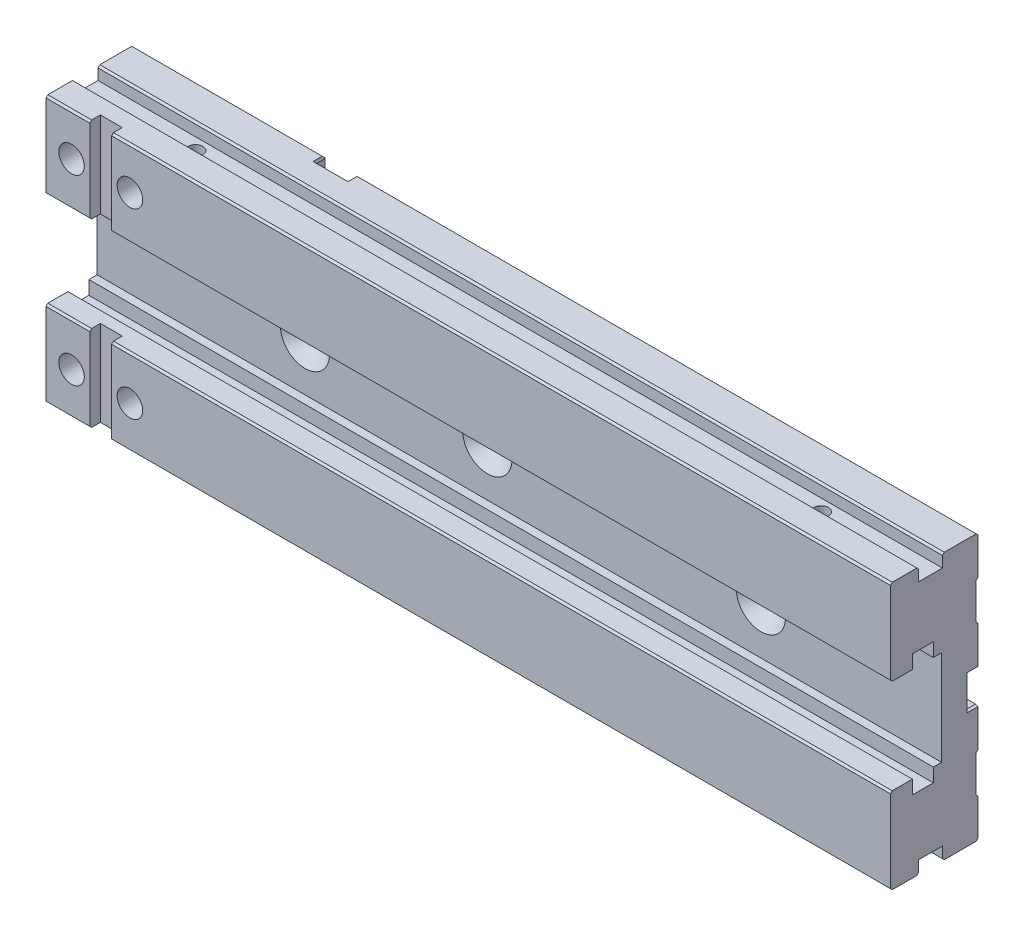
ISO-10303-21;
HEADER;
FILE_DESCRIPTION(('STEP AP214'),'2;1');
FILE_NAME('part.step','',(''),(''),'','','');
FILE_SCHEMA(('AUTOMOTIVE_DESIGN { 1 0 10303 214 1 1 1 1 }'));
ENDSEC;
DATA;
#1=APPLICATION_CONTEXT('core data for automotive mechanical design processes');
#2=APPLICATION_PROTOCOL_DEFINITION('international standard','automotive_design',2000,#1);
#3=PRODUCT_CONTEXT('',#1,'mechanical');
#4=PRODUCT('Part','Part','',(#3));
#5=PRODUCT_RELATED_PRODUCT_CATEGORY('part','',(#4));
#6=PRODUCT_DEFINITION_FORMATION('','',#4);
#7=PRODUCT_DEFINITION_CONTEXT('part definition',#1,'design');
#8=PRODUCT_DEFINITION('design','',#6,#7);
#9=PRODUCT_DEFINITION_SHAPE('','',#8);
#10=(LENGTH_UNIT() NAMED_UNIT(*) SI_UNIT(.MILLI.,.METRE.));
#11=(NAMED_UNIT(*) PLANE_ANGLE_UNIT() SI_UNIT($,.RADIAN.));
#12=(NAMED_UNIT(*) SI_UNIT($,.STERADIAN.) SOLID_ANGLE_UNIT());
#13=UNCERTAINTY_MEASURE_WITH_UNIT(LENGTH_MEASURE(1.E-05),#10,'distance_accuracy_value','');
#14=(GEOMETRIC_REPRESENTATION_CONTEXT(3) GLOBAL_UNCERTAINTY_ASSIGNED_CONTEXT((#13)) GLOBAL_UNIT_ASSIGNED_CONTEXT((#10,
#11,#12)) REPRESENTATION_CONTEXT('',''));
#15=CARTESIAN_POINT('',(0.,0.,0.));
#16=DIRECTION('',(0.,0.,1.));
#17=DIRECTION('',(1.,0.,0.));
#18=AXIS2_PLACEMENT_3D('',#15,#16,#17);
#19=CARTESIAN_POINT('',(349.,3.5,5.5));
#20=DIRECTION('',(0.,1.,0.));
#21=DIRECTION('',(-1.,0.,0.));
#22=AXIS2_PLACEMENT_3D('',#19,#20,#21);
#23=PLANE('',#22);
#24=DIRECTION('',(0.,0.,1.));
#25=VECTOR('',#24,1.);
#26=CARTESIAN_POINT('',(316.367496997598,3.5,5.5));
#27=LINE('',#26,#25);
#28=CARTESIAN_POINT('',(316.367496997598,3.5,5.));
#29=VERTEX_POINT('',#28);
#30=CARTESIAN_POINT('',(316.367496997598,3.5,5.5));
#31=VERTEX_POINT('',#30);
#32=EDGE_CURVE('E578',#29,#31,#27,.T.);
#33=ORIENTED_EDGE('',*,*,#32,.F.);
#34=DIRECTION('',(1.,0.,0.));
#35=VECTOR('',#34,1.);
#36=CARTESIAN_POINT('',(349.,3.5,5.));
#37=LINE('',#36,#35);
#38=CARTESIAN_POINT('',(342.632503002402,3.5,5.));
#39=VERTEX_POINT('',#38);
#40=EDGE_CURVE('E1339',#29,#39,#37,.T.);
#41=ORIENTED_EDGE('',*,*,#40,.T.);
#42=DIRECTION('',(0.,0.,1.));
#43=VECTOR('',#42,1.);
#44=CARTESIAN_POINT('',(342.632503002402,3.5,5.5));
#45=LINE('',#44,#43);
#46=CARTESIAN_POINT('',(342.632503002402,3.5,5.5));
#47=VERTEX_POINT('',#46);
#48=EDGE_CURVE('E580',#47,#39,#45,.F.);
#49=ORIENTED_EDGE('',*,*,#48,.F.);
#50=DIRECTION('',(1.,0.,0.));
#51=VECTOR('',#50,1.);
#52=CARTESIAN_POINT('',(349.,3.5,5.5));
#53=LINE('',#52,#51);
#54=EDGE_CURVE('E1336',#47,#31,#53,.F.);
#55=ORIENTED_EDGE('',*,*,#54,.T.);
#56=EDGE_LOOP('',(#33,#41,#49,#55));
#57=FACE_BOUND('',#56,.T.);
#58=ADVANCED_FACE('F14',(#57),#23,.F.);
#59=CARTESIAN_POINT('',(349.,-3.5,5.5));
#60=DIRECTION('',(0.,-1.,0.));
#61=DIRECTION('',(1.,0.,0.));
#62=AXIS2_PLACEMENT_3D('',#59,#60,#61);
#63=PLANE('',#62);
#64=DIRECTION('',(0.,0.,1.));
#65=VECTOR('',#64,1.);
#66=CARTESIAN_POINT('',(316.367496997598,-3.5,5.5));
#67=LINE('',#66,#65);
#68=CARTESIAN_POINT('',(316.367496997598,-3.5,5.5));
#69=VERTEX_POINT('',#68);
#70=CARTESIAN_POINT('',(316.367496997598,-3.5,5.));
#71=VERTEX_POINT('',#70);
#72=EDGE_CURVE('E543',#69,#71,#67,.F.);
#73=ORIENTED_EDGE('',*,*,#72,.F.);
#74=DIRECTION('',(1.,0.,0.));
#75=VECTOR('',#74,1.);
#76=CARTESIAN_POINT('',(349.,-3.5,5.5));
#77=LINE('',#76,#75);
#78=CARTESIAN_POINT('',(342.632503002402,-3.5,5.5));
#79=VERTEX_POINT('',#78);
#80=EDGE_CURVE('E1333',#69,#79,#77,.T.);
#81=ORIENTED_EDGE('',*,*,#80,.T.);
#82=DIRECTION('',(0.,0.,1.));
#83=VECTOR('',#82,1.);
#84=CARTESIAN_POINT('',(342.632503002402,-3.5,5.5));
#85=LINE('',#84,#83);
#86=CARTESIAN_POINT('',(342.632503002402,-3.5,5.));
#87=VERTEX_POINT('',#86);
#88=EDGE_CURVE('E576',#87,#79,#85,.T.);
#89=ORIENTED_EDGE('',*,*,#88,.F.);
#90=DIRECTION('',(1.,0.,0.));
#91=VECTOR('',#90,1.);
#92=CARTESIAN_POINT('',(349.,-3.5,5.));
#93=LINE('',#92,#91);
#94=EDGE_CURVE('E755',#87,#71,#93,.F.);
#95=ORIENTED_EDGE('',*,*,#94,.T.);
#96=EDGE_LOOP('',(#73,#81,#89,#95));
#97=FACE_BOUND('',#96,.T.);
#98=ADVANCED_FACE('F1732',(#97),#63,.F.);
#99=CARTESIAN_POINT('',(-114.,51.,0.999999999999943));
#100=DIRECTION('',(0.,0.707106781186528,0.707106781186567));
#101=DIRECTION('',(0.,-0.707106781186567,0.707106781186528));
#102=AXIS2_PLACEMENT_3D('',#99,#100,#101);
#103=PLANE('',#102);
#104=DIRECTION('',(1.,0.,0.));
#105=VECTOR('',#104,1.);
#106=CARTESIAN_POINT('',(-114.,52.,0.));
#107=LINE('',#106,#105);
#108=CARTESIAN_POINT('',(349.,52.,0.));
#109=VERTEX_POINT('',#108);
#110=CARTESIAN_POINT('',(9.,52.,0.));
#111=VERTEX_POINT('',#110);
#112=EDGE_CURVE('E565',#109,#111,#107,.F.);
#113=ORIENTED_EDGE('',*,*,#112,.F.);
#114=DIRECTION('',(0.,-0.707106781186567,0.707106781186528));
#115=VECTOR('',#114,1.);
#116=CARTESIAN_POINT('',(349.,51.,0.999999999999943));
#117=LINE('',#116,#115);
#118=CARTESIAN_POINT('',(349.,51.,0.999999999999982));
#119=VERTEX_POINT('',#118);
#120=EDGE_CURVE('E517',#119,#109,#117,.F.);
#121=ORIENTED_EDGE('',*,*,#120,.F.);
#122=DIRECTION('',(1.,0.,0.));
#123=VECTOR('',#122,1.);
#124=CARTESIAN_POINT('',(-114.,51.,1.));
#125=LINE('',#124,#123);
#126=CARTESIAN_POINT('',(9.,51.,1.));
#127=VERTEX_POINT('',#126);
#128=EDGE_CURVE('E551',#127,#119,#125,.T.);
#129=ORIENTED_EDGE('',*,*,#128,.F.);
#130=DIRECTION('',(0.,0.707106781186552,-0.707106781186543));
#131=VECTOR('',#130,1.);
#132=CARTESIAN_POINT('',(9.,51.,1.));
#133=LINE('',#132,#131);
#134=EDGE_CURVE('E544',#127,#111,#133,.T.);
#135=ORIENTED_EDGE('',*,*,#134,.T.);
#136=EDGE_LOOP('',(#113,#121,#129,#135));
#137=FACE_BOUND('',#136,.T.);
#138=ADVANCED_FACE('F2772',(#137),#103,.F.);
#139=CARTESIAN_POINT('',(-114.,-52.,0.));
#140=DIRECTION('',(0.,-0.707106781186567,0.707106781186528));
#141=DIRECTION('',(0.,-0.707106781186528,-0.707106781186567));
#142=AXIS2_PLACEMENT_3D('',#139,#140,#141);
#143=PLANE('',#142);
#144=DIRECTION('',(1.,0.,0.));
#145=VECTOR('',#144,1.);
#146=CARTESIAN_POINT('',(-114.,-51.,1.));
#147=LINE('',#146,#145);
#148=CARTESIAN_POINT('',(349.,-51.,1.));
#149=VERTEX_POINT('',#148);
#150=CARTESIAN_POINT('',(9.,-51.,1.));
#151=VERTEX_POINT('',#150);
#152=EDGE_CURVE('E415',#149,#151,#147,.F.);
#153=ORIENTED_EDGE('',*,*,#152,.F.);
#154=DIRECTION('',(0.,-0.707106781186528,-0.707106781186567));
#155=VECTOR('',#154,1.);
#156=CARTESIAN_POINT('',(349.,-52.,0.));
#157=LINE('',#156,#155);
#158=CARTESIAN_POINT('',(349.,-52.,0.));
#159=VERTEX_POINT('',#158);
#160=EDGE_CURVE('E512',#159,#149,#157,.F.);
#161=ORIENTED_EDGE('',*,*,#160,.F.);
#162=DIRECTION('',(1.,0.,0.));
#163=VECTOR('',#162,1.);
#164=CARTESIAN_POINT('',(-114.,-52.,0.));
#165=LINE('',#164,#163);
#166=CARTESIAN_POINT('',(9.,-52.,0.));
#167=VERTEX_POINT('',#166);
#168=EDGE_CURVE('E534',#167,#159,#165,.T.);
#169=ORIENTED_EDGE('',*,*,#168,.F.);
#170=DIRECTION('',(0.,0.707106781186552,0.707106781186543));
#171=VECTOR('',#170,1.);
#172=CARTESIAN_POINT('',(9.,-52.,0.));
#173=LINE('',#172,#171);
#174=EDGE_CURVE('E520',#167,#151,#173,.T.);
#175=ORIENTED_EDGE('',*,*,#174,.T.);
#176=EDGE_LOOP('',(#153,#161,#169,#175));
#177=FACE_BOUND('',#176,.T.);
#178=ADVANCED_FACE('F2763',(#177),#143,.F.);
#179=CARTESIAN_POINT('',(3.5,-73.,5.5));
#180=DIRECTION('',(1.,0.,0.));
#181=DIRECTION('',(0.,1.,0.));
#182=AXIS2_PLACEMENT_3D('',#179,#180,#181);
#183=PLANE('',#182);
#184=DIRECTION('',(0.,0.,1.));
#185=VECTOR('',#184,1.);
#186=CARTESIAN_POINT('',(3.5,-40.3674969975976,5.5));
#187=LINE('',#186,#185);
#188=CARTESIAN_POINT('',(3.5,-40.3674969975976,5.));
#189=VERTEX_POINT('',#188);
#190=CARTESIAN_POINT('',(3.5,-40.3674969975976,5.5));
#191=VERTEX_POINT('',#190);
#192=EDGE_CURVE('E509',#189,#191,#187,.T.);
#193=ORIENTED_EDGE('',*,*,#192,.F.);
#194=DIRECTION('',(0.,-1.,0.));
#195=VECTOR('',#194,1.);
#196=CARTESIAN_POINT('',(3.5,-73.,5.));
#197=LINE('',#196,#195);
#198=CARTESIAN_POINT('',(3.5,-66.6325030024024,5.));
#199=VERTEX_POINT('',#198);
#200=EDGE_CURVE('E554',#189,#199,#197,.T.);
#201=ORIENTED_EDGE('',*,*,#200,.T.);
#202=DIRECTION('',(0.,0.,-1.));
#203=VECTOR('',#202,1.);
#204=CARTESIAN_POINT('',(3.5,-66.6325030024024,5.99999999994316));
#205=LINE('',#204,#203);
#206=CARTESIAN_POINT('',(3.5,-66.6325030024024,5.5));
#207=VERTEX_POINT('',#206);
#208=EDGE_CURVE('E346',#199,#207,#205,.F.);
#209=ORIENTED_EDGE('',*,*,#208,.T.);
#210=DIRECTION('',(0.,-1.,0.));
#211=VECTOR('',#210,1.);
#212=CARTESIAN_POINT('',(3.5,-73.,5.5));
#213=LINE('',#212,#211);
#214=EDGE_CURVE('E728',#207,#191,#213,.F.);
#215=ORIENTED_EDGE('',*,*,#214,.T.);
#216=EDGE_LOOP('',(#193,#201,#209,#215));
#217=FACE_BOUND('',#216,.T.);
#218=ADVANCED_FACE('F2754',(#217),#183,.F.);
#219=CARTESIAN_POINT('',(-3.5,-73.,5.5));
#220=DIRECTION('',(-1.,0.,0.));
#221=DIRECTION('',(0.,-1.,0.));
#222=AXIS2_PLACEMENT_3D('',#219,#220,#221);
#223=PLANE('',#222);
#224=DIRECTION('',(0.,0.,1.));
#225=VECTOR('',#224,1.);
#226=CARTESIAN_POINT('',(-3.5,-40.3674969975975,5.5));
#227=LINE('',#226,#225);
#228=CARTESIAN_POINT('',(-3.5,-40.3674969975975,5.5));
#229=VERTEX_POINT('',#228);
#230=CARTESIAN_POINT('',(-3.5,-40.3674969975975,5.));
#231=VERTEX_POINT('',#230);
#232=EDGE_CURVE('E507',#229,#231,#227,.F.);
#233=ORIENTED_EDGE('',*,*,#232,.F.);
#234=DIRECTION('',(0.,-1.,0.));
#235=VECTOR('',#234,1.);
#236=CARTESIAN_POINT('',(-3.5,-73.,5.5));
#237=LINE('',#236,#235);
#238=CARTESIAN_POINT('',(-3.5,-66.6325030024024,5.5));
#239=VERTEX_POINT('',#238);
#240=EDGE_CURVE('E1266',#229,#239,#237,.T.);
#241=ORIENTED_EDGE('',*,*,#240,.T.);
#242=DIRECTION('',(0.,0.,-1.));
#243=VECTOR('',#242,1.);
#244=CARTESIAN_POINT('',(-3.5,-66.6325030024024,5.99999999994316));
#245=LINE('',#244,#243);
#246=CARTESIAN_POINT('',(-3.5,-66.6325030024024,5.));
#247=VERTEX_POINT('',#246);
#248=EDGE_CURVE('E405',#239,#247,#245,.T.);
#249=ORIENTED_EDGE('',*,*,#248,.T.);
#250=DIRECTION('',(0.,-1.,0.));
#251=VECTOR('',#250,1.);
#252=CARTESIAN_POINT('',(-3.5,-73.,5.));
#253=LINE('',#252,#251);
#254=EDGE_CURVE('E729',#247,#231,#253,.F.);
#255=ORIENTED_EDGE('',*,*,#254,.T.);
#256=EDGE_LOOP('',(#233,#241,#249,#255));
#257=FACE_BOUND('',#256,.T.);
#258=ADVANCED_FACE('F2745',(#257),#223,.F.);
#259=CARTESIAN_POINT('',(-75.,-3.5,5.5));
#260=DIRECTION('',(0.,-1.,0.));
#261=DIRECTION('',(1.,0.,0.));
#262=AXIS2_PLACEMENT_3D('',#259,#260,#261);
#263=PLANE('',#262);
#264=DIRECTION('',(0.,0.,1.));
#265=VECTOR('',#264,1.);
#266=CARTESIAN_POINT('',(-107.632503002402,-3.5,5.5));
#267=LINE('',#266,#265);
#268=CARTESIAN_POINT('',(-107.632503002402,-3.5,5.5));
#269=VERTEX_POINT('',#268);
#270=CARTESIAN_POINT('',(-107.632503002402,-3.5,5.));
#271=VERTEX_POINT('',#270);
#272=EDGE_CURVE('E502',#269,#271,#267,.F.);
#273=ORIENTED_EDGE('',*,*,#272,.F.);
#274=DIRECTION('',(1.,0.,0.));
#275=VECTOR('',#274,1.);
#276=CARTESIAN_POINT('',(-75.,-3.5,5.5));
#277=LINE('',#276,#275);
#278=CARTESIAN_POINT('',(-81.3674969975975,-3.5,5.5));
#279=VERTEX_POINT('',#278);
#280=EDGE_CURVE('E1254',#269,#279,#277,.T.);
#281=ORIENTED_EDGE('',*,*,#280,.T.);
#282=DIRECTION('',(0.,0.,1.));
#283=VECTOR('',#282,1.);
#284=CARTESIAN_POINT('',(-81.3674969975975,-3.5,5.5));
#285=LINE('',#284,#283);
#286=CARTESIAN_POINT('',(-81.3674969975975,-3.5,5.));
#287=VERTEX_POINT('',#286);
#288=EDGE_CURVE('E504',#287,#279,#285,.T.);
#289=ORIENTED_EDGE('',*,*,#288,.F.);
#290=DIRECTION('',(1.,0.,0.));
#291=VECTOR('',#290,1.);
#292=CARTESIAN_POINT('',(-75.,-3.5,5.));
#293=LINE('',#292,#291);
#294=EDGE_CURVE('E1262',#287,#271,#293,.F.);
#295=ORIENTED_EDGE('',*,*,#294,.T.);
#296=EDGE_LOOP('',(#273,#281,#289,#295));
#297=FACE_BOUND('',#296,.T.);
#298=ADVANCED_FACE('F2736',(#297),#263,.F.);
#299=CARTESIAN_POINT('',(-75.,3.5,5.5));
#300=DIRECTION('',(0.,1.,0.));
#301=DIRECTION('',(-1.,0.,0.));
#302=AXIS2_PLACEMENT_3D('',#299,#300,#301);
#303=PLANE('',#302);
#304=DIRECTION('',(0.,0.,1.));
#305=VECTOR('',#304,1.);
#306=CARTESIAN_POINT('',(-107.632503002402,3.5,5.5));
#307=LINE('',#306,#305);
#308=CARTESIAN_POINT('',(-107.632503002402,3.5,5.));
#309=VERTEX_POINT('',#308);
#310=CARTESIAN_POINT('',(-107.632503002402,3.5,5.5));
#311=VERTEX_POINT('',#310);
#312=EDGE_CURVE('E498',#309,#311,#307,.T.);
#313=ORIENTED_EDGE('',*,*,#312,.F.);
#314=DIRECTION('',(1.,0.,0.));
#315=VECTOR('',#314,1.);
#316=CARTESIAN_POINT('',(-75.,3.5,5.));
#317=LINE('',#316,#315);
#318=CARTESIAN_POINT('',(-81.3674969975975,3.5,5.));
#319=VERTEX_POINT('',#318);
#320=EDGE_CURVE('E1251',#309,#319,#317,.T.);
#321=ORIENTED_EDGE('',*,*,#320,.T.);
#322=DIRECTION('',(0.,0.,1.));
#323=VECTOR('',#322,1.);
#324=CARTESIAN_POINT('',(-81.3674969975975,3.5,5.5));
#325=LINE('',#324,#323);
#326=CARTESIAN_POINT('',(-81.3674969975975,3.5,5.5));
#327=VERTEX_POINT('',#326);
#328=EDGE_CURVE('E500',#327,#319,#325,.F.);
#329=ORIENTED_EDGE('',*,*,#328,.F.);
#330=DIRECTION('',(1.,0.,0.));
#331=VECTOR('',#330,1.);
#332=CARTESIAN_POINT('',(-75.,3.5,5.5));
#333=LINE('',#332,#331);
#334=EDGE_CURVE('E1259',#327,#311,#333,.F.);
#335=ORIENTED_EDGE('',*,*,#334,.T.);
#336=EDGE_LOOP('',(#313,#321,#329,#335));
#337=FACE_BOUND('',#336,.T.);
#338=ADVANCED_FACE('F2727',(#337),#303,.F.);
#339=CARTESIAN_POINT('',(-114.,73.,47.));
#340=DIRECTION('',(0.,-0.707106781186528,-0.707106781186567));
#341=DIRECTION('',(0.,0.707106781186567,-0.707106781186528));
#342=AXIS2_PLACEMENT_3D('',#339,#340,#341);
#343=PLANE('',#342);
#344=DIRECTION('',(1.,0.,0.));
#345=VECTOR('',#344,1.);
#346=CARTESIAN_POINT('',(-114.,72.,48.));
#347=LINE('',#346,#345);
#348=CARTESIAN_POINT('',(-90.,72.,48.));
#349=VERTEX_POINT('',#348);
#350=CARTESIAN_POINT('',(-114.,72.,48.));
#351=VERTEX_POINT('',#350);
#352=EDGE_CURVE('E1245',#349,#351,#347,.F.);
#353=ORIENTED_EDGE('',*,*,#352,.F.);
#354=DIRECTION('',(0.,0.707106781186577,-0.707106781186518));
#355=VECTOR('',#354,1.);
#356=CARTESIAN_POINT('',(-90.,72.,48.));
#357=LINE('',#356,#355);
#358=CARTESIAN_POINT('',(-90.,73.,47.));
#359=VERTEX_POINT('',#358);
#360=EDGE_CURVE('E792',#349,#359,#357,.T.);
#361=ORIENTED_EDGE('',*,*,#360,.T.);
#362=DIRECTION('',(-1.,0.,0.));
#363=VECTOR('',#362,1.);
#364=CARTESIAN_POINT('',(-114.,73.,47.));
#365=LINE('',#364,#363);
#366=CARTESIAN_POINT('',(-114.,73.,47.));
#367=VERTEX_POINT('',#366);
#368=EDGE_CURVE('E1239',#367,#359,#365,.F.);
#369=ORIENTED_EDGE('',*,*,#368,.F.);
#370=DIRECTION('',(0.,0.707106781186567,-0.707106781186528));
#371=VECTOR('',#370,1.);
#372=CARTESIAN_POINT('',(-114.,73.,47.));
#373=LINE('',#372,#371);
#374=EDGE_CURVE('E495',#351,#367,#373,.T.);
#375=ORIENTED_EDGE('',*,*,#374,.F.);
#376=EDGE_LOOP('',(#353,#361,#369,#375));
#377=FACE_BOUND('',#376,.T.);
#378=ADVANCED_FACE('F2718',(#377),#343,.F.);
#379=CARTESIAN_POINT('',(-114.,73.,47.));
#380=DIRECTION('',(0.,-0.707106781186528,-0.707106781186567));
#381=DIRECTION('',(0.,0.707106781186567,-0.707106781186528));
#382=AXIS2_PLACEMENT_3D('',#379,#380,#381);
#383=PLANE('',#382);
#384=DIRECTION('',(1.,0.,0.));
#385=VECTOR('',#384,1.);
#386=CARTESIAN_POINT('',(-114.,72.,48.));
#387=LINE('',#386,#385);
#388=CARTESIAN_POINT('',(349.,72.,48.));
#389=VERTEX_POINT('',#388);
#390=CARTESIAN_POINT('',(-78.,72.,48.));
#391=VERTEX_POINT('',#390);
#392=EDGE_CURVE('E1299',#389,#391,#387,.F.);
#393=ORIENTED_EDGE('',*,*,#392,.F.);
#394=DIRECTION('',(0.,0.707106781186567,-0.707106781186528));
#395=VECTOR('',#394,1.);
#396=CARTESIAN_POINT('',(349.,73.,47.));
#397=LINE('',#396,#395);
#398=CARTESIAN_POINT('',(349.,73.,47.));
#399=VERTEX_POINT('',#398);
#400=EDGE_CURVE('E492',#399,#389,#397,.F.);
#401=ORIENTED_EDGE('',*,*,#400,.F.);
#402=DIRECTION('',(-1.,0.,0.));
#403=VECTOR('',#402,1.);
#404=CARTESIAN_POINT('',(-114.,73.,47.));
#405=LINE('',#404,#403);
#406=CARTESIAN_POINT('',(-78.,73.,47.));
#407=VERTEX_POINT('',#406);
#408=EDGE_CURVE('E1227',#407,#399,#405,.F.);
#409=ORIENTED_EDGE('',*,*,#408,.F.);
#410=DIRECTION('',(0.,-0.707106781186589,0.707106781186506));
#411=VECTOR('',#410,1.);
#412=CARTESIAN_POINT('',(-78.,73.,47.));
#413=LINE('',#412,#411);
#414=EDGE_CURVE('E1381',#407,#391,#413,.T.);
#415=ORIENTED_EDGE('',*,*,#414,.T.);
#416=EDGE_LOOP('',(#393,#401,#409,#415));
#417=FACE_BOUND('',#416,.T.);
#418=ADVANCED_FACE('F2709',(#417),#383,.F.);
#419=CARTESIAN_POINT('',(-114.,72.,32.5));
#420=DIRECTION('',(0.,-0.707106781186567,0.707106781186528));
#421=DIRECTION('',(0.,-0.707106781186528,-0.707106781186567));
#422=AXIS2_PLACEMENT_3D('',#419,#420,#421);
#423=PLANE('',#422);
#424=DIRECTION('',(-1.,0.,0.));
#425=VECTOR('',#424,1.);
#426=CARTESIAN_POINT('',(-114.,73.,33.5));
#427=LINE('',#426,#425);
#428=CARTESIAN_POINT('',(349.,73.,33.5));
#429=VERTEX_POINT('',#428);
#430=CARTESIAN_POINT('',(-114.,73.,33.5));
#431=VERTEX_POINT('',#430);
#432=EDGE_CURVE('E1224',#429,#431,#427,.T.);
#433=ORIENTED_EDGE('',*,*,#432,.F.);
#434=DIRECTION('',(0.,-0.707106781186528,-0.707106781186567));
#435=VECTOR('',#434,1.);
#436=CARTESIAN_POINT('',(349.,72.,32.5));
#437=LINE('',#436,#435);
#438=CARTESIAN_POINT('',(349.,72.,32.5));
#439=VERTEX_POINT('',#438);
#440=EDGE_CURVE('E489',#439,#429,#437,.F.);
#441=ORIENTED_EDGE('',*,*,#440,.F.);
#442=DIRECTION('',(-1.,0.,0.));
#443=VECTOR('',#442,1.);
#444=CARTESIAN_POINT('',(-114.,72.,32.5));
#445=LINE('',#444,#443);
#446=CARTESIAN_POINT('',(-114.,72.,32.5));
#447=VERTEX_POINT('',#446);
#448=EDGE_CURVE('E1221',#447,#439,#445,.F.);
#449=ORIENTED_EDGE('',*,*,#448,.F.);
#450=DIRECTION('',(0.,-0.707106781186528,-0.707106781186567));
#451=VECTOR('',#450,1.);
#452=CARTESIAN_POINT('',(-114.,72.,32.5));
#453=LINE('',#452,#451);
#454=EDGE_CURVE('E471',#431,#447,#453,.T.);
#455=ORIENTED_EDGE('',*,*,#454,.F.);
#456=EDGE_LOOP('',(#433,#441,#449,#455));
#457=FACE_BOUND('',#456,.T.);
#458=ADVANCED_FACE('F2700',(#457),#423,.F.);
#459=CARTESIAN_POINT('',(0.,76.,5.99999999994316));
#460=DIRECTION('',(0.,0.,-1.));
#461=DIRECTION('',(0.,1.,0.));
#462=AXIS2_PLACEMENT_3D('',#459,#460,#461);
#463=PLANE('',#462);
#464=CARTESIAN_POINT('',(0.,76.,5.99999999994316));
#465=DIRECTION('',(0.,0.,-1.));
#466=DIRECTION('',(0.,1.,0.));
#467=AXIS2_PLACEMENT_3D('',#464,#465,#466);
#468=CIRCLE('',#467,10.);
#469=CARTESIAN_POINT('',(9.53939201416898,73.,5.99999999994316));
#470=VERTEX_POINT('',#469);
#471=CARTESIAN_POINT('',(-9.53939201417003,73.,5.99999999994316));
#472=VERTEX_POINT('',#471);
#473=EDGE_CURVE('E763',#470,#472,#468,.T.);
#474=ORIENTED_EDGE('',*,*,#473,.T.);
#475=DIRECTION('',(-1.,0.,0.));
#476=VECTOR('',#475,1.);
#477=CARTESIAN_POINT('',(-114.,73.,5.99999999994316));
#478=LINE('',#477,#476);
#479=EDGE_CURVE('E445',#470,#472,#478,.T.);
#480=ORIENTED_EDGE('',*,*,#479,.F.);
#481=EDGE_LOOP('',(#474,#480));
#482=FACE_BOUND('',#481,.T.);
#483=ADVANCED_FACE('F2691',(#482),#463,.T.);
#484=CARTESIAN_POINT('',(-114.,73.,18.5));
#485=DIRECTION('',(0.,-0.707106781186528,-0.707106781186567));
#486=DIRECTION('',(0.,0.707106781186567,-0.707106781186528));
#487=AXIS2_PLACEMENT_3D('',#484,#485,#486);
#488=PLANE('',#487);
#489=DIRECTION('',(1.,0.,0.));
#490=VECTOR('',#489,1.);
#491=CARTESIAN_POINT('',(-114.,72.,19.5));
#492=LINE('',#491,#490);
#493=CARTESIAN_POINT('',(349.,72.,19.5));
#494=VERTEX_POINT('',#493);
#495=CARTESIAN_POINT('',(-114.,72.,19.5));
#496=VERTEX_POINT('',#495);
#497=EDGE_CURVE('E1215',#494,#496,#492,.F.);
#498=ORIENTED_EDGE('',*,*,#497,.F.);
#499=DIRECTION('',(0.,0.707106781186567,-0.707106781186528));
#500=VECTOR('',#499,1.);
#501=CARTESIAN_POINT('',(349.,73.,18.5));
#502=LINE('',#501,#500);
#503=CARTESIAN_POINT('',(349.,73.,18.5));
#504=VERTEX_POINT('',#503);
#505=EDGE_CURVE('E468',#504,#494,#502,.F.);
#506=ORIENTED_EDGE('',*,*,#505,.F.);
#507=DIRECTION('',(-1.,0.,0.));
#508=VECTOR('',#507,1.);
#509=CARTESIAN_POINT('',(-114.,73.,18.5));
#510=LINE('',#509,#508);
#511=CARTESIAN_POINT('',(-114.,73.,18.5));
#512=VERTEX_POINT('',#511);
#513=EDGE_CURVE('E451',#512,#504,#510,.F.);
#514=ORIENTED_EDGE('',*,*,#513,.F.);
#515=DIRECTION('',(0.,0.707106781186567,-0.707106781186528));
#516=VECTOR('',#515,1.);
#517=CARTESIAN_POINT('',(-114.,73.,18.5));
#518=LINE('',#517,#516);
#519=EDGE_CURVE('E456',#496,#512,#518,.T.);
#520=ORIENTED_EDGE('',*,*,#519,.F.);
#521=EDGE_LOOP('',(#498,#506,#514,#520));
#522=FACE_BOUND('',#521,.T.);
#523=ADVANCED_FACE('F2682',(#522),#488,.F.);
#524=CARTESIAN_POINT('',(-114.,72.,0.));
#525=DIRECTION('',(0.,-0.707106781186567,0.707106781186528));
#526=DIRECTION('',(0.,-0.707106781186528,-0.707106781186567));
#527=AXIS2_PLACEMENT_3D('',#524,#525,#526);
#528=PLANE('',#527);
#529=DIRECTION('',(-1.,0.,0.));
#530=VECTOR('',#529,1.);
#531=CARTESIAN_POINT('',(-114.,73.,1.00000000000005));
#532=LINE('',#531,#530);
#533=CARTESIAN_POINT('',(349.,73.,1.00000000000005));
#534=VERTEX_POINT('',#533);
#535=CARTESIAN_POINT('',(9.53939201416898,73.,1.00000000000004));
#536=VERTEX_POINT('',#535);
#537=EDGE_CURVE('E447',#534,#536,#532,.T.);
#538=ORIENTED_EDGE('',*,*,#537,.F.);
#539=DIRECTION('',(0.,-0.707106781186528,-0.707106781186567));
#540=VECTOR('',#539,1.);
#541=CARTESIAN_POINT('',(349.,72.,0.));
#542=LINE('',#541,#540);
#543=CARTESIAN_POINT('',(349.,71.9999999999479,-1.89533771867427E-11));
#544=VERTEX_POINT('',#543);
#545=EDGE_CURVE('E432',#544,#534,#542,.F.);
#546=ORIENTED_EDGE('',*,*,#545,.F.);
#547=DIRECTION('',(1.,0.,0.));
#548=VECTOR('',#547,1.);
#549=CARTESIAN_POINT('',(-114.,71.9999999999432,0.));
#550=LINE('',#549,#548);
#551=CARTESIAN_POINT('',(9.16515138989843,71.9999999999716,0.));
#552=VERTEX_POINT('',#551);
#553=EDGE_CURVE('E568',#552,#544,#550,.T.);
#554=ORIENTED_EDGE('',*,*,#553,.F.);
#555=CARTESIAN_POINT('',(0.,76.,4.00000000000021));
#556=DIRECTION('',(0.,-0.707106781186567,0.707106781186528));
#557=DIRECTION('',(0.,-0.707106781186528,-0.707106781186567));
#558=AXIS2_PLACEMENT_3D('',#555,#556,#557);
#559=ELLIPSE('',#558,14.1421356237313,10.);
#560=EDGE_CURVE('E765',#552,#536,#559,.T.);
#561=ORIENTED_EDGE('',*,*,#560,.T.);
#562=EDGE_LOOP('',(#538,#546,#554,#561));
#563=FACE_BOUND('',#562,.T.);
#564=ADVANCED_FACE('F2673',(#563),#528,.F.);
#565=CARTESIAN_POINT('',(-114.,72.,0.));
#566=DIRECTION('',(0.,-0.707106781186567,0.707106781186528));
#567=DIRECTION('',(0.,-0.707106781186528,-0.707106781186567));
#568=AXIS2_PLACEMENT_3D('',#565,#566,#567);
#569=PLANE('',#568);
#570=DIRECTION('',(1.,0.,0.));
#571=VECTOR('',#570,1.);
#572=CARTESIAN_POINT('',(-114.,72.,0.));
#573=LINE('',#572,#571);
#574=CARTESIAN_POINT('',(-114.,72.,0.));
#575=VERTEX_POINT('',#574);
#576=CARTESIAN_POINT('',(-9.16515138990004,71.9999999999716,-2.84244255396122E-11));
#577=VERTEX_POINT('',#576);
#578=EDGE_CURVE('E724',#575,#577,#573,.T.);
#579=ORIENTED_EDGE('',*,*,#578,.F.);
#580=DIRECTION('',(0.,-0.707106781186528,-0.707106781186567));
#581=VECTOR('',#580,1.);
#582=CARTESIAN_POINT('',(-114.,72.,0.));
#583=LINE('',#582,#581);
#584=CARTESIAN_POINT('',(-114.,73.,1.00000000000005));
#585=VERTEX_POINT('',#584);
#586=EDGE_CURVE('E406',#585,#575,#583,.T.);
#587=ORIENTED_EDGE('',*,*,#586,.F.);
#588=DIRECTION('',(-1.,0.,0.));
#589=VECTOR('',#588,1.);
#590=CARTESIAN_POINT('',(-114.,73.,1.00000000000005));
#591=LINE('',#590,#589);
#592=CARTESIAN_POINT('',(-9.53939201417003,73.,1.00000000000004));
#593=VERTEX_POINT('',#592);
#594=EDGE_CURVE('E475',#593,#585,#591,.T.);
#595=ORIENTED_EDGE('',*,*,#594,.F.);
#596=CARTESIAN_POINT('',(0.,76.,4.00000000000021));
#597=DIRECTION('',(0.,-0.707106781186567,0.707106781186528));
#598=DIRECTION('',(0.,-0.707106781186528,-0.707106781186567));
#599=AXIS2_PLACEMENT_3D('',#596,#597,#598);
#600=ELLIPSE('',#599,14.1421356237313,10.);
#601=EDGE_CURVE('E760',#593,#577,#600,.T.);
#602=ORIENTED_EDGE('',*,*,#601,.T.);
#603=EDGE_LOOP('',(#579,#587,#595,#602));
#604=FACE_BOUND('',#603,.T.);
#605=ADVANCED_FACE('F2664',(#604),#569,.F.);
#606=CARTESIAN_POINT('',(-114.,-52.,0.));
#607=DIRECTION('',(0.,-0.707106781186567,0.707106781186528));
#608=DIRECTION('',(0.,-0.707106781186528,-0.707106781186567));
#609=AXIS2_PLACEMENT_3D('',#606,#607,#608);
#610=PLANE('',#609);
#611=DIRECTION('',(1.,0.,0.));
#612=VECTOR('',#611,1.);
#613=CARTESIAN_POINT('',(-114.,-52.,0.));
#614=LINE('',#613,#612);
#615=CARTESIAN_POINT('',(-114.,-52.,0.));
#616=VERTEX_POINT('',#615);
#617=CARTESIAN_POINT('',(-9.,-52.,0.));
#618=VERTEX_POINT('',#617);
#619=EDGE_CURVE('E357',#616,#618,#614,.T.);
#620=ORIENTED_EDGE('',*,*,#619,.F.);
#621=DIRECTION('',(0.,-0.707106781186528,-0.707106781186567));
#622=VECTOR('',#621,1.);
#623=CARTESIAN_POINT('',(-114.,-52.,0.));
#624=LINE('',#623,#622);
#625=CARTESIAN_POINT('',(-114.,-51.,1.00000000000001));
#626=VERTEX_POINT('',#625);
#627=EDGE_CURVE('E402',#626,#616,#624,.T.);
#628=ORIENTED_EDGE('',*,*,#627,.F.);
#629=DIRECTION('',(1.,0.,0.));
#630=VECTOR('',#629,1.);
#631=CARTESIAN_POINT('',(-114.,-51.,1.));
#632=LINE('',#631,#630);
#633=CARTESIAN_POINT('',(-9.,-51.,1.));
#634=VERTEX_POINT('',#633);
#635=EDGE_CURVE('E423',#634,#626,#632,.F.);
#636=ORIENTED_EDGE('',*,*,#635,.F.);
#637=DIRECTION('',(0.,-0.707106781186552,-0.707106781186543));
#638=VECTOR('',#637,1.);
#639=CARTESIAN_POINT('',(-9.,-51.,1.));
#640=LINE('',#639,#638);
#641=EDGE_CURVE('E414',#634,#618,#640,.T.);
#642=ORIENTED_EDGE('',*,*,#641,.T.);
#643=EDGE_LOOP('',(#620,#628,#636,#642));
#644=FACE_BOUND('',#643,.T.);
#645=ADVANCED_FACE('F2656',(#644),#610,.F.);
#646=CARTESIAN_POINT('',(0.,-76.,5.99999999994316));
#647=DIRECTION('',(0.,0.,-1.));
#648=DIRECTION('',(0.,1.,0.));
#649=AXIS2_PLACEMENT_3D('',#646,#647,#648);
#650=PLANE('',#649);
#651=CARTESIAN_POINT('',(0.,-76.,5.99999999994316));
#652=DIRECTION('',(0.,0.,-1.));
#653=DIRECTION('',(0.,1.,0.));
#654=AXIS2_PLACEMENT_3D('',#651,#652,#653);
#655=CIRCLE('',#654,10.);
#656=CARTESIAN_POINT('',(-9.53939201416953,-73.,5.99999999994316));
#657=VERTEX_POINT('',#656);
#658=CARTESIAN_POINT('',(9.53939201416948,-73.,5.99999999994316));
#659=VERTEX_POINT('',#658);
#660=EDGE_CURVE('E335',#657,#659,#655,.T.);
#661=ORIENTED_EDGE('',*,*,#660,.T.);
#662=DIRECTION('',(1.,0.,0.));
#663=VECTOR('',#662,1.);
#664=CARTESIAN_POINT('',(-114.,-73.,5.99999999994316));
#665=LINE('',#664,#663);
#666=EDGE_CURVE('E348',#657,#659,#665,.T.);
#667=ORIENTED_EDGE('',*,*,#666,.F.);
#668=EDGE_LOOP('',(#661,#667));
#669=FACE_BOUND('',#668,.T.);
#670=ADVANCED_FACE('F349',(#669),#650,.T.);
#671=CARTESIAN_POINT('',(0.,-76.,5.99999999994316));
#672=DIRECTION('',(0.,0.,-1.));
#673=DIRECTION('',(0.,1.,0.));
#674=AXIS2_PLACEMENT_3D('',#671,#672,#673);
#675=CYLINDRICAL_SURFACE('',#674,10.);
#676=ORIENTED_EDGE('',*,*,#660,.F.);
#677=DIRECTION('',(0.,0.,1.));
#678=VECTOR('',#677,1.);
#679=CARTESIAN_POINT('',(-9.53939201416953,-73.,0.));
#680=LINE('',#679,#678);
#681=CARTESIAN_POINT('',(-9.53939201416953,-73.,0.999999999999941));
#682=VERTEX_POINT('',#681);
#683=EDGE_CURVE('E339',#682,#657,#680,.T.);
#684=ORIENTED_EDGE('',*,*,#683,.F.);
#685=CARTESIAN_POINT('',(0.,-76.,3.99999999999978));
#686=DIRECTION('',(0.,0.707106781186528,0.707106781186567));
#687=DIRECTION('',(0.,0.707106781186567,-0.707106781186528));
#688=AXIS2_PLACEMENT_3D('',#685,#686,#687);
#689=ELLIPSE('',#688,14.1421356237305,10.);
#690=CARTESIAN_POINT('',(-9.16515138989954,-71.9999999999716,0.));
#691=VERTEX_POINT('',#690);
#692=EDGE_CURVE('E374',#682,#691,#689,.F.);
#693=ORIENTED_EDGE('',*,*,#692,.T.);
#694=CARTESIAN_POINT('',(0.,-76.,0.));
#695=DIRECTION('',(0.,0.,-1.));
#696=DIRECTION('',(0.,1.,0.));
#697=AXIS2_PLACEMENT_3D('',#694,#695,#696);
#698=CIRCLE('',#697,10.);
#699=CARTESIAN_POINT('',(-9.,-71.6411010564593,0.));
#700=VERTEX_POINT('',#699);
#701=EDGE_CURVE('E704',#700,#691,#698,.F.);
#702=ORIENTED_EDGE('',*,*,#701,.F.);
#703=DIRECTION('',(0.,0.,1.));
#704=VECTOR('',#703,1.);
#705=CARTESIAN_POINT('',(-9.,-71.6411010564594,5.));
#706=LINE('',#705,#704);
#707=CARTESIAN_POINT('',(-9.,-71.6411010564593,5.));
#708=VERTEX_POINT('',#707);
#709=EDGE_CURVE('E412',#700,#708,#706,.T.);
#710=ORIENTED_EDGE('',*,*,#709,.T.);
#711=CARTESIAN_POINT('',(0.,-76.,5.));
#712=DIRECTION('',(0.,0.,-1.));
#713=DIRECTION('',(0.,1.,0.));
#714=AXIS2_PLACEMENT_3D('',#711,#712,#713);
#715=CIRCLE('',#714,10.);
#716=EDGE_CURVE('E730',#708,#247,#715,.T.);
#717=ORIENTED_EDGE('',*,*,#716,.T.);
#718=ORIENTED_EDGE('',*,*,#248,.F.);
#719=CARTESIAN_POINT('',(0.,-76.,5.5));
#720=DIRECTION('',(0.,0.,-1.));
#721=DIRECTION('',(0.,1.,0.));
#722=AXIS2_PLACEMENT_3D('',#719,#720,#721);
#723=CIRCLE('',#722,10.);
#724=EDGE_CURVE('E725',#239,#207,#723,.T.);
#725=ORIENTED_EDGE('',*,*,#724,.T.);
#726=ORIENTED_EDGE('',*,*,#208,.F.);
#727=CARTESIAN_POINT('',(0.,-76.,5.));
#728=DIRECTION('',(0.,0.,-1.));
#729=DIRECTION('',(0.,1.,0.));
#730=AXIS2_PLACEMENT_3D('',#727,#728,#729);
#731=CIRCLE('',#730,10.);
#732=CARTESIAN_POINT('',(9.,-71.6411010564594,5.));
#733=VERTEX_POINT('',#732);
#734=EDGE_CURVE('E529',#199,#733,#731,.T.);
#735=ORIENTED_EDGE('',*,*,#734,.T.);
#736=DIRECTION('',(0.,0.,1.));
#737=VECTOR('',#736,1.);
#738=CARTESIAN_POINT('',(9.,-71.6411010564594,5.));
#739=LINE('',#738,#737);
#740=CARTESIAN_POINT('',(9.,-71.6411010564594,-2.8426913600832E-11));
#741=VERTEX_POINT('',#740);
#742=EDGE_CURVE('E527',#733,#741,#739,.F.);
#743=ORIENTED_EDGE('',*,*,#742,.T.);
#744=CARTESIAN_POINT('',(0.,-76.,-5.6845153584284E-11));
#745=DIRECTION('',(0.,0.,-1.));
#746=DIRECTION('',(0.,1.,0.));
#747=AXIS2_PLACEMENT_3D('',#744,#745,#746);
#748=CIRCLE('',#747,10.);
#749=CARTESIAN_POINT('',(9.16515138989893,-71.9999999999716,-2.84246423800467E-11));
#750=VERTEX_POINT('',#749);
#751=EDGE_CURVE('E738',#750,#741,#748,.F.);
#752=ORIENTED_EDGE('',*,*,#751,.F.);
#753=CARTESIAN_POINT('',(0.,-76.,3.99999999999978));
#754=DIRECTION('',(0.,0.707106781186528,0.707106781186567));
#755=DIRECTION('',(0.,0.707106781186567,-0.707106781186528));
#756=AXIS2_PLACEMENT_3D('',#753,#754,#755);
#757=ELLIPSE('',#756,14.1421356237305,10.);
#758=CARTESIAN_POINT('',(9.53939201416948,-73.,0.999999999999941));
#759=VERTEX_POINT('',#758);
#760=EDGE_CURVE('E375',#750,#759,#757,.F.);
#761=ORIENTED_EDGE('',*,*,#760,.T.);
#762=DIRECTION('',(0.,0.,1.));
#763=VECTOR('',#762,1.);
#764=CARTESIAN_POINT('',(9.53939201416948,-73.,0.));
#765=LINE('',#764,#763);
#766=EDGE_CURVE('E342',#659,#759,#765,.F.);
#767=ORIENTED_EDGE('',*,*,#766,.F.);
#768=EDGE_LOOP('',(#676,#684,#693,#702,#710,#717,#718,#725,#726,#735,#743,#752,#761,#767));
#769=FACE_BOUND('',#768,.T.);
#770=ADVANCED_FACE('F337',(#769),#675,.F.);
#771=CARTESIAN_POINT('',(-114.,-73.,0.999999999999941));
#772=DIRECTION('',(0.,0.707106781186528,0.707106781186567));
#773=DIRECTION('',(0.,-0.707106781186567,0.707106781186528));
#774=AXIS2_PLACEMENT_3D('',#771,#772,#773);
#775=PLANE('',#774);
#776=DIRECTION('',(1.,0.,0.));
#777=VECTOR('',#776,1.);
#778=CARTESIAN_POINT('',(-114.,-72.,0.));
#779=LINE('',#778,#777);
#780=CARTESIAN_POINT('',(349.,-72.,0.));
#781=VERTEX_POINT('',#780);
#782=EDGE_CURVE('E537',#781,#750,#779,.F.);
#783=ORIENTED_EDGE('',*,*,#782,.F.);
#784=DIRECTION('',(0.,-0.707106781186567,0.707106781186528));
#785=VECTOR('',#784,1.);
#786=CARTESIAN_POINT('',(349.,-73.,0.999999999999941));
#787=LINE('',#786,#785);
#788=CARTESIAN_POINT('',(349.,-73.,0.999999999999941));
#789=VERTEX_POINT('',#788);
#790=EDGE_CURVE('E345',#789,#781,#787,.F.);
#791=ORIENTED_EDGE('',*,*,#790,.F.);
#792=DIRECTION('',(1.,0.,0.));
#793=VECTOR('',#792,1.);
#794=CARTESIAN_POINT('',(-114.,-73.,0.999999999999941));
#795=LINE('',#794,#793);
#796=EDGE_CURVE('E386',#759,#789,#795,.T.);
#797=ORIENTED_EDGE('',*,*,#796,.F.);
#798=ORIENTED_EDGE('',*,*,#760,.F.);
#799=EDGE_LOOP('',(#783,#791,#797,#798));
#800=FACE_BOUND('',#799,.T.);
#801=ADVANCED_FACE('F857',(#800),#775,.F.);
#802=CARTESIAN_POINT('',(-114.,-73.,0.999999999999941));
#803=DIRECTION('',(0.,0.707106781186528,0.707106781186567));
#804=DIRECTION('',(0.,-0.707106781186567,0.707106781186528));
#805=AXIS2_PLACEMENT_3D('',#802,#803,#804);
#806=PLANE('',#805);
#807=DIRECTION('',(1.,0.,0.));
#808=VECTOR('',#807,1.);
#809=CARTESIAN_POINT('',(-114.,-73.,0.999999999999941));
#810=LINE('',#809,#808);
#811=CARTESIAN_POINT('',(-114.,-73.,0.999999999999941));
#812=VERTEX_POINT('',#811);
#813=EDGE_CURVE('E356',#812,#682,#810,.T.);
#814=ORIENTED_EDGE('',*,*,#813,.F.);
#815=DIRECTION('',(0.,-0.707106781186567,0.707106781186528));
#816=VECTOR('',#815,1.);
#817=CARTESIAN_POINT('',(-114.,-73.,0.999999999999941));
#818=LINE('',#817,#816);
#819=CARTESIAN_POINT('',(-114.,-71.9999999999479,-1.89517249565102E-11));
#820=VERTEX_POINT('',#819);
#821=EDGE_CURVE('E371',#820,#812,#818,.T.);
#822=ORIENTED_EDGE('',*,*,#821,.F.);
#823=DIRECTION('',(1.,0.,0.));
#824=VECTOR('',#823,1.);
#825=CARTESIAN_POINT('',(-114.,-71.9999999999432,0.));
#826=LINE('',#825,#824);
#827=EDGE_CURVE('E360',#691,#820,#826,.F.);
#828=ORIENTED_EDGE('',*,*,#827,.F.);
#829=ORIENTED_EDGE('',*,*,#692,.F.);
#830=EDGE_LOOP('',(#814,#822,#828,#829));
#831=FACE_BOUND('',#830,.T.);
#832=ADVANCED_FACE('F2627',(#831),#806,.F.);
#833=CARTESIAN_POINT('',(-114.,-72.,19.5));
#834=DIRECTION('',(0.,0.707106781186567,-0.707106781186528));
#835=DIRECTION('',(0.,0.707106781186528,0.707106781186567));
#836=AXIS2_PLACEMENT_3D('',#833,#834,#835);
#837=PLANE('',#836);
#838=DIRECTION('',(1.,0.,0.));
#839=VECTOR('',#838,1.);
#840=CARTESIAN_POINT('',(-114.,-73.,18.5));
#841=LINE('',#840,#839);
#842=CARTESIAN_POINT('',(349.,-73.,18.5));
#843=VERTEX_POINT('',#842);
#844=CARTESIAN_POINT('',(-114.,-73.,18.5));
#845=VERTEX_POINT('',#844);
#846=EDGE_CURVE('E368',#843,#845,#841,.F.);
#847=ORIENTED_EDGE('',*,*,#846,.F.);
#848=DIRECTION('',(0.,0.707106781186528,0.707106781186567));
#849=VECTOR('',#848,1.);
#850=CARTESIAN_POINT('',(349.,-72.,19.5));
#851=LINE('',#850,#849);
#852=CARTESIAN_POINT('',(349.,-72.,19.5));
#853=VERTEX_POINT('',#852);
#854=EDGE_CURVE('E364',#853,#843,#851,.F.);
#855=ORIENTED_EDGE('',*,*,#854,.F.);
#856=DIRECTION('',(1.,0.,0.));
#857=VECTOR('',#856,1.);
#858=CARTESIAN_POINT('',(-114.,-72.,19.5));
#859=LINE('',#858,#857);
#860=CARTESIAN_POINT('',(-114.,-72.,19.5));
#861=VERTEX_POINT('',#860);
#862=EDGE_CURVE('E367',#861,#853,#859,.T.);
#863=ORIENTED_EDGE('',*,*,#862,.F.);
#864=DIRECTION('',(0.,0.707106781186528,0.707106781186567));
#865=VECTOR('',#864,1.);
#866=CARTESIAN_POINT('',(-114.,-72.,19.5));
#867=LINE('',#866,#865);
#868=EDGE_CURVE('E825',#845,#861,#867,.T.);
#869=ORIENTED_EDGE('',*,*,#868,.F.);
#870=EDGE_LOOP('',(#847,#855,#863,#869));
#871=FACE_BOUND('',#870,.T.);
#872=ADVANCED_FACE('F848',(#871),#837,.F.);
#873=CARTESIAN_POINT('',(-114.,-73.,33.5));
#874=DIRECTION('',(0.,0.707106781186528,0.707106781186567));
#875=DIRECTION('',(0.,-0.707106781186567,0.707106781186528));
#876=AXIS2_PLACEMENT_3D('',#873,#874,#875);
#877=PLANE('',#876);
#878=DIRECTION('',(-1.,0.,0.));
#879=VECTOR('',#878,1.);
#880=CARTESIAN_POINT('',(-114.,-72.,32.5));
#881=LINE('',#880,#879);
#882=CARTESIAN_POINT('',(349.,-72.,32.5));
#883=VERTEX_POINT('',#882);
#884=CARTESIAN_POINT('',(-114.,-72.,32.5));
#885=VERTEX_POINT('',#884);
#886=EDGE_CURVE('E1178',#883,#885,#881,.T.);
#887=ORIENTED_EDGE('',*,*,#886,.F.);
#888=DIRECTION('',(0.,-0.707106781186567,0.707106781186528));
#889=VECTOR('',#888,1.);
#890=CARTESIAN_POINT('',(349.,-73.,33.5));
#891=LINE('',#890,#889);
#892=CARTESIAN_POINT('',(349.,-73.,33.5));
#893=VERTEX_POINT('',#892);
#894=EDGE_CURVE('E823',#893,#883,#891,.F.);
#895=ORIENTED_EDGE('',*,*,#894,.F.);
#896=DIRECTION('',(1.,0.,0.));
#897=VECTOR('',#896,1.);
#898=CARTESIAN_POINT('',(-114.,-73.,33.5));
#899=LINE('',#898,#897);
#900=CARTESIAN_POINT('',(-114.,-73.,33.5));
#901=VERTEX_POINT('',#900);
#902=EDGE_CURVE('E1166',#901,#893,#899,.T.);
#903=ORIENTED_EDGE('',*,*,#902,.F.);
#904=DIRECTION('',(0.,-0.707106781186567,0.707106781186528));
#905=VECTOR('',#904,1.);
#906=CARTESIAN_POINT('',(-114.,-73.,33.5));
#907=LINE('',#906,#905);
#908=EDGE_CURVE('E820',#885,#901,#907,.T.);
#909=ORIENTED_EDGE('',*,*,#908,.F.);
#910=EDGE_LOOP('',(#887,#895,#903,#909));
#911=FACE_BOUND('',#910,.T.);
#912=ADVANCED_FACE('F2610',(#911),#877,.F.);
#913=CARTESIAN_POINT('',(-114.,-72.,48.));
#914=DIRECTION('',(0.,0.707106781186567,-0.707106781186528));
#915=DIRECTION('',(0.,0.707106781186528,0.707106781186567));
#916=AXIS2_PLACEMENT_3D('',#913,#914,#915);
#917=PLANE('',#916);
#918=DIRECTION('',(1.,0.,0.));
#919=VECTOR('',#918,1.);
#920=CARTESIAN_POINT('',(-114.,-73.,47.));
#921=LINE('',#920,#919);
#922=CARTESIAN_POINT('',(349.,-73.,47.));
#923=VERTEX_POINT('',#922);
#924=CARTESIAN_POINT('',(-78.,-73.,47.));
#925=VERTEX_POINT('',#924);
#926=EDGE_CURVE('E1163',#923,#925,#921,.F.);
#927=ORIENTED_EDGE('',*,*,#926,.F.);
#928=DIRECTION('',(0.,0.707106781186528,0.707106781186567));
#929=VECTOR('',#928,1.);
#930=CARTESIAN_POINT('',(349.,-72.,48.));
#931=LINE('',#930,#929);
#932=CARTESIAN_POINT('',(349.,-72.,48.));
#933=VERTEX_POINT('',#932);
#934=EDGE_CURVE('E817',#933,#923,#931,.F.);
#935=ORIENTED_EDGE('',*,*,#934,.F.);
#936=DIRECTION('',(1.,0.,0.));
#937=VECTOR('',#936,1.);
#938=CARTESIAN_POINT('',(-114.,-72.,48.));
#939=LINE('',#938,#937);
#940=CARTESIAN_POINT('',(-78.,-72.,48.));
#941=VERTEX_POINT('',#940);
#942=EDGE_CURVE('E1313',#941,#933,#939,.T.);
#943=ORIENTED_EDGE('',*,*,#942,.F.);
#944=DIRECTION('',(0.,-0.707106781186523,-0.707106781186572));
#945=VECTOR('',#944,1.);
#946=CARTESIAN_POINT('',(-78.,-72.,48.));
#947=LINE('',#946,#945);
#948=EDGE_CURVE('E796',#941,#925,#947,.T.);
#949=ORIENTED_EDGE('',*,*,#948,.T.);
#950=EDGE_LOOP('',(#927,#935,#943,#949));
#951=FACE_BOUND('',#950,.T.);
#952=ADVANCED_FACE('F2601',(#951),#917,.F.);
#953=CARTESIAN_POINT('',(-114.,-72.,48.));
#954=DIRECTION('',(0.,0.707106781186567,-0.707106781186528));
#955=DIRECTION('',(0.,0.707106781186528,0.707106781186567));
#956=AXIS2_PLACEMENT_3D('',#953,#954,#955);
#957=PLANE('',#956);
#958=DIRECTION('',(1.,0.,0.));
#959=VECTOR('',#958,1.);
#960=CARTESIAN_POINT('',(-114.,-73.,47.));
#961=LINE('',#960,#959);
#962=CARTESIAN_POINT('',(-90.,-73.,47.));
#963=VERTEX_POINT('',#962);
#964=CARTESIAN_POINT('',(-114.,-73.,47.));
#965=VERTEX_POINT('',#964);
#966=EDGE_CURVE('E1169',#963,#965,#961,.F.);
#967=ORIENTED_EDGE('',*,*,#966,.F.);
#968=DIRECTION('',(0.,0.707106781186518,0.707106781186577));
#969=VECTOR('',#968,1.);
#970=CARTESIAN_POINT('',(-90.,-73.,47.));
#971=LINE('',#970,#969);
#972=CARTESIAN_POINT('',(-90.,-72.,48.));
#973=VERTEX_POINT('',#972);
#974=EDGE_CURVE('E808',#963,#973,#971,.T.);
#975=ORIENTED_EDGE('',*,*,#974,.T.);
#976=DIRECTION('',(1.,0.,0.));
#977=VECTOR('',#976,1.);
#978=CARTESIAN_POINT('',(-114.,-72.,48.));
#979=LINE('',#978,#977);
#980=CARTESIAN_POINT('',(-114.,-72.,48.));
#981=VERTEX_POINT('',#980);
#982=EDGE_CURVE('E1148',#981,#973,#979,.T.);
#983=ORIENTED_EDGE('',*,*,#982,.F.);
#984=DIRECTION('',(0.,0.707106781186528,0.707106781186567));
#985=VECTOR('',#984,1.);
#986=CARTESIAN_POINT('',(-114.,-72.,48.));
#987=LINE('',#986,#985);
#988=EDGE_CURVE('E814',#965,#981,#987,.T.);
#989=ORIENTED_EDGE('',*,*,#988,.F.);
#990=EDGE_LOOP('',(#967,#975,#983,#989));
#991=FACE_BOUND('',#990,.T.);
#992=ADVANCED_FACE('F2592',(#991),#957,.F.);
#993=CARTESIAN_POINT('',(-114.,-26.,47.));
#994=DIRECTION('',(0.,-0.707106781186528,-0.707106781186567));
#995=DIRECTION('',(0.,0.707106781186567,-0.707106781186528));
#996=AXIS2_PLACEMENT_3D('',#993,#994,#995);
#997=PLANE('',#996);
#998=DIRECTION('',(1.,0.,0.));
#999=VECTOR('',#998,1.);
#1000=CARTESIAN_POINT('',(-114.,-27.,48.));
#1001=LINE('',#1000,#999);
#1002=CARTESIAN_POINT('',(-90.,-27.,48.));
#1003=VERTEX_POINT('',#1002);
#1004=CARTESIAN_POINT('',(-114.,-27.,48.));
#1005=VERTEX_POINT('',#1004);
#1006=EDGE_CURVE('E1151',#1003,#1005,#1001,.F.);
#1007=ORIENTED_EDGE('',*,*,#1006,.F.);
#1008=DIRECTION('',(0.,0.707106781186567,-0.707106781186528));
#1009=VECTOR('',#1008,1.);
#1010=CARTESIAN_POINT('',(-90.,-27.,48.));
#1011=LINE('',#1010,#1009);
#1012=CARTESIAN_POINT('',(-90.,-26.,47.));
#1013=VERTEX_POINT('',#1012);
#1014=EDGE_CURVE('E805',#1003,#1013,#1011,.T.);
#1015=ORIENTED_EDGE('',*,*,#1014,.T.);
#1016=DIRECTION('',(1.,0.,0.));
#1017=VECTOR('',#1016,1.);
#1018=CARTESIAN_POINT('',(-114.,-26.,47.));
#1019=LINE('',#1018,#1017);
#1020=CARTESIAN_POINT('',(-114.,-26.,47.));
#1021=VERTEX_POINT('',#1020);
#1022=EDGE_CURVE('E1145',#1021,#1013,#1019,.T.);
#1023=ORIENTED_EDGE('',*,*,#1022,.F.);
#1024=DIRECTION('',(0.,0.707106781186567,-0.707106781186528));
#1025=VECTOR('',#1024,1.);
#1026=CARTESIAN_POINT('',(-114.,-26.,47.));
#1027=LINE('',#1026,#1025);
#1028=EDGE_CURVE('E811',#1005,#1021,#1027,.T.);
#1029=ORIENTED_EDGE('',*,*,#1028,.F.);
#1030=EDGE_LOOP('',(#1007,#1015,#1023,#1029));
#1031=FACE_BOUND('',#1030,.T.);
#1032=ADVANCED_FACE('F2583',(#1031),#997,.F.);
#1033=CARTESIAN_POINT('',(-90.,-73.,42.2));
#1034=DIRECTION('',(-1.,0.,0.));
#1035=DIRECTION('',(0.,-1.,0.));
#1036=AXIS2_PLACEMENT_3D('',#1033,#1034,#1035);
#1037=PLANE('',#1036);
#1038=ORIENTED_EDGE('',*,*,#1014,.F.);
#1039=DIRECTION('',(0.,1.,0.));
#1040=VECTOR('',#1039,1.);
#1041=CARTESIAN_POINT('',(-90.,-73.,48.));
#1042=LINE('',#1041,#1040);
#1043=EDGE_CURVE('E1154',#973,#1003,#1042,.T.);
#1044=ORIENTED_EDGE('',*,*,#1043,.F.);
#1045=ORIENTED_EDGE('',*,*,#974,.F.);
#1046=DIRECTION('',(0.,0.,1.));
#1047=VECTOR('',#1046,1.);
#1048=CARTESIAN_POINT('',(-90.,-73.,32.5));
#1049=LINE('',#1048,#1047);
#1050=CARTESIAN_POINT('',(-90.,-73.,42.2));
#1051=VERTEX_POINT('',#1050);
#1052=EDGE_CURVE('E1172',#1051,#963,#1049,.T.);
#1053=ORIENTED_EDGE('',*,*,#1052,.F.);
#1054=DIRECTION('',(0.,1.,0.));
#1055=VECTOR('',#1054,1.);
#1056=CARTESIAN_POINT('',(-90.,-73.,42.2));
#1057=LINE('',#1056,#1055);
#1058=CARTESIAN_POINT('',(-90.,-26.,42.2));
#1059=VERTEX_POINT('',#1058);
#1060=EDGE_CURVE('E802',#1051,#1059,#1057,.T.);
#1061=ORIENTED_EDGE('',*,*,#1060,.T.);
#1062=DIRECTION('',(0.,0.,1.));
#1063=VECTOR('',#1062,1.);
#1064=CARTESIAN_POINT('',(-90.,-26.,48.));
#1065=LINE('',#1064,#1063);
#1066=EDGE_CURVE('E1142',#1013,#1059,#1065,.F.);
#1067=ORIENTED_EDGE('',*,*,#1066,.F.);
#1068=EDGE_LOOP('',(#1038,#1044,#1045,#1053,#1061,#1067));
#1069=FACE_BOUND('',#1068,.T.);
#1070=ADVANCED_FACE('F2573',(#1069),#1037,.F.);
#1071=CARTESIAN_POINT('',(-90.,-73.,42.2));
#1072=DIRECTION('',(0.,0.,-1.));
#1073=DIRECTION('',(-1.,0.,0.));
#1074=AXIS2_PLACEMENT_3D('',#1071,#1072,#1073);
#1075=PLANE('',#1074);
#1076=ORIENTED_EDGE('',*,*,#1060,.F.);
#1077=DIRECTION('',(1.,0.,0.));
#1078=VECTOR('',#1077,1.);
#1079=CARTESIAN_POINT('',(-114.,-73.,42.2));
#1080=LINE('',#1079,#1078);
#1081=CARTESIAN_POINT('',(-78.,-73.,42.2));
#1082=VERTEX_POINT('',#1081);
#1083=EDGE_CURVE('E1157',#1082,#1051,#1080,.F.);
#1084=ORIENTED_EDGE('',*,*,#1083,.F.);
#1085=DIRECTION('',(0.,1.,0.));
#1086=VECTOR('',#1085,1.);
#1087=CARTESIAN_POINT('',(-78.,-73.,42.2));
#1088=LINE('',#1087,#1086);
#1089=CARTESIAN_POINT('',(-78.,-26.,42.2));
#1090=VERTEX_POINT('',#1089);
#1091=EDGE_CURVE('E799',#1082,#1090,#1088,.T.);
#1092=ORIENTED_EDGE('',*,*,#1091,.T.);
#1093=DIRECTION('',(1.,0.,0.));
#1094=VECTOR('',#1093,1.);
#1095=CARTESIAN_POINT('',(-114.,-26.,42.2));
#1096=LINE('',#1095,#1094);
#1097=EDGE_CURVE('E1139',#1059,#1090,#1096,.T.);
#1098=ORIENTED_EDGE('',*,*,#1097,.F.);
#1099=EDGE_LOOP('',(#1076,#1084,#1092,#1098));
#1100=FACE_BOUND('',#1099,.T.);
#1101=ADVANCED_FACE('F2563',(#1100),#1075,.F.);
#1102=CARTESIAN_POINT('',(-78.,-73.,42.2));
#1103=DIRECTION('',(1.,0.,0.));
#1104=DIRECTION('',(0.,1.,0.));
#1105=AXIS2_PLACEMENT_3D('',#1102,#1103,#1104);
#1106=PLANE('',#1105);
#1107=ORIENTED_EDGE('',*,*,#948,.F.);
#1108=DIRECTION('',(0.,1.,0.));
#1109=VECTOR('',#1108,1.);
#1110=CARTESIAN_POINT('',(-78.,-73.,48.));
#1111=LINE('',#1110,#1109);
#1112=CARTESIAN_POINT('',(-78.,-27.,48.));
#1113=VERTEX_POINT('',#1112);
#1114=EDGE_CURVE('E741',#1113,#941,#1111,.F.);
#1115=ORIENTED_EDGE('',*,*,#1114,.F.);
#1116=DIRECTION('',(0.,0.707106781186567,-0.707106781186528));
#1117=VECTOR('',#1116,1.);
#1118=CARTESIAN_POINT('',(-78.,-26.,47.));
#1119=LINE('',#1118,#1117);
#1120=CARTESIAN_POINT('',(-78.,-26.,47.));
#1121=VERTEX_POINT('',#1120);
#1122=EDGE_CURVE('E789',#1113,#1121,#1119,.T.);
#1123=ORIENTED_EDGE('',*,*,#1122,.T.);
#1124=DIRECTION('',(0.,0.,1.));
#1125=VECTOR('',#1124,1.);
#1126=CARTESIAN_POINT('',(-78.,-26.,48.));
#1127=LINE('',#1126,#1125);
#1128=EDGE_CURVE('E1136',#1090,#1121,#1127,.T.);
#1129=ORIENTED_EDGE('',*,*,#1128,.F.);
#1130=ORIENTED_EDGE('',*,*,#1091,.F.);
#1131=DIRECTION('',(0.,0.,1.));
#1132=VECTOR('',#1131,1.);
#1133=CARTESIAN_POINT('',(-78.,-73.,32.5));
#1134=LINE('',#1133,#1132);
#1135=EDGE_CURVE('E1160',#925,#1082,#1134,.F.);
#1136=ORIENTED_EDGE('',*,*,#1135,.F.);
#1137=EDGE_LOOP('',(#1107,#1115,#1123,#1129,#1130,#1136));
#1138=FACE_BOUND('',#1137,.T.);
#1139=ADVANCED_FACE('F2554',(#1138),#1106,.F.);
#1140=CARTESIAN_POINT('',(-114.,-26.,47.));
#1141=DIRECTION('',(0.,-0.707106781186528,-0.707106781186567));
#1142=DIRECTION('',(0.,0.707106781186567,-0.707106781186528));
#1143=AXIS2_PLACEMENT_3D('',#1140,#1141,#1142);
#1144=PLANE('',#1143);
#1145=DIRECTION('',(1.,0.,0.));
#1146=VECTOR('',#1145,1.);
#1147=CARTESIAN_POINT('',(-114.,-27.,48.));
#1148=LINE('',#1147,#1146);
#1149=CARTESIAN_POINT('',(349.,-27.,48.));
#1150=VERTEX_POINT('',#1149);
#1151=EDGE_CURVE('E1310',#1150,#1113,#1148,.F.);
#1152=ORIENTED_EDGE('',*,*,#1151,.F.);
#1153=DIRECTION('',(0.,0.707106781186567,-0.707106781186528));
#1154=VECTOR('',#1153,1.);
#1155=CARTESIAN_POINT('',(349.,-26.,47.));
#1156=LINE('',#1155,#1154);
#1157=CARTESIAN_POINT('',(349.,-26.,47.));
#1158=VERTEX_POINT('',#1157);
#1159=EDGE_CURVE('E793',#1158,#1150,#1156,.F.);
#1160=ORIENTED_EDGE('',*,*,#1159,.F.);
#1161=DIRECTION('',(1.,0.,0.));
#1162=VECTOR('',#1161,1.);
#1163=CARTESIAN_POINT('',(-114.,-26.,47.));
#1164=LINE('',#1163,#1162);
#1165=EDGE_CURVE('E1133',#1121,#1158,#1164,.T.);
#1166=ORIENTED_EDGE('',*,*,#1165,.F.);
#1167=ORIENTED_EDGE('',*,*,#1122,.F.);
#1168=EDGE_LOOP('',(#1152,#1160,#1166,#1167));
#1169=FACE_BOUND('',#1168,.T.);
#1170=ADVANCED_FACE('F2545',(#1169),#1144,.F.);
#1171=CARTESIAN_POINT('',(-90.,-73.,42.2));
#1172=DIRECTION('',(-1.,0.,0.));
#1173=DIRECTION('',(0.,-1.,0.));
#1174=AXIS2_PLACEMENT_3D('',#1171,#1172,#1173);
#1175=PLANE('',#1174);
#1176=ORIENTED_EDGE('',*,*,#360,.F.);
#1177=DIRECTION('',(0.,1.,0.));
#1178=VECTOR('',#1177,1.);
#1179=CARTESIAN_POINT('',(-90.,73.,48.));
#1180=LINE('',#1179,#1178);
#1181=CARTESIAN_POINT('',(-90.,27.,48.));
#1182=VERTEX_POINT('',#1181);
#1183=EDGE_CURVE('E1248',#1182,#349,#1180,.T.);
#1184=ORIENTED_EDGE('',*,*,#1183,.F.);
#1185=DIRECTION('',(0.,0.707106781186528,0.707106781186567));
#1186=VECTOR('',#1185,1.);
#1187=CARTESIAN_POINT('',(-90.,27.,48.));
#1188=LINE('',#1187,#1186);
#1189=CARTESIAN_POINT('',(-90.,26.,47.));
#1190=VERTEX_POINT('',#1189);
#1191=EDGE_CURVE('E1390',#1182,#1190,#1188,.F.);
#1192=ORIENTED_EDGE('',*,*,#1191,.T.);
#1193=DIRECTION('',(0.,0.,-1.));
#1194=VECTOR('',#1193,1.);
#1195=CARTESIAN_POINT('',(-90.,26.,48.));
#1196=LINE('',#1195,#1194);
#1197=CARTESIAN_POINT('',(-90.,26.,42.2));
#1198=VERTEX_POINT('',#1197);
#1199=EDGE_CURVE('E1115',#1198,#1190,#1196,.F.);
#1200=ORIENTED_EDGE('',*,*,#1199,.F.);
#1201=DIRECTION('',(0.,1.,0.));
#1202=VECTOR('',#1201,1.);
#1203=CARTESIAN_POINT('',(-90.,-73.,42.2));
#1204=LINE('',#1203,#1202);
#1205=CARTESIAN_POINT('',(-90.,73.,42.2));
#1206=VERTEX_POINT('',#1205);
#1207=EDGE_CURVE('E1375',#1198,#1206,#1204,.T.);
#1208=ORIENTED_EDGE('',*,*,#1207,.T.);
#1209=DIRECTION('',(0.,0.,1.));
#1210=VECTOR('',#1209,1.);
#1211=CARTESIAN_POINT('',(-90.,73.,32.5));
#1212=LINE('',#1211,#1210);
#1213=EDGE_CURVE('E1236',#359,#1206,#1212,.F.);
#1214=ORIENTED_EDGE('',*,*,#1213,.F.);
#1215=EDGE_LOOP('',(#1176,#1184,#1192,#1200,#1208,#1214));
#1216=FACE_BOUND('',#1215,.T.);
#1217=ADVANCED_FACE('F2536',(#1216),#1175,.F.);
#1218=CARTESIAN_POINT('',(-114.,27.,48.));
#1219=DIRECTION('',(0.,0.707106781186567,-0.707106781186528));
#1220=DIRECTION('',(0.,0.707106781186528,0.707106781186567));
#1221=AXIS2_PLACEMENT_3D('',#1218,#1219,#1220);
#1222=PLANE('',#1221);
#1223=DIRECTION('',(1.,0.,0.));
#1224=VECTOR('',#1223,1.);
#1225=CARTESIAN_POINT('',(-114.,26.,47.));
#1226=LINE('',#1225,#1224);
#1227=CARTESIAN_POINT('',(-114.,26.,47.));
#1228=VERTEX_POINT('',#1227);
#1229=EDGE_CURVE('E1112',#1190,#1228,#1226,.F.);
#1230=ORIENTED_EDGE('',*,*,#1229,.F.);
#1231=ORIENTED_EDGE('',*,*,#1191,.F.);
#1232=DIRECTION('',(1.,0.,0.));
#1233=VECTOR('',#1232,1.);
#1234=CARTESIAN_POINT('',(-114.,27.,48.));
#1235=LINE('',#1234,#1233);
#1236=CARTESIAN_POINT('',(-114.,27.,48.));
#1237=VERTEX_POINT('',#1236);
#1238=EDGE_CURVE('E1242',#1237,#1182,#1235,.T.);
#1239=ORIENTED_EDGE('',*,*,#1238,.F.);
#1240=DIRECTION('',(0.,0.707106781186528,0.707106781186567));
#1241=VECTOR('',#1240,1.);
#1242=CARTESIAN_POINT('',(-114.,27.,48.));
#1243=LINE('',#1242,#1241);
#1244=EDGE_CURVE('E1387',#1228,#1237,#1243,.T.);
#1245=ORIENTED_EDGE('',*,*,#1244,.F.);
#1246=EDGE_LOOP('',(#1230,#1231,#1239,#1245));
#1247=FACE_BOUND('',#1246,.T.);
#1248=ADVANCED_FACE('F2527',(#1247),#1222,.F.);
#1249=CARTESIAN_POINT('',(-114.,27.,48.));
#1250=DIRECTION('',(0.,0.707106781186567,-0.707106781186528));
#1251=DIRECTION('',(0.,0.707106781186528,0.707106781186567));
#1252=AXIS2_PLACEMENT_3D('',#1249,#1250,#1251);
#1253=PLANE('',#1252);
#1254=DIRECTION('',(1.,0.,0.));
#1255=VECTOR('',#1254,1.);
#1256=CARTESIAN_POINT('',(-114.,26.,47.));
#1257=LINE('',#1256,#1255);
#1258=CARTESIAN_POINT('',(349.,26.,47.));
#1259=VERTEX_POINT('',#1258);
#1260=CARTESIAN_POINT('',(-78.,26.,47.));
#1261=VERTEX_POINT('',#1260);
#1262=EDGE_CURVE('E1106',#1259,#1261,#1257,.F.);
#1263=ORIENTED_EDGE('',*,*,#1262,.F.);
#1264=DIRECTION('',(0.,0.707106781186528,0.707106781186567));
#1265=VECTOR('',#1264,1.);
#1266=CARTESIAN_POINT('',(349.,27.,48.));
#1267=LINE('',#1266,#1265);
#1268=CARTESIAN_POINT('',(349.,27.,48.));
#1269=VERTEX_POINT('',#1268);
#1270=EDGE_CURVE('E1384',#1269,#1259,#1267,.F.);
#1271=ORIENTED_EDGE('',*,*,#1270,.F.);
#1272=DIRECTION('',(1.,0.,0.));
#1273=VECTOR('',#1272,1.);
#1274=CARTESIAN_POINT('',(-114.,27.,48.));
#1275=LINE('',#1274,#1273);
#1276=CARTESIAN_POINT('',(-78.,27.,48.));
#1277=VERTEX_POINT('',#1276);
#1278=EDGE_CURVE('E1304',#1277,#1269,#1275,.T.);
#1279=ORIENTED_EDGE('',*,*,#1278,.F.);
#1280=DIRECTION('',(0.,-0.707106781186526,-0.70710678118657));
#1281=VECTOR('',#1280,1.);
#1282=CARTESIAN_POINT('',(-78.,27.,48.));
#1283=LINE('',#1282,#1281);
#1284=EDGE_CURVE('E1378',#1277,#1261,#1283,.T.);
#1285=ORIENTED_EDGE('',*,*,#1284,.T.);
#1286=EDGE_LOOP('',(#1263,#1271,#1279,#1285));
#1287=FACE_BOUND('',#1286,.T.);
#1288=ADVANCED_FACE('F2518',(#1287),#1253,.F.);
#1289=CARTESIAN_POINT('',(-78.,-73.,42.2));
#1290=DIRECTION('',(1.,0.,0.));
#1291=DIRECTION('',(0.,1.,0.));
#1292=AXIS2_PLACEMENT_3D('',#1289,#1290,#1291);
#1293=PLANE('',#1292);
#1294=ORIENTED_EDGE('',*,*,#1284,.F.);
#1295=DIRECTION('',(0.,1.,0.));
#1296=VECTOR('',#1295,1.);
#1297=CARTESIAN_POINT('',(-78.,73.,48.));
#1298=LINE('',#1297,#1296);
#1299=EDGE_CURVE('E1307',#391,#1277,#1298,.F.);
#1300=ORIENTED_EDGE('',*,*,#1299,.F.);
#1301=ORIENTED_EDGE('',*,*,#414,.F.);
#1302=DIRECTION('',(0.,0.,1.));
#1303=VECTOR('',#1302,1.);
#1304=CARTESIAN_POINT('',(-78.,73.,32.5));
#1305=LINE('',#1304,#1303);
#1306=CARTESIAN_POINT('',(-78.,73.,42.2));
#1307=VERTEX_POINT('',#1306);
#1308=EDGE_CURVE('E1230',#1307,#407,#1305,.T.);
#1309=ORIENTED_EDGE('',*,*,#1308,.F.);
#1310=DIRECTION('',(0.,1.,0.));
#1311=VECTOR('',#1310,1.);
#1312=CARTESIAN_POINT('',(-78.,-73.,42.2));
#1313=LINE('',#1312,#1311);
#1314=CARTESIAN_POINT('',(-78.,26.,42.2));
#1315=VERTEX_POINT('',#1314);
#1316=EDGE_CURVE('E1371',#1307,#1315,#1313,.F.);
#1317=ORIENTED_EDGE('',*,*,#1316,.T.);
#1318=DIRECTION('',(0.,0.,-1.));
#1319=VECTOR('',#1318,1.);
#1320=CARTESIAN_POINT('',(-78.,26.,48.));
#1321=LINE('',#1320,#1319);
#1322=EDGE_CURVE('E1103',#1261,#1315,#1321,.T.);
#1323=ORIENTED_EDGE('',*,*,#1322,.F.);
#1324=EDGE_LOOP('',(#1294,#1300,#1301,#1309,#1317,#1323));
#1325=FACE_BOUND('',#1324,.T.);
#1326=ADVANCED_FACE('F2509',(#1325),#1293,.F.);
#1327=CARTESIAN_POINT('',(-90.,-73.,42.2));
#1328=DIRECTION('',(0.,0.,-1.));
#1329=DIRECTION('',(-1.,0.,0.));
#1330=AXIS2_PLACEMENT_3D('',#1327,#1328,#1329);
#1331=PLANE('',#1330);
#1332=ORIENTED_EDGE('',*,*,#1316,.F.);
#1333=DIRECTION('',(-1.,0.,0.));
#1334=VECTOR('',#1333,1.);
#1335=CARTESIAN_POINT('',(-114.,73.,42.2));
#1336=LINE('',#1335,#1334);
#1337=EDGE_CURVE('E1233',#1206,#1307,#1336,.F.);
#1338=ORIENTED_EDGE('',*,*,#1337,.F.);
#1339=ORIENTED_EDGE('',*,*,#1207,.F.);
#1340=DIRECTION('',(1.,0.,0.));
#1341=VECTOR('',#1340,1.);
#1342=CARTESIAN_POINT('',(-114.,26.,42.2));
#1343=LINE('',#1342,#1341);
#1344=EDGE_CURVE('E703',#1315,#1198,#1343,.F.);
#1345=ORIENTED_EDGE('',*,*,#1344,.F.);
#1346=EDGE_LOOP('',(#1332,#1338,#1339,#1345));
#1347=FACE_BOUND('',#1346,.T.);
#1348=ADVANCED_FACE('F2500',(#1347),#1331,.F.);
#1349=CARTESIAN_POINT('',(3.5,73.,5.5));
#1350=DIRECTION('',(1.,0.,0.));
#1351=DIRECTION('',(0.,1.,0.));
#1352=AXIS2_PLACEMENT_3D('',#1349,#1350,#1351);
#1353=PLANE('',#1352);
#1354=DIRECTION('',(0.,0.,1.));
#1355=VECTOR('',#1354,1.);
#1356=CARTESIAN_POINT('',(3.5,40.3674969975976,5.5));
#1357=LINE('',#1356,#1355);
#1358=CARTESIAN_POINT('',(3.5,40.3674969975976,5.5));
#1359=VERTEX_POINT('',#1358);
#1360=CARTESIAN_POINT('',(3.5,40.3674969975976,5.));
#1361=VERTEX_POINT('',#1360);
#1362=EDGE_CURVE('E1369',#1359,#1361,#1357,.F.);
#1363=ORIENTED_EDGE('',*,*,#1362,.F.);
#1364=DIRECTION('',(0.,-1.,0.));
#1365=VECTOR('',#1364,1.);
#1366=CARTESIAN_POINT('',(3.5,73.,5.5));
#1367=LINE('',#1366,#1365);
#1368=CARTESIAN_POINT('',(3.5,66.6325030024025,5.5));
#1369=VERTEX_POINT('',#1368);
#1370=EDGE_CURVE('E1092',#1359,#1369,#1367,.F.);
#1371=ORIENTED_EDGE('',*,*,#1370,.T.);
#1372=DIRECTION('',(0.,0.,-1.));
#1373=VECTOR('',#1372,1.);
#1374=CARTESIAN_POINT('',(3.5,66.6325030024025,5.99999999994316));
#1375=LINE('',#1374,#1373);
#1376=CARTESIAN_POINT('',(3.5,66.6325030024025,5.));
#1377=VERTEX_POINT('',#1376);
#1378=EDGE_CURVE('E767',#1369,#1377,#1375,.T.);
#1379=ORIENTED_EDGE('',*,*,#1378,.T.);
#1380=DIRECTION('',(0.,-1.,0.));
#1381=VECTOR('',#1380,1.);
#1382=CARTESIAN_POINT('',(3.5,73.,5.));
#1383=LINE('',#1382,#1381);
#1384=EDGE_CURVE('E759',#1377,#1361,#1383,.T.);
#1385=ORIENTED_EDGE('',*,*,#1384,.T.);
#1386=EDGE_LOOP('',(#1363,#1371,#1379,#1385));
#1387=FACE_BOUND('',#1386,.T.);
#1388=ADVANCED_FACE('F2491',(#1387),#1353,.F.);
#1389=CARTESIAN_POINT('',(-3.5,73.,5.5));
#1390=DIRECTION('',(-1.,0.,0.));
#1391=DIRECTION('',(0.,-1.,0.));
#1392=AXIS2_PLACEMENT_3D('',#1389,#1390,#1391);
#1393=PLANE('',#1392);
#1394=DIRECTION('',(0.,0.,1.));
#1395=VECTOR('',#1394,1.);
#1396=CARTESIAN_POINT('',(-3.5,40.3674969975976,5.5));
#1397=LINE('',#1396,#1395);
#1398=CARTESIAN_POINT('',(-3.5,40.3674969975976,5.));
#1399=VERTEX_POINT('',#1398);
#1400=CARTESIAN_POINT('',(-3.5,40.3674969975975,5.5));
#1401=VERTEX_POINT('',#1400);
#1402=EDGE_CURVE('E1367',#1399,#1401,#1397,.T.);
#1403=ORIENTED_EDGE('',*,*,#1402,.F.);
#1404=DIRECTION('',(0.,-1.,0.));
#1405=VECTOR('',#1404,1.);
#1406=CARTESIAN_POINT('',(-3.5,73.,5.));
#1407=LINE('',#1406,#1405);
#1408=CARTESIAN_POINT('',(-3.5,66.6325030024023,5.));
#1409=VERTEX_POINT('',#1408);
#1410=EDGE_CURVE('E698',#1399,#1409,#1407,.F.);
#1411=ORIENTED_EDGE('',*,*,#1410,.T.);
#1412=DIRECTION('',(0.,0.,-1.));
#1413=VECTOR('',#1412,1.);
#1414=CARTESIAN_POINT('',(-3.5,66.6325030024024,5.99999999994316));
#1415=LINE('',#1414,#1413);
#1416=CARTESIAN_POINT('',(-3.5,66.6325030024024,5.5));
#1417=VERTEX_POINT('',#1416);
#1418=EDGE_CURVE('E762',#1409,#1417,#1415,.F.);
#1419=ORIENTED_EDGE('',*,*,#1418,.T.);
#1420=DIRECTION('',(0.,-1.,0.));
#1421=VECTOR('',#1420,1.);
#1422=CARTESIAN_POINT('',(-3.5,73.,5.5));
#1423=LINE('',#1422,#1421);
#1424=EDGE_CURVE('E702',#1417,#1401,#1423,.T.);
#1425=ORIENTED_EDGE('',*,*,#1424,.T.);
#1426=EDGE_LOOP('',(#1403,#1411,#1419,#1425));
#1427=FACE_BOUND('',#1426,.T.);
#1428=ADVANCED_FACE('F2482',(#1427),#1393,.F.);
#1429=CARTESIAN_POINT('',(0.,76.,5.99999999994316));
#1430=DIRECTION('',(0.,0.,-1.));
#1431=DIRECTION('',(0.,1.,0.));
#1432=AXIS2_PLACEMENT_3D('',#1429,#1430,#1431);
#1433=CYLINDRICAL_SURFACE('',#1432,10.);
#1434=ORIENTED_EDGE('',*,*,#1418,.F.);
#1435=CARTESIAN_POINT('',(0.,76.,5.));
#1436=DIRECTION('',(0.,0.,-1.));
#1437=DIRECTION('',(0.,1.,0.));
#1438=AXIS2_PLACEMENT_3D('',#1435,#1436,#1437);
#1439=CIRCLE('',#1438,10.);
#1440=CARTESIAN_POINT('',(-9.,71.6411010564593,5.));
#1441=VERTEX_POINT('',#1440);
#1442=EDGE_CURVE('E695',#1409,#1441,#1439,.T.);
#1443=ORIENTED_EDGE('',*,*,#1442,.T.);
#1444=DIRECTION('',(0.,0.,1.));
#1445=VECTOR('',#1444,1.);
#1446=CARTESIAN_POINT('',(-9.,71.6411010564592,5.));
#1447=LINE('',#1446,#1445);
#1448=CARTESIAN_POINT('',(-9.,71.6411010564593,-2.8426913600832E-11));
#1449=VERTEX_POINT('',#1448);
#1450=EDGE_CURVE('E697',#1441,#1449,#1447,.F.);
#1451=ORIENTED_EDGE('',*,*,#1450,.T.);
#1452=CARTESIAN_POINT('',(0.,76.,-5.6845153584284E-11));
#1453=DIRECTION('',(0.,0.,-1.));
#1454=DIRECTION('',(0.,1.,0.));
#1455=AXIS2_PLACEMENT_3D('',#1452,#1453,#1454);
#1456=CIRCLE('',#1455,10.);
#1457=EDGE_CURVE('E721',#577,#1449,#1456,.F.);
#1458=ORIENTED_EDGE('',*,*,#1457,.F.);
#1459=ORIENTED_EDGE('',*,*,#601,.F.);
#1460=DIRECTION('',(0.,0.,1.));
#1461=VECTOR('',#1460,1.);
#1462=CARTESIAN_POINT('',(-9.53939201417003,73.,0.));
#1463=LINE('',#1462,#1461);
#1464=EDGE_CURVE('E472',#472,#593,#1463,.F.);
#1465=ORIENTED_EDGE('',*,*,#1464,.F.);
#1466=ORIENTED_EDGE('',*,*,#473,.F.);
#1467=DIRECTION('',(0.,0.,1.));
#1468=VECTOR('',#1467,1.);
#1469=CARTESIAN_POINT('',(9.53939201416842,73.,0.));
#1470=LINE('',#1469,#1468);
#1471=EDGE_CURVE('E442',#536,#470,#1470,.T.);
#1472=ORIENTED_EDGE('',*,*,#1471,.F.);
#1473=ORIENTED_EDGE('',*,*,#560,.F.);
#1474=CARTESIAN_POINT('',(0.,76.,0.));
#1475=DIRECTION('',(0.,0.,-1.));
#1476=DIRECTION('',(0.,1.,0.));
#1477=AXIS2_PLACEMENT_3D('',#1474,#1475,#1476);
#1478=CIRCLE('',#1477,10.);
#1479=CARTESIAN_POINT('',(9.,71.6411010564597,0.));
#1480=VERTEX_POINT('',#1479);
#1481=EDGE_CURVE('E734',#1480,#552,#1478,.F.);
#1482=ORIENTED_EDGE('',*,*,#1481,.F.);
#1483=DIRECTION('',(0.,0.,1.));
#1484=VECTOR('',#1483,1.);
#1485=CARTESIAN_POINT('',(9.,71.6411010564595,5.));
#1486=LINE('',#1485,#1484);
#1487=CARTESIAN_POINT('',(9.,71.6411010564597,5.));
#1488=VERTEX_POINT('',#1487);
#1489=EDGE_CURVE('E548',#1480,#1488,#1486,.T.);
#1490=ORIENTED_EDGE('',*,*,#1489,.T.);
#1491=CARTESIAN_POINT('',(0.,76.,5.));
#1492=DIRECTION('',(0.,0.,-1.));
#1493=DIRECTION('',(0.,1.,0.));
#1494=AXIS2_PLACEMENT_3D('',#1491,#1492,#1493);
#1495=CIRCLE('',#1494,10.);
#1496=EDGE_CURVE('E756',#1488,#1377,#1495,.T.);
#1497=ORIENTED_EDGE('',*,*,#1496,.T.);
#1498=ORIENTED_EDGE('',*,*,#1378,.F.);
#1499=CARTESIAN_POINT('',(0.,76.,5.5));
#1500=DIRECTION('',(0.,0.,-1.));
#1501=DIRECTION('',(0.,1.,0.));
#1502=AXIS2_PLACEMENT_3D('',#1499,#1500,#1501);
#1503=CIRCLE('',#1502,10.);
#1504=EDGE_CURVE('E699',#1369,#1417,#1503,.T.);
#1505=ORIENTED_EDGE('',*,*,#1504,.T.);
#1506=EDGE_LOOP('',(#1434,#1443,#1451,#1458,#1459,#1465,#1466,#1472,#1473,#1482,#1490,#1497,
#1498,#1505));
#1507=FACE_BOUND('',#1506,.T.);
#1508=ADVANCED_FACE('F2474',(#1507),#1433,.F.);
#1509=CARTESIAN_POINT('',(-114.,51.,0.999999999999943));
#1510=DIRECTION('',(0.,0.707106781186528,0.707106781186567));
#1511=DIRECTION('',(0.,-0.707106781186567,0.707106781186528));
#1512=AXIS2_PLACEMENT_3D('',#1509,#1510,#1511);
#1513=PLANE('',#1512);
#1514=DIRECTION('',(1.,0.,0.));
#1515=VECTOR('',#1514,1.);
#1516=CARTESIAN_POINT('',(-114.,51.,1.));
#1517=LINE('',#1516,#1515);
#1518=CARTESIAN_POINT('',(-114.,51.,0.999999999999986));
#1519=VERTEX_POINT('',#1518);
#1520=CARTESIAN_POINT('',(-9.,51.,1.));
#1521=VERTEX_POINT('',#1520);
#1522=EDGE_CURVE('E694',#1519,#1521,#1517,.T.);
#1523=ORIENTED_EDGE('',*,*,#1522,.F.);
#1524=DIRECTION('',(0.,-0.707106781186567,0.707106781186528));
#1525=VECTOR('',#1524,1.);
#1526=CARTESIAN_POINT('',(-114.,51.,0.999999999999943));
#1527=LINE('',#1526,#1525);
#1528=CARTESIAN_POINT('',(-114.,52.,0.));
#1529=VERTEX_POINT('',#1528);
#1530=EDGE_CURVE('E564',#1529,#1519,#1527,.T.);
#1531=ORIENTED_EDGE('',*,*,#1530,.F.);
#1532=DIRECTION('',(1.,0.,0.));
#1533=VECTOR('',#1532,1.);
#1534=CARTESIAN_POINT('',(-114.,52.,0.));
#1535=LINE('',#1534,#1533);
#1536=CARTESIAN_POINT('',(-9.,52.,0.));
#1537=VERTEX_POINT('',#1536);
#1538=EDGE_CURVE('E450',#1537,#1529,#1535,.F.);
#1539=ORIENTED_EDGE('',*,*,#1538,.F.);
#1540=DIRECTION('',(0.,-0.707106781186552,0.707106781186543));
#1541=VECTOR('',#1540,1.);
#1542=CARTESIAN_POINT('',(-9.,52.,0.));
#1543=LINE('',#1542,#1541);
#1544=EDGE_CURVE('E1090',#1537,#1521,#1543,.T.);
#1545=ORIENTED_EDGE('',*,*,#1544,.T.);
#1546=EDGE_LOOP('',(#1523,#1531,#1539,#1545));
#1547=FACE_BOUND('',#1546,.T.);
#1548=ADVANCED_FACE('F2465',(#1547),#1513,.F.);
#1549=CARTESIAN_POINT('',(9.,73.,5.));
#1550=DIRECTION('',(1.,0.,0.));
#1551=DIRECTION('',(0.,1.,0.));
#1552=AXIS2_PLACEMENT_3D('',#1549,#1550,#1551);
#1553=PLANE('',#1552);
#1554=ORIENTED_EDGE('',*,*,#134,.F.);
#1555=DIRECTION('',(0.,1.,0.));
#1556=VECTOR('',#1555,1.);
#1557=CARTESIAN_POINT('',(9.,31.,1.));
#1558=LINE('',#1557,#1556);
#1559=CARTESIAN_POINT('',(9.,35.3588989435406,1.));
#1560=VERTEX_POINT('',#1559);
#1561=EDGE_CURVE('E555',#1560,#127,#1558,.T.);
#1562=ORIENTED_EDGE('',*,*,#1561,.F.);
#1563=DIRECTION('',(0.,0.,-1.));
#1564=VECTOR('',#1563,1.);
#1565=CARTESIAN_POINT('',(9.,35.3588989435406,5.99999999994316));
#1566=LINE('',#1565,#1564);
#1567=CARTESIAN_POINT('',(9.,35.3588989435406,5.));
#1568=VERTEX_POINT('',#1567);
#1569=EDGE_CURVE('E681',#1560,#1568,#1566,.F.);
#1570=ORIENTED_EDGE('',*,*,#1569,.T.);
#1571=DIRECTION('',(0.,-1.,0.));
#1572=VECTOR('',#1571,1.);
#1573=CARTESIAN_POINT('',(9.,73.,5.));
#1574=LINE('',#1573,#1572);
#1575=EDGE_CURVE('E547',#1568,#1488,#1574,.F.);
#1576=ORIENTED_EDGE('',*,*,#1575,.T.);
#1577=ORIENTED_EDGE('',*,*,#1489,.F.);
#1578=DIRECTION('',(0.,1.,0.));
#1579=VECTOR('',#1578,1.);
#1580=CARTESIAN_POINT('',(9.,51.,0.));
#1581=LINE('',#1580,#1579);
#1582=EDGE_CURVE('E737',#111,#1480,#1581,.T.);
#1583=ORIENTED_EDGE('',*,*,#1582,.F.);
#1584=EDGE_LOOP('',(#1554,#1562,#1570,#1576,#1577,#1583));
#1585=FACE_BOUND('',#1584,.T.);
#1586=ADVANCED_FACE('F2456',(#1585),#1553,.F.);
#1587=CARTESIAN_POINT('',(-9.,73.,5.));
#1588=DIRECTION('',(0.,0.,1.));
#1589=DIRECTION('',(0.,-1.,0.));
#1590=AXIS2_PLACEMENT_3D('',#1587,#1588,#1589);
#1591=PLANE('',#1590);
#1592=ORIENTED_EDGE('',*,*,#1384,.F.);
#1593=ORIENTED_EDGE('',*,*,#1496,.F.);
#1594=ORIENTED_EDGE('',*,*,#1575,.F.);
#1595=CARTESIAN_POINT('',(0.,31.,5.));
#1596=DIRECTION('',(0.,0.,-1.));
#1597=DIRECTION('',(0.,1.,0.));
#1598=AXIS2_PLACEMENT_3D('',#1595,#1596,#1597);
#1599=CIRCLE('',#1598,10.);
#1600=EDGE_CURVE('E678',#1568,#1361,#1599,.F.);
#1601=ORIENTED_EDGE('',*,*,#1600,.T.);
#1602=EDGE_LOOP('',(#1592,#1593,#1594,#1601));
#1603=FACE_BOUND('',#1602,.T.);
#1604=ADVANCED_FACE('F2448',(#1603),#1591,.F.);
#1605=CARTESIAN_POINT('',(349.,9.,5.));
#1606=DIRECTION('',(0.,0.,1.));
#1607=DIRECTION('',(1.,0.,0.));
#1608=AXIS2_PLACEMENT_3D('',#1605,#1606,#1607);
#1609=PLANE('',#1608);
#1610=ORIENTED_EDGE('',*,*,#40,.F.);
#1611=CARTESIAN_POINT('',(307.,0.,5.));
#1612=DIRECTION('',(0.,0.,-1.));
#1613=DIRECTION('',(-1.,0.,0.));
#1614=AXIS2_PLACEMENT_3D('',#1611,#1612,#1613);
#1615=CIRCLE('',#1614,10.);
#1616=CARTESIAN_POINT('',(311.358898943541,9.,5.));
#1617=VERTEX_POINT('',#1616);
#1618=EDGE_CURVE('E671',#29,#1617,#1615,.F.);
#1619=ORIENTED_EDGE('',*,*,#1618,.T.);
#1620=DIRECTION('',(-1.,0.,0.));
#1621=VECTOR('',#1620,1.);
#1622=CARTESIAN_POINT('',(349.,9.,5.));
#1623=LINE('',#1622,#1621);
#1624=CARTESIAN_POINT('',(347.641101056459,9.,5.));
#1625=VERTEX_POINT('',#1624);
#1626=EDGE_CURVE('E673',#1617,#1625,#1623,.F.);
#1627=ORIENTED_EDGE('',*,*,#1626,.T.);
#1628=CARTESIAN_POINT('',(352.,0.,5.));
#1629=DIRECTION('',(0.,0.,-1.));
#1630=DIRECTION('',(-1.,0.,0.));
#1631=AXIS2_PLACEMENT_3D('',#1628,#1629,#1630);
#1632=CIRCLE('',#1631,10.);
#1633=EDGE_CURVE('E750',#1625,#39,#1632,.F.);
#1634=ORIENTED_EDGE('',*,*,#1633,.T.);
#1635=EDGE_LOOP('',(#1610,#1619,#1627,#1634));
#1636=FACE_BOUND('',#1635,.T.);
#1637=ADVANCED_FACE('F1724',(#1636),#1609,.F.);
#1638=CARTESIAN_POINT('',(349.,3.5,5.5));
#1639=DIRECTION('',(0.,0.,1.));
#1640=DIRECTION('',(1.,0.,0.));
#1641=AXIS2_PLACEMENT_3D('',#1638,#1639,#1640);
#1642=PLANE('',#1641);
#1643=CARTESIAN_POINT('',(329.5,0.,5.5));
#1644=DIRECTION('',(0.,0.,-1.));
#1645=DIRECTION('',(-1.,0.,0.));
#1646=AXIS2_PLACEMENT_3D('',#1643,#1644,#1645);
#1647=CIRCLE('',#1646,2.5);
#1648=CARTESIAN_POINT('',(327.,0.,5.5));
#1649=VERTEX_POINT('',#1648);
#1650=EDGE_CURVE('E3068',#1649,#1649,#1647,.T.);
#1651=ORIENTED_EDGE('',*,*,#1650,.F.);
#1652=EDGE_LOOP('',(#1651));
#1653=FACE_BOUND('',#1652,.T.);
#1654=CARTESIAN_POINT('',(307.,0.,5.5));
#1655=DIRECTION('',(0.,0.,-1.));
#1656=DIRECTION('',(-1.,0.,0.));
#1657=AXIS2_PLACEMENT_3D('',#1654,#1655,#1656);
#1658=CIRCLE('',#1657,10.);
#1659=EDGE_CURVE('E665',#69,#31,#1658,.F.);
#1660=ORIENTED_EDGE('',*,*,#1659,.T.);
#1661=ORIENTED_EDGE('',*,*,#54,.F.);
#1662=CARTESIAN_POINT('',(352.,0.,5.5));
#1663=DIRECTION('',(0.,0.,-1.));
#1664=DIRECTION('',(-1.,0.,0.));
#1665=AXIS2_PLACEMENT_3D('',#1662,#1663,#1664);
#1666=CIRCLE('',#1665,10.);
#1667=EDGE_CURVE('E747',#47,#79,#1666,.F.);
#1668=ORIENTED_EDGE('',*,*,#1667,.T.);
#1669=ORIENTED_EDGE('',*,*,#80,.F.);
#1670=EDGE_LOOP('',(#1660,#1661,#1668,#1669));
#1671=FACE_BOUND('',#1670,.T.);
#1672=ADVANCED_FACE('F1729',(#1653,#1671),#1642,.F.);
#1673=CARTESIAN_POINT('',(307.,0.,6.00000000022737));
#1674=DIRECTION('',(0.,0.,-1.));
#1675=DIRECTION('',(-1.,0.,0.));
#1676=AXIS2_PLACEMENT_3D('',#1673,#1674,#1675);
#1677=PLANE('',#1676);
#1678=CARTESIAN_POINT('',(307.,0.,6.00000000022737));
#1679=DIRECTION('',(0.,0.,-1.));
#1680=DIRECTION('',(-1.,0.,0.));
#1681=AXIS2_PLACEMENT_3D('',#1678,#1679,#1680);
#1682=CIRCLE('',#1681,10.);
#1683=CARTESIAN_POINT('',(297.,0.,6.00000000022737));
#1684=VERTEX_POINT('',#1683);
#1685=EDGE_CURVE('E661',#1684,#1684,#1682,.T.);
#1686=ORIENTED_EDGE('',*,*,#1685,.T.);
#1687=EDGE_LOOP('',(#1686));
#1688=FACE_BOUND('',#1687,.T.);
#1689=ADVANCED_FACE('F1738',(#1688),#1677,.T.);
#1690=CARTESIAN_POINT('',(349.,9.,5.));
#1691=DIRECTION('',(0.,0.,1.));
#1692=DIRECTION('',(1.,0.,0.));
#1693=AXIS2_PLACEMENT_3D('',#1690,#1691,#1692);
#1694=PLANE('',#1693);
#1695=ORIENTED_EDGE('',*,*,#94,.F.);
#1696=CARTESIAN_POINT('',(352.,0.,5.));
#1697=DIRECTION('',(0.,0.,-1.));
#1698=DIRECTION('',(-1.,0.,0.));
#1699=AXIS2_PLACEMENT_3D('',#1696,#1697,#1698);
#1700=CIRCLE('',#1699,10.);
#1701=CARTESIAN_POINT('',(347.641101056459,-9.,5.));
#1702=VERTEX_POINT('',#1701);
#1703=EDGE_CURVE('E745',#87,#1702,#1700,.F.);
#1704=ORIENTED_EDGE('',*,*,#1703,.T.);
#1705=DIRECTION('',(1.,0.,0.));
#1706=VECTOR('',#1705,1.);
#1707=CARTESIAN_POINT('',(349.,-9.,5.));
#1708=LINE('',#1707,#1706);
#1709=CARTESIAN_POINT('',(311.358898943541,-9.,5.));
#1710=VERTEX_POINT('',#1709);
#1711=EDGE_CURVE('E1060',#1702,#1710,#1708,.F.);
#1712=ORIENTED_EDGE('',*,*,#1711,.T.);
#1713=CARTESIAN_POINT('',(307.,0.,5.));
#1714=DIRECTION('',(0.,0.,-1.));
#1715=DIRECTION('',(-1.,0.,0.));
#1716=AXIS2_PLACEMENT_3D('',#1713,#1714,#1715);
#1717=CIRCLE('',#1716,10.);
#1718=EDGE_CURVE('E667',#1710,#71,#1717,.F.);
#1719=ORIENTED_EDGE('',*,*,#1718,.T.);
#1720=EDGE_LOOP('',(#1695,#1704,#1712,#1719));
#1721=FACE_BOUND('',#1720,.T.);
#1722=ADVANCED_FACE('F1735',(#1721),#1694,.F.);
#1723=CARTESIAN_POINT('',(352.,0.,6.00000000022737));
#1724=DIRECTION('',(0.,0.,-1.));
#1725=DIRECTION('',(-1.,0.,0.));
#1726=AXIS2_PLACEMENT_3D('',#1723,#1724,#1725);
#1727=PLANE('',#1726);
#1728=CARTESIAN_POINT('',(352.,0.,6.00000000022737));
#1729=DIRECTION('',(0.,0.,-1.));
#1730=DIRECTION('',(-1.,0.,0.));
#1731=AXIS2_PLACEMENT_3D('',#1728,#1729,#1730);
#1732=CIRCLE('',#1731,10.);
#1733=CARTESIAN_POINT('',(349.,-9.53939201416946,6.00000000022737));
#1734=VERTEX_POINT('',#1733);
#1735=CARTESIAN_POINT('',(349.,9.53939201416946,6.00000000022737));
#1736=VERTEX_POINT('',#1735);
#1737=EDGE_CURVE('E538',#1734,#1736,#1732,.T.);
#1738=ORIENTED_EDGE('',*,*,#1737,.T.);
#1739=DIRECTION('',(0.,-1.,0.));
#1740=VECTOR('',#1739,1.);
#1741=CARTESIAN_POINT('',(349.,-31.,6.00000000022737));
#1742=LINE('',#1741,#1740);
#1743=EDGE_CURVE('E1057',#1736,#1734,#1742,.T.);
#1744=ORIENTED_EDGE('',*,*,#1743,.T.);
#1745=EDGE_LOOP('',(#1738,#1744));
#1746=FACE_BOUND('',#1745,.T.);
#1747=ADVANCED_FACE('F1737',(#1746),#1727,.T.);
#1748=CARTESIAN_POINT('',(352.,0.,6.00000000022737));
#1749=DIRECTION('',(0.,0.,-1.));
#1750=DIRECTION('',(-1.,0.,0.));
#1751=AXIS2_PLACEMENT_3D('',#1748,#1749,#1750);
#1752=CYLINDRICAL_SURFACE('',#1751,10.);
#1753=ORIENTED_EDGE('',*,*,#1737,.F.);
#1754=DIRECTION('',(0.,0.,1.));
#1755=VECTOR('',#1754,1.);
#1756=CARTESIAN_POINT('',(349.,-9.53939201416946,19.5));
#1757=LINE('',#1756,#1755);
#1758=CARTESIAN_POINT('',(349.,-9.53939201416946,0.));
#1759=VERTEX_POINT('',#1758);
#1760=EDGE_CURVE('E1054',#1734,#1759,#1757,.F.);
#1761=ORIENTED_EDGE('',*,*,#1760,.T.);
#1762=CARTESIAN_POINT('',(352.,0.,0.));
#1763=DIRECTION('',(0.,0.,-1.));
#1764=DIRECTION('',(-1.,0.,0.));
#1765=AXIS2_PLACEMENT_3D('',#1762,#1763,#1764);
#1766=CIRCLE('',#1765,10.);
#1767=CARTESIAN_POINT('',(347.641101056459,-9.,0.));
#1768=VERTEX_POINT('',#1767);
#1769=EDGE_CURVE('E743',#1768,#1759,#1766,.F.);
#1770=ORIENTED_EDGE('',*,*,#1769,.F.);
#1771=DIRECTION('',(0.,0.,1.));
#1772=VECTOR('',#1771,1.);
#1773=CARTESIAN_POINT('',(347.641101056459,-9.,5.));
#1774=LINE('',#1773,#1772);
#1775=EDGE_CURVE('E664',#1768,#1702,#1774,.T.);
#1776=ORIENTED_EDGE('',*,*,#1775,.T.);
#1777=ORIENTED_EDGE('',*,*,#1703,.F.);
#1778=ORIENTED_EDGE('',*,*,#88,.T.);
#1779=ORIENTED_EDGE('',*,*,#1667,.F.);
#1780=ORIENTED_EDGE('',*,*,#48,.T.);
#1781=ORIENTED_EDGE('',*,*,#1633,.F.);
#1782=DIRECTION('',(0.,0.,1.));
#1783=VECTOR('',#1782,1.);
#1784=CARTESIAN_POINT('',(347.641101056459,9.,5.));
#1785=LINE('',#1784,#1783);
#1786=CARTESIAN_POINT('',(347.641101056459,9.,1.13685021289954E-10));
#1787=VERTEX_POINT('',#1786);
#1788=EDGE_CURVE('E676',#1625,#1787,#1785,.F.);
#1789=ORIENTED_EDGE('',*,*,#1788,.T.);
#1790=CARTESIAN_POINT('',(352.,0.,2.27373675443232E-10));
#1791=DIRECTION('',(0.,0.,-1.));
#1792=DIRECTION('',(-1.,0.,0.));
#1793=AXIS2_PLACEMENT_3D('',#1790,#1791,#1792);
#1794=CIRCLE('',#1793,10.);
#1795=CARTESIAN_POINT('',(349.,9.53939201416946,1.13685021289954E-10));
#1796=VERTEX_POINT('',#1795);
#1797=EDGE_CURVE('E753',#1796,#1787,#1794,.F.);
#1798=ORIENTED_EDGE('',*,*,#1797,.F.);
#1799=DIRECTION('',(0.,0.,1.));
#1800=VECTOR('',#1799,1.);
#1801=CARTESIAN_POINT('',(349.,9.53939201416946,19.5));
#1802=LINE('',#1801,#1800);
#1803=EDGE_CURVE('E1064',#1796,#1736,#1802,.T.);
#1804=ORIENTED_EDGE('',*,*,#1803,.T.);
#1805=EDGE_LOOP('',(#1753,#1761,#1770,#1776,#1777,#1778,#1779,#1780,#1781,#1789,#1798,#1804));
#1806=FACE_BOUND('',#1805,.T.);
#1807=ADVANCED_FACE('F1473',(#1806),#1752,.F.);
#1808=CARTESIAN_POINT('',(-114.,-51.,0.));
#1809=DIRECTION('',(0.,0.,-1.));
#1810=DIRECTION('',(0.,1.,0.));
#1811=AXIS2_PLACEMENT_3D('',#1808,#1809,#1810);
#1812=PLANE('',#1811);
#1813=ORIENTED_EDGE('',*,*,#782,.T.);
#1814=ORIENTED_EDGE('',*,*,#751,.T.);
#1815=DIRECTION('',(0.,1.,0.));
#1816=VECTOR('',#1815,1.);
#1817=CARTESIAN_POINT('',(9.,-73.,0.));
#1818=LINE('',#1817,#1816);
#1819=EDGE_CURVE('E524',#741,#167,#1818,.T.);
#1820=ORIENTED_EDGE('',*,*,#1819,.T.);
#1821=ORIENTED_EDGE('',*,*,#168,.T.);
#1822=DIRECTION('',(0.,-1.,0.));
#1823=VECTOR('',#1822,1.);
#1824=CARTESIAN_POINT('',(349.,-31.,0.));
#1825=LINE('',#1824,#1823);
#1826=EDGE_CURVE('E399',#159,#781,#1825,.T.);
#1827=ORIENTED_EDGE('',*,*,#1826,.T.);
#1828=EDGE_LOOP('',(#1813,#1814,#1820,#1821,#1827));
#1829=FACE_BOUND('',#1828,.T.);
#1830=ADVANCED_FACE('F1987',(#1829),#1812,.T.);
#1831=CARTESIAN_POINT('',(-114.,-73.,48.));
#1832=DIRECTION('',(0.,0.,1.));
#1833=DIRECTION('',(1.,0.,0.));
#1834=AXIS2_PLACEMENT_3D('',#1831,#1832,#1833);
#1835=PLANE('',#1834);
#1836=CARTESIAN_POINT('',(-68.,-50.,48.));
#1837=DIRECTION('',(0.,0.,1.));
#1838=DIRECTION('',(1.,0.,0.));
#1839=AXIS2_PLACEMENT_3D('',#1836,#1837,#1838);
#1840=CIRCLE('',#1839,7.);
#1841=CARTESIAN_POINT('',(-61.,-50.,48.));
#1842=VERTEX_POINT('',#1841);
#1843=EDGE_CURVE('E3038',#1842,#1842,#1840,.T.);
#1844=ORIENTED_EDGE('',*,*,#1843,.F.);
#1845=EDGE_LOOP('',(#1844));
#1846=FACE_BOUND('',#1845,.T.);
#1847=DIRECTION('',(0.,-1.,0.));
#1848=VECTOR('',#1847,1.);
#1849=CARTESIAN_POINT('',(349.,-31.,48.));
#1850=LINE('',#1849,#1848);
#1851=EDGE_CURVE('E1041',#933,#1150,#1850,.F.);
#1852=ORIENTED_EDGE('',*,*,#1851,.T.);
#1853=ORIENTED_EDGE('',*,*,#1151,.T.);
#1854=ORIENTED_EDGE('',*,*,#1114,.T.);
#1855=ORIENTED_EDGE('',*,*,#942,.T.);
#1856=EDGE_LOOP('',(#1852,#1853,#1854,#1855));
#1857=FACE_BOUND('',#1856,.T.);
#1858=ADVANCED_FACE('F1983',(#1846,#1857),#1835,.T.);
#1859=CARTESIAN_POINT('',(-114.,73.,48.));
#1860=DIRECTION('',(0.,0.,1.));
#1861=DIRECTION('',(1.,0.,0.));
#1862=AXIS2_PLACEMENT_3D('',#1859,#1860,#1861);
#1863=PLANE('',#1862);
#1864=CARTESIAN_POINT('',(-68.,50.,48.));
#1865=DIRECTION('',(0.,0.,1.));
#1866=DIRECTION('',(1.,0.,0.));
#1867=AXIS2_PLACEMENT_3D('',#1864,#1865,#1866);
#1868=CIRCLE('',#1867,7.);
#1869=CARTESIAN_POINT('',(-61.,50.,48.));
#1870=VERTEX_POINT('',#1869);
#1871=EDGE_CURVE('E3026',#1870,#1870,#1868,.T.);
#1872=ORIENTED_EDGE('',*,*,#1871,.F.);
#1873=EDGE_LOOP('',(#1872));
#1874=FACE_BOUND('',#1873,.T.);
#1875=DIRECTION('',(0.,-1.,0.));
#1876=VECTOR('',#1875,1.);
#1877=CARTESIAN_POINT('',(349.,-31.,48.));
#1878=LINE('',#1877,#1876);
#1879=EDGE_CURVE('E1020',#1269,#389,#1878,.F.);
#1880=ORIENTED_EDGE('',*,*,#1879,.T.);
#1881=ORIENTED_EDGE('',*,*,#392,.T.);
#1882=ORIENTED_EDGE('',*,*,#1299,.T.);
#1883=ORIENTED_EDGE('',*,*,#1278,.T.);
#1884=EDGE_LOOP('',(#1880,#1881,#1882,#1883));
#1885=FACE_BOUND('',#1884,.T.);
#1886=ADVANCED_FACE('F1979',(#1874,#1885),#1863,.T.);
#1887=CARTESIAN_POINT('',(-114.,51.,0.));
#1888=DIRECTION('',(0.,0.,-1.));
#1889=DIRECTION('',(0.,1.,0.));
#1890=AXIS2_PLACEMENT_3D('',#1887,#1888,#1889);
#1891=PLANE('',#1890);
#1892=DIRECTION('',(0.,-1.,0.));
#1893=VECTOR('',#1892,1.);
#1894=CARTESIAN_POINT('',(349.,-31.,0.));
#1895=LINE('',#1894,#1893);
#1896=EDGE_CURVE('E462',#544,#109,#1895,.T.);
#1897=ORIENTED_EDGE('',*,*,#1896,.T.);
#1898=ORIENTED_EDGE('',*,*,#112,.T.);
#1899=ORIENTED_EDGE('',*,*,#1582,.T.);
#1900=ORIENTED_EDGE('',*,*,#1481,.T.);
#1901=ORIENTED_EDGE('',*,*,#553,.T.);
#1902=EDGE_LOOP('',(#1897,#1898,#1899,#1900,#1901));
#1903=FACE_BOUND('',#1902,.T.);
#1904=ADVANCED_FACE('F1975',(#1903),#1891,.T.);
#1905=CARTESIAN_POINT('',(-114.,31.,1.));
#1906=DIRECTION('',(0.,0.,-1.));
#1907=DIRECTION('',(0.,1.,0.));
#1908=AXIS2_PLACEMENT_3D('',#1905,#1906,#1907);
#1909=PLANE('',#1908);
#1910=DIRECTION('',(1.,0.,0.));
#1911=VECTOR('',#1910,1.);
#1912=CARTESIAN_POINT('',(-114.,31.,1.));
#1913=LINE('',#1912,#1911);
#1914=CARTESIAN_POINT('',(349.,31.,1.));
#1915=VERTEX_POINT('',#1914);
#1916=CARTESIAN_POINT('',(10.,31.,1.));
#1917=VERTEX_POINT('',#1916);
#1918=EDGE_CURVE('E677',#1915,#1917,#1913,.F.);
#1919=ORIENTED_EDGE('',*,*,#1918,.T.);
#1920=CARTESIAN_POINT('',(0.,31.,1.));
#1921=DIRECTION('',(0.,0.,-1.));
#1922=DIRECTION('',(0.,1.,0.));
#1923=AXIS2_PLACEMENT_3D('',#1920,#1921,#1922);
#1924=CIRCLE('',#1923,10.);
#1925=EDGE_CURVE('E682',#1917,#1560,#1924,.F.);
#1926=ORIENTED_EDGE('',*,*,#1925,.T.);
#1927=ORIENTED_EDGE('',*,*,#1561,.T.);
#1928=ORIENTED_EDGE('',*,*,#128,.T.);
#1929=DIRECTION('',(0.,-1.,0.));
#1930=VECTOR('',#1929,1.);
#1931=CARTESIAN_POINT('',(349.,-31.,1.));
#1932=LINE('',#1931,#1930);
#1933=EDGE_CURVE('E560',#119,#1915,#1932,.T.);
#1934=ORIENTED_EDGE('',*,*,#1933,.T.);
#1935=EDGE_LOOP('',(#1919,#1926,#1927,#1928,#1934));
#1936=FACE_BOUND('',#1935,.T.);
#1937=ADVANCED_FACE('F1971',(#1936),#1909,.T.);
#1938=CARTESIAN_POINT('',(9.,-73.,5.));
#1939=DIRECTION('',(0.,0.,1.));
#1940=DIRECTION('',(0.,-1.,0.));
#1941=AXIS2_PLACEMENT_3D('',#1938,#1939,#1940);
#1942=PLANE('',#1941);
#1943=ORIENTED_EDGE('',*,*,#200,.F.);
#1944=CARTESIAN_POINT('',(0.,-31.,5.));
#1945=DIRECTION('',(0.,0.,-1.));
#1946=DIRECTION('',(0.,1.,0.));
#1947=AXIS2_PLACEMENT_3D('',#1944,#1945,#1946);
#1948=CIRCLE('',#1947,10.);
#1949=CARTESIAN_POINT('',(9.,-35.3588989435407,5.));
#1950=VERTEX_POINT('',#1949);
#1951=EDGE_CURVE('E658',#189,#1950,#1948,.F.);
#1952=ORIENTED_EDGE('',*,*,#1951,.T.);
#1953=DIRECTION('',(0.,1.,0.));
#1954=VECTOR('',#1953,1.);
#1955=CARTESIAN_POINT('',(9.,-73.,5.));
#1956=LINE('',#1955,#1954);
#1957=EDGE_CURVE('E523',#1950,#733,#1956,.F.);
#1958=ORIENTED_EDGE('',*,*,#1957,.T.);
#1959=ORIENTED_EDGE('',*,*,#734,.F.);
#1960=EDGE_LOOP('',(#1943,#1952,#1958,#1959));
#1961=FACE_BOUND('',#1960,.T.);
#1962=ADVANCED_FACE('F1967',(#1961),#1942,.F.);
#1963=CARTESIAN_POINT('',(9.,-73.,5.));
#1964=DIRECTION('',(1.,0.,0.));
#1965=DIRECTION('',(0.,1.,0.));
#1966=AXIS2_PLACEMENT_3D('',#1963,#1964,#1965);
#1967=PLANE('',#1966);
#1968=DIRECTION('',(0.,0.,-1.));
#1969=VECTOR('',#1968,1.);
#1970=CARTESIAN_POINT('',(9.,-35.3588989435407,5.99999999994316));
#1971=LINE('',#1970,#1969);
#1972=CARTESIAN_POINT('',(9.,-35.3588989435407,1.));
#1973=VERTEX_POINT('',#1972);
#1974=EDGE_CURVE('E657',#1950,#1973,#1971,.T.);
#1975=ORIENTED_EDGE('',*,*,#1974,.T.);
#1976=DIRECTION('',(0.,1.,0.));
#1977=VECTOR('',#1976,1.);
#1978=CARTESIAN_POINT('',(9.,-31.,1.));
#1979=LINE('',#1978,#1977);
#1980=EDGE_CURVE('E1276',#151,#1973,#1979,.T.);
#1981=ORIENTED_EDGE('',*,*,#1980,.F.);
#1982=ORIENTED_EDGE('',*,*,#174,.F.);
#1983=ORIENTED_EDGE('',*,*,#1819,.F.);
#1984=ORIENTED_EDGE('',*,*,#742,.F.);
#1985=ORIENTED_EDGE('',*,*,#1957,.F.);
#1986=EDGE_LOOP('',(#1975,#1981,#1982,#1983,#1984,#1985));
#1987=FACE_BOUND('',#1986,.T.);
#1988=ADVANCED_FACE('F1963',(#1987),#1967,.F.);
#1989=CARTESIAN_POINT('',(-114.,-31.,1.));
#1990=DIRECTION('',(0.,0.,-1.));
#1991=DIRECTION('',(0.,1.,0.));
#1992=AXIS2_PLACEMENT_3D('',#1989,#1990,#1991);
#1993=PLANE('',#1992);
#1994=DIRECTION('',(0.,-1.,0.));
#1995=VECTOR('',#1994,1.);
#1996=CARTESIAN_POINT('',(349.,-31.,1.));
#1997=LINE('',#1996,#1995);
#1998=CARTESIAN_POINT('',(349.,-31.,0.999999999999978));
#1999=VERTEX_POINT('',#1998);
#2000=EDGE_CURVE('E573',#1999,#149,#1997,.T.);
#2001=ORIENTED_EDGE('',*,*,#2000,.T.);
#2002=ORIENTED_EDGE('',*,*,#152,.T.);
#2003=ORIENTED_EDGE('',*,*,#1980,.T.);
#2004=CARTESIAN_POINT('',(0.,-31.,1.));
#2005=DIRECTION('',(0.,0.,-1.));
#2006=DIRECTION('',(0.,1.,0.));
#2007=AXIS2_PLACEMENT_3D('',#2004,#2005,#2006);
#2008=CIRCLE('',#2007,10.);
#2009=CARTESIAN_POINT('',(10.,-31.,0.999999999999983));
#2010=VERTEX_POINT('',#2009);
#2011=EDGE_CURVE('E655',#1973,#2010,#2008,.F.);
#2012=ORIENTED_EDGE('',*,*,#2011,.T.);
#2013=DIRECTION('',(1.,0.,0.));
#2014=VECTOR('',#2013,1.);
#2015=CARTESIAN_POINT('',(-114.,-31.,0.999999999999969));
#2016=LINE('',#2015,#2014);
#2017=EDGE_CURVE('E1000',#2010,#1999,#2016,.T.);
#2018=ORIENTED_EDGE('',*,*,#2017,.T.);
#2019=EDGE_LOOP('',(#2001,#2002,#2003,#2012,#2018));
#2020=FACE_BOUND('',#2019,.T.);
#2021=ADVANCED_FACE('F1959',(#2020),#1993,.T.);
#2022=CARTESIAN_POINT('',(-9.,-73.,5.));
#2023=DIRECTION('',(-1.,0.,0.));
#2024=DIRECTION('',(0.,-1.,0.));
#2025=AXIS2_PLACEMENT_3D('',#2022,#2023,#2024);
#2026=PLANE('',#2025);
#2027=ORIENTED_EDGE('',*,*,#641,.F.);
#2028=DIRECTION('',(0.,1.,0.));
#2029=VECTOR('',#2028,1.);
#2030=CARTESIAN_POINT('',(-9.,-31.,1.));
#2031=LINE('',#2030,#2029);
#2032=CARTESIAN_POINT('',(-9.,-35.3588989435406,1.));
#2033=VERTEX_POINT('',#2032);
#2034=EDGE_CURVE('E427',#2033,#634,#2031,.F.);
#2035=ORIENTED_EDGE('',*,*,#2034,.F.);
#2036=DIRECTION('',(0.,0.,-1.));
#2037=VECTOR('',#2036,1.);
#2038=CARTESIAN_POINT('',(-9.,-35.3588989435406,5.99999999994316));
#2039=LINE('',#2038,#2037);
#2040=CARTESIAN_POINT('',(-9.,-35.3588989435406,5.));
#2041=VERTEX_POINT('',#2040);
#2042=EDGE_CURVE('E649',#2033,#2041,#2039,.F.);
#2043=ORIENTED_EDGE('',*,*,#2042,.T.);
#2044=DIRECTION('',(0.,-1.,0.));
#2045=VECTOR('',#2044,1.);
#2046=CARTESIAN_POINT('',(-9.,-73.,5.));
#2047=LINE('',#2046,#2045);
#2048=EDGE_CURVE('E418',#2041,#708,#2047,.T.);
#2049=ORIENTED_EDGE('',*,*,#2048,.T.);
#2050=ORIENTED_EDGE('',*,*,#709,.F.);
#2051=DIRECTION('',(0.,1.,0.));
#2052=VECTOR('',#2051,1.);
#2053=CARTESIAN_POINT('',(-9.,-51.,0.));
#2054=LINE('',#2053,#2052);
#2055=EDGE_CURVE('E426',#618,#700,#2054,.F.);
#2056=ORIENTED_EDGE('',*,*,#2055,.F.);
#2057=EDGE_LOOP('',(#2027,#2035,#2043,#2049,#2050,#2056));
#2058=FACE_BOUND('',#2057,.T.);
#2059=ADVANCED_FACE('F1955',(#2058),#2026,.F.);
#2060=CARTESIAN_POINT('',(9.,-73.,5.));
#2061=DIRECTION('',(0.,0.,1.));
#2062=DIRECTION('',(0.,-1.,0.));
#2063=AXIS2_PLACEMENT_3D('',#2060,#2061,#2062);
#2064=PLANE('',#2063);
#2065=ORIENTED_EDGE('',*,*,#254,.F.);
#2066=ORIENTED_EDGE('',*,*,#716,.F.);
#2067=ORIENTED_EDGE('',*,*,#2048,.F.);
#2068=CARTESIAN_POINT('',(0.,-31.,5.));
#2069=DIRECTION('',(0.,0.,-1.));
#2070=DIRECTION('',(0.,1.,0.));
#2071=AXIS2_PLACEMENT_3D('',#2068,#2069,#2070);
#2072=CIRCLE('',#2071,10.);
#2073=EDGE_CURVE('E646',#2041,#231,#2072,.F.);
#2074=ORIENTED_EDGE('',*,*,#2073,.T.);
#2075=EDGE_LOOP('',(#2065,#2066,#2067,#2074));
#2076=FACE_BOUND('',#2075,.T.);
#2077=ADVANCED_FACE('F1951',(#2076),#2064,.F.);
#2078=CARTESIAN_POINT('',(3.5,-73.,5.5));
#2079=DIRECTION('',(0.,0.,1.));
#2080=DIRECTION('',(0.,-1.,0.));
#2081=AXIS2_PLACEMENT_3D('',#2078,#2079,#2080);
#2082=PLANE('',#2081);
#2083=CARTESIAN_POINT('',(0.,-53.49824784,5.5));
#2084=DIRECTION('',(0.,0.,-1.));
#2085=DIRECTION('',(-1.,0.,0.));
#2086=AXIS2_PLACEMENT_3D('',#2083,#2084,#2085);
#2087=CIRCLE('',#2086,2.5);
#2088=CARTESIAN_POINT('',(-2.5,-53.49824784,5.5));
#2089=VERTEX_POINT('',#2088);
#2090=EDGE_CURVE('E3062',#2089,#2089,#2087,.T.);
#2091=ORIENTED_EDGE('',*,*,#2090,.F.);
#2092=EDGE_LOOP('',(#2091));
#2093=FACE_BOUND('',#2092,.T.);
#2094=CARTESIAN_POINT('',(0.,-31.,5.5));
#2095=DIRECTION('',(0.,0.,-1.));
#2096=DIRECTION('',(0.,1.,0.));
#2097=AXIS2_PLACEMENT_3D('',#2094,#2095,#2096);
#2098=CIRCLE('',#2097,10.);
#2099=EDGE_CURVE('E644',#229,#191,#2098,.F.);
#2100=ORIENTED_EDGE('',*,*,#2099,.T.);
#2101=ORIENTED_EDGE('',*,*,#214,.F.);
#2102=ORIENTED_EDGE('',*,*,#724,.F.);
#2103=ORIENTED_EDGE('',*,*,#240,.F.);
#2104=EDGE_LOOP('',(#2100,#2101,#2102,#2103));
#2105=FACE_BOUND('',#2104,.T.);
#2106=ADVANCED_FACE('F1947',(#2093,#2105),#2082,.F.);
#2107=CARTESIAN_POINT('',(0.,-31.,5.99999999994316));
#2108=DIRECTION('',(0.,0.,-1.));
#2109=DIRECTION('',(0.,1.,0.));
#2110=AXIS2_PLACEMENT_3D('',#2107,#2108,#2109);
#2111=PLANE('',#2110);
#2112=CARTESIAN_POINT('',(0.,-31.,5.99999999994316));
#2113=DIRECTION('',(0.,0.,-1.));
#2114=DIRECTION('',(0.,1.,0.));
#2115=AXIS2_PLACEMENT_3D('',#2112,#2113,#2114);
#2116=CIRCLE('',#2115,10.);
#2117=CARTESIAN_POINT('',(0.,-21.,5.99999999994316));
#2118=VERTEX_POINT('',#2117);
#2119=EDGE_CURVE('E641',#2118,#2118,#2116,.T.);
#2120=ORIENTED_EDGE('',*,*,#2119,.T.);
#2121=EDGE_LOOP('',(#2120));
#2122=FACE_BOUND('',#2121,.T.);
#2123=ADVANCED_FACE('F1943',(#2122),#2111,.T.);
#2124=CARTESIAN_POINT('',(-75.,9.,5.));
#2125=DIRECTION('',(0.,0.,1.));
#2126=DIRECTION('',(1.,0.,0.));
#2127=AXIS2_PLACEMENT_3D('',#2124,#2125,#2126);
#2128=PLANE('',#2127);
#2129=ORIENTED_EDGE('',*,*,#294,.F.);
#2130=CARTESIAN_POINT('',(-72.,0.,5.));
#2131=DIRECTION('',(0.,0.,-1.));
#2132=DIRECTION('',(-1.,0.,0.));
#2133=AXIS2_PLACEMENT_3D('',#2130,#2131,#2132);
#2134=CIRCLE('',#2133,10.);
#2135=CARTESIAN_POINT('',(-76.358898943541,-9.,5.));
#2136=VERTEX_POINT('',#2135);
#2137=EDGE_CURVE('E633',#287,#2136,#2134,.F.);
#2138=ORIENTED_EDGE('',*,*,#2137,.T.);
#2139=DIRECTION('',(1.,0.,0.));
#2140=VECTOR('',#2139,1.);
#2141=CARTESIAN_POINT('',(-75.,-9.,5.));
#2142=LINE('',#2141,#2140);
#2143=CARTESIAN_POINT('',(-112.641101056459,-9.,5.));
#2144=VERTEX_POINT('',#2143);
#2145=EDGE_CURVE('E639',#2136,#2144,#2142,.F.);
#2146=ORIENTED_EDGE('',*,*,#2145,.T.);
#2147=CARTESIAN_POINT('',(-117.,0.,5.));
#2148=DIRECTION('',(0.,0.,-1.));
#2149=DIRECTION('',(-1.,0.,0.));
#2150=AXIS2_PLACEMENT_3D('',#2147,#2148,#2149);
#2151=CIRCLE('',#2150,10.);
#2152=EDGE_CURVE('E712',#2144,#271,#2151,.F.);
#2153=ORIENTED_EDGE('',*,*,#2152,.T.);
#2154=EDGE_LOOP('',(#2129,#2138,#2146,#2153));
#2155=FACE_BOUND('',#2154,.T.);
#2156=ADVANCED_FACE('F1939',(#2155),#2128,.F.);
#2157=CARTESIAN_POINT('',(-75.,3.5,5.5));
#2158=DIRECTION('',(0.,0.,1.));
#2159=DIRECTION('',(1.,0.,0.));
#2160=AXIS2_PLACEMENT_3D('',#2157,#2158,#2159);
#2161=PLANE('',#2160);
#2162=CARTESIAN_POINT('',(-94.5,0.,5.5));
#2163=DIRECTION('',(0.,0.,-1.));
#2164=DIRECTION('',(-1.,0.,0.));
#2165=AXIS2_PLACEMENT_3D('',#2162,#2163,#2164);
#2166=CIRCLE('',#2165,2.5);
#2167=CARTESIAN_POINT('',(-97.,0.,5.5));
#2168=VERTEX_POINT('',#2167);
#2169=EDGE_CURVE('E3050',#2168,#2168,#2166,.T.);
#2170=ORIENTED_EDGE('',*,*,#2169,.F.);
#2171=EDGE_LOOP('',(#2170));
#2172=FACE_BOUND('',#2171,.T.);
#2173=CARTESIAN_POINT('',(-117.,0.,5.5));
#2174=DIRECTION('',(0.,0.,-1.));
#2175=DIRECTION('',(-1.,0.,0.));
#2176=AXIS2_PLACEMENT_3D('',#2173,#2174,#2175);
#2177=CIRCLE('',#2176,10.);
#2178=EDGE_CURVE('E709',#269,#311,#2177,.F.);
#2179=ORIENTED_EDGE('',*,*,#2178,.T.);
#2180=ORIENTED_EDGE('',*,*,#334,.F.);
#2181=CARTESIAN_POINT('',(-72.,0.,5.5));
#2182=DIRECTION('',(0.,0.,-1.));
#2183=DIRECTION('',(-1.,0.,0.));
#2184=AXIS2_PLACEMENT_3D('',#2181,#2182,#2183);
#2185=CIRCLE('',#2184,10.);
#2186=EDGE_CURVE('E627',#327,#279,#2185,.F.);
#2187=ORIENTED_EDGE('',*,*,#2186,.T.);
#2188=ORIENTED_EDGE('',*,*,#280,.F.);
#2189=EDGE_LOOP('',(#2179,#2180,#2187,#2188));
#2190=FACE_BOUND('',#2189,.T.);
#2191=ADVANCED_FACE('F1935',(#2172,#2190),#2161,.F.);
#2192=CARTESIAN_POINT('',(-72.,0.,6.00000000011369));
#2193=DIRECTION('',(0.,0.,-1.));
#2194=DIRECTION('',(-1.,0.,0.));
#2195=AXIS2_PLACEMENT_3D('',#2192,#2193,#2194);
#2196=PLANE('',#2195);
#2197=CARTESIAN_POINT('',(-72.,0.,6.00000000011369));
#2198=DIRECTION('',(0.,0.,-1.));
#2199=DIRECTION('',(-1.,0.,0.));
#2200=AXIS2_PLACEMENT_3D('',#2197,#2198,#2199);
#2201=CIRCLE('',#2200,10.);
#2202=CARTESIAN_POINT('',(-82.,0.,6.00000000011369));
#2203=VERTEX_POINT('',#2202);
#2204=EDGE_CURVE('E623',#2203,#2203,#2201,.T.);
#2205=ORIENTED_EDGE('',*,*,#2204,.T.);
#2206=EDGE_LOOP('',(#2205));
#2207=FACE_BOUND('',#2206,.T.);
#2208=ADVANCED_FACE('F1931',(#2207),#2196,.T.);
#2209=CARTESIAN_POINT('',(-75.,9.,5.));
#2210=DIRECTION('',(0.,0.,1.));
#2211=DIRECTION('',(1.,0.,0.));
#2212=AXIS2_PLACEMENT_3D('',#2209,#2210,#2211);
#2213=PLANE('',#2212);
#2214=ORIENTED_EDGE('',*,*,#320,.F.);
#2215=CARTESIAN_POINT('',(-117.,0.,5.));
#2216=DIRECTION('',(0.,0.,-1.));
#2217=DIRECTION('',(-1.,0.,0.));
#2218=AXIS2_PLACEMENT_3D('',#2215,#2216,#2217);
#2219=CIRCLE('',#2218,10.);
#2220=CARTESIAN_POINT('',(-112.641101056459,9.,5.));
#2221=VERTEX_POINT('',#2220);
#2222=EDGE_CURVE('E707',#309,#2221,#2219,.F.);
#2223=ORIENTED_EDGE('',*,*,#2222,.T.);
#2224=DIRECTION('',(-1.,0.,0.));
#2225=VECTOR('',#2224,1.);
#2226=CARTESIAN_POINT('',(-75.,9.,5.));
#2227=LINE('',#2226,#2225);
#2228=CARTESIAN_POINT('',(-76.358898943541,9.,5.));
#2229=VERTEX_POINT('',#2228);
#2230=EDGE_CURVE('E976',#2221,#2229,#2227,.F.);
#2231=ORIENTED_EDGE('',*,*,#2230,.T.);
#2232=CARTESIAN_POINT('',(-72.,0.,5.));
#2233=DIRECTION('',(0.,0.,-1.));
#2234=DIRECTION('',(-1.,0.,0.));
#2235=AXIS2_PLACEMENT_3D('',#2232,#2233,#2234);
#2236=CIRCLE('',#2235,10.);
#2237=EDGE_CURVE('E629',#2229,#319,#2236,.F.);
#2238=ORIENTED_EDGE('',*,*,#2237,.T.);
#2239=EDGE_LOOP('',(#2214,#2223,#2231,#2238));
#2240=FACE_BOUND('',#2239,.T.);
#2241=ADVANCED_FACE('F1927',(#2240),#2213,.F.);
#2242=CARTESIAN_POINT('',(-114.,73.,48.));
#2243=DIRECTION('',(0.,0.,1.));
#2244=DIRECTION('',(1.,0.,0.));
#2245=AXIS2_PLACEMENT_3D('',#2242,#2243,#2244);
#2246=PLANE('',#2245);
#2247=CARTESIAN_POINT('',(-100.,50.,48.));
#2248=DIRECTION('',(0.,0.,1.));
#2249=DIRECTION('',(1.,0.,0.));
#2250=AXIS2_PLACEMENT_3D('',#2247,#2248,#2249);
#2251=CIRCLE('',#2250,7.);
#2252=CARTESIAN_POINT('',(-93.,50.,48.));
#2253=VERTEX_POINT('',#2252);
#2254=EDGE_CURVE('E3032',#2253,#2253,#2251,.T.);
#2255=ORIENTED_EDGE('',*,*,#2254,.F.);
#2256=EDGE_LOOP('',(#2255));
#2257=FACE_BOUND('',#2256,.T.);
#2258=DIRECTION('',(0.,-1.,0.));
#2259=VECTOR('',#2258,1.);
#2260=CARTESIAN_POINT('',(-114.,-31.,48.));
#2261=LINE('',#2260,#2259);
#2262=EDGE_CURVE('E973',#1237,#351,#2261,.F.);
#2263=ORIENTED_EDGE('',*,*,#2262,.F.);
#2264=ORIENTED_EDGE('',*,*,#1238,.T.);
#2265=ORIENTED_EDGE('',*,*,#1183,.T.);
#2266=ORIENTED_EDGE('',*,*,#352,.T.);
#2267=EDGE_LOOP('',(#2263,#2264,#2265,#2266));
#2268=FACE_BOUND('',#2267,.T.);
#2269=ADVANCED_FACE('F1923',(#2257,#2268),#2246,.T.);
#2270=CARTESIAN_POINT('',(-114.,73.,32.5));
#2271=DIRECTION('',(0.,1.,0.));
#2272=DIRECTION('',(-1.,0.,0.));
#2273=AXIS2_PLACEMENT_3D('',#2270,#2271,#2272);
#2274=PLANE('',#2273);
#2275=DIRECTION('',(0.,0.,1.));
#2276=VECTOR('',#2275,1.);
#2277=CARTESIAN_POINT('',(349.,73.,19.5));
#2278=LINE('',#2277,#2276);
#2279=EDGE_CURVE('E1017',#399,#429,#2278,.F.);
#2280=ORIENTED_EDGE('',*,*,#2279,.T.);
#2281=ORIENTED_EDGE('',*,*,#432,.T.);
#2282=DIRECTION('',(0.,0.,1.));
#2283=VECTOR('',#2282,1.);
#2284=CARTESIAN_POINT('',(-114.,73.,19.5));
#2285=LINE('',#2284,#2283);
#2286=EDGE_CURVE('E970',#367,#431,#2285,.F.);
#2287=ORIENTED_EDGE('',*,*,#2286,.F.);
#2288=ORIENTED_EDGE('',*,*,#368,.T.);
#2289=ORIENTED_EDGE('',*,*,#1213,.T.);
#2290=ORIENTED_EDGE('',*,*,#1337,.T.);
#2291=ORIENTED_EDGE('',*,*,#1308,.T.);
#2292=ORIENTED_EDGE('',*,*,#408,.T.);
#2293=EDGE_LOOP('',(#2280,#2281,#2287,#2288,#2289,#2290,#2291,#2292));
#2294=FACE_BOUND('',#2293,.T.);
#2295=ADVANCED_FACE('F1919',(#2294),#2274,.T.);
#2296=CARTESIAN_POINT('',(-114.,66.,32.5));
#2297=DIRECTION('',(0.,0.,-1.));
#2298=DIRECTION('',(-1.,0.,0.));
#2299=AXIS2_PLACEMENT_3D('',#2296,#2297,#2298);
#2300=PLANE('',#2299);
#2301=DIRECTION('',(0.,-1.,0.));
#2302=VECTOR('',#2301,1.);
#2303=CARTESIAN_POINT('',(349.,-31.,32.5));
#2304=LINE('',#2303,#2302);
#2305=CARTESIAN_POINT('',(349.,66.,32.5));
#2306=VERTEX_POINT('',#2305);
#2307=EDGE_CURVE('E1014',#439,#2306,#2304,.T.);
#2308=ORIENTED_EDGE('',*,*,#2307,.T.);
#2309=DIRECTION('',(-1.,0.,0.));
#2310=VECTOR('',#2309,1.);
#2311=CARTESIAN_POINT('',(-114.,66.,32.5));
#2312=LINE('',#2311,#2310);
#2313=CARTESIAN_POINT('',(-114.,66.,32.5));
#2314=VERTEX_POINT('',#2313);
#2315=EDGE_CURVE('E1218',#2314,#2306,#2312,.F.);
#2316=ORIENTED_EDGE('',*,*,#2315,.F.);
#2317=DIRECTION('',(0.,-1.,0.));
#2318=VECTOR('',#2317,1.);
#2319=CARTESIAN_POINT('',(-114.,-31.,32.5));
#2320=LINE('',#2319,#2318);
#2321=EDGE_CURVE('E967',#447,#2314,#2320,.T.);
#2322=ORIENTED_EDGE('',*,*,#2321,.F.);
#2323=ORIENTED_EDGE('',*,*,#448,.T.);
#2324=EDGE_LOOP('',(#2308,#2316,#2322,#2323));
#2325=FACE_BOUND('',#2324,.T.);
#2326=ADVANCED_FACE('F1915',(#2325),#2300,.T.);
#2327=CARTESIAN_POINT('',(-114.,66.,19.5));
#2328=DIRECTION('',(0.,1.,0.));
#2329=DIRECTION('',(-1.,0.,0.));
#2330=AXIS2_PLACEMENT_3D('',#2327,#2328,#2329);
#2331=PLANE('',#2330);
#2332=CARTESIAN_POINT('',(-54.,66.,26.));
#2333=DIRECTION('',(0.,1.,0.));
#2334=DIRECTION('',(-1.,0.,0.));
#2335=AXIS2_PLACEMENT_3D('',#2332,#2333,#2334);
#2336=CIRCLE('',#2335,4.);
#2337=CARTESIAN_POINT('',(-58.,66.,26.));
#2338=VERTEX_POINT('',#2337);
#2339=EDGE_CURVE('E3008',#2338,#2338,#2336,.T.);
#2340=ORIENTED_EDGE('',*,*,#2339,.F.);
#2341=EDGE_LOOP('',(#2340));
#2342=FACE_BOUND('',#2341,.T.);
#2343=CARTESIAN_POINT('',(289.,66.,26.));
#2344=DIRECTION('',(0.,1.,0.));
#2345=DIRECTION('',(-1.,0.,0.));
#2346=AXIS2_PLACEMENT_3D('',#2343,#2344,#2345);
#2347=CIRCLE('',#2346,4.);
#2348=CARTESIAN_POINT('',(285.,66.,26.));
#2349=VERTEX_POINT('',#2348);
#2350=EDGE_CURVE('E2953',#2349,#2349,#2347,.T.);
#2351=ORIENTED_EDGE('',*,*,#2350,.F.);
#2352=EDGE_LOOP('',(#2351));
#2353=FACE_BOUND('',#2352,.T.);
#2354=DIRECTION('',(0.,0.,1.));
#2355=VECTOR('',#2354,1.);
#2356=CARTESIAN_POINT('',(-114.,66.,19.5));
#2357=LINE('',#2356,#2355);
#2358=CARTESIAN_POINT('',(-114.,66.,19.5));
#2359=VERTEX_POINT('',#2358);
#2360=EDGE_CURVE('E964',#2314,#2359,#2357,.F.);
#2361=ORIENTED_EDGE('',*,*,#2360,.F.);
#2362=ORIENTED_EDGE('',*,*,#2315,.T.);
#2363=DIRECTION('',(0.,0.,1.));
#2364=VECTOR('',#2363,1.);
#2365=CARTESIAN_POINT('',(349.,66.,19.5));
#2366=LINE('',#2365,#2364);
#2367=CARTESIAN_POINT('',(349.,66.,19.5));
#2368=VERTEX_POINT('',#2367);
#2369=EDGE_CURVE('E1011',#2306,#2368,#2366,.F.);
#2370=ORIENTED_EDGE('',*,*,#2369,.T.);
#2371=DIRECTION('',(1.,0.,0.));
#2372=VECTOR('',#2371,1.);
#2373=CARTESIAN_POINT('',(-114.,66.,19.5));
#2374=LINE('',#2373,#2372);
#2375=EDGE_CURVE('E446',#2359,#2368,#2374,.T.);
#2376=ORIENTED_EDGE('',*,*,#2375,.F.);
#2377=EDGE_LOOP('',(#2361,#2362,#2370,#2376));
#2378=FACE_BOUND('',#2377,.T.);
#2379=ADVANCED_FACE('F1911',(#2342,#2353,#2378),#2331,.T.);
#2380=CARTESIAN_POINT('',(-114.,73.,19.5));
#2381=DIRECTION('',(0.,0.,1.));
#2382=DIRECTION('',(1.,0.,0.));
#2383=AXIS2_PLACEMENT_3D('',#2380,#2381,#2382);
#2384=PLANE('',#2383);
#2385=DIRECTION('',(0.,-1.,0.));
#2386=VECTOR('',#2385,1.);
#2387=CARTESIAN_POINT('',(-114.,-31.,19.5));
#2388=LINE('',#2387,#2386);
#2389=EDGE_CURVE('E482',#2359,#496,#2388,.F.);
#2390=ORIENTED_EDGE('',*,*,#2389,.F.);
#2391=ORIENTED_EDGE('',*,*,#2375,.T.);
#2392=DIRECTION('',(0.,-1.,0.));
#2393=VECTOR('',#2392,1.);
#2394=CARTESIAN_POINT('',(349.,-31.,19.5));
#2395=LINE('',#2394,#2393);
#2396=EDGE_CURVE('E463',#2368,#494,#2395,.F.);
#2397=ORIENTED_EDGE('',*,*,#2396,.T.);
#2398=ORIENTED_EDGE('',*,*,#497,.T.);
#2399=EDGE_LOOP('',(#2390,#2391,#2397,#2398));
#2400=FACE_BOUND('',#2399,.T.);
#2401=ADVANCED_FACE('F1907',(#2400),#2384,.T.);
#2402=CARTESIAN_POINT('',(-114.,73.,0.));
#2403=DIRECTION('',(0.,1.,0.));
#2404=DIRECTION('',(-1.,0.,0.));
#2405=AXIS2_PLACEMENT_3D('',#2402,#2403,#2404);
#2406=PLANE('',#2405);
#2407=DIRECTION('',(0.,0.,1.));
#2408=VECTOR('',#2407,1.);
#2409=CARTESIAN_POINT('',(349.,73.,19.5));
#2410=LINE('',#2409,#2408);
#2411=EDGE_CURVE('E459',#504,#534,#2410,.F.);
#2412=ORIENTED_EDGE('',*,*,#2411,.T.);
#2413=ORIENTED_EDGE('',*,*,#537,.T.);
#2414=ORIENTED_EDGE('',*,*,#1471,.T.);
#2415=ORIENTED_EDGE('',*,*,#479,.T.);
#2416=ORIENTED_EDGE('',*,*,#1464,.T.);
#2417=ORIENTED_EDGE('',*,*,#594,.T.);
#2418=DIRECTION('',(0.,0.,1.));
#2419=VECTOR('',#2418,1.);
#2420=CARTESIAN_POINT('',(-114.,73.,19.5));
#2421=LINE('',#2420,#2419);
#2422=EDGE_CURVE('E439',#512,#585,#2421,.F.);
#2423=ORIENTED_EDGE('',*,*,#2422,.F.);
#2424=ORIENTED_EDGE('',*,*,#513,.T.);
#2425=EDGE_LOOP('',(#2412,#2413,#2414,#2415,#2416,#2417,#2423,#2424));
#2426=FACE_BOUND('',#2425,.T.);
#2427=ADVANCED_FACE('F1903',(#2426),#2406,.T.);
#2428=CARTESIAN_POINT('',(-114.,51.,0.));
#2429=DIRECTION('',(0.,0.,-1.));
#2430=DIRECTION('',(0.,1.,0.));
#2431=AXIS2_PLACEMENT_3D('',#2428,#2429,#2430);
#2432=PLANE('',#2431);
#2433=ORIENTED_EDGE('',*,*,#578,.T.);
#2434=ORIENTED_EDGE('',*,*,#1457,.T.);
#2435=DIRECTION('',(0.,-1.,0.));
#2436=VECTOR('',#2435,1.);
#2437=CARTESIAN_POINT('',(-9.,73.,0.));
#2438=LINE('',#2437,#2436);
#2439=EDGE_CURVE('E1354',#1449,#1537,#2438,.T.);
#2440=ORIENTED_EDGE('',*,*,#2439,.T.);
#2441=ORIENTED_EDGE('',*,*,#1538,.T.);
#2442=DIRECTION('',(0.,-1.,0.));
#2443=VECTOR('',#2442,1.);
#2444=CARTESIAN_POINT('',(-114.,-31.,0.));
#2445=LINE('',#2444,#2443);
#2446=EDGE_CURVE('E435',#575,#1529,#2445,.T.);
#2447=ORIENTED_EDGE('',*,*,#2446,.F.);
#2448=EDGE_LOOP('',(#2433,#2434,#2440,#2441,#2447));
#2449=FACE_BOUND('',#2448,.T.);
#2450=ADVANCED_FACE('F1899',(#2449),#2432,.T.);
#2451=CARTESIAN_POINT('',(-117.,0.,6.00000000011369));
#2452=DIRECTION('',(0.,0.,-1.));
#2453=DIRECTION('',(-1.,0.,0.));
#2454=AXIS2_PLACEMENT_3D('',#2451,#2452,#2453);
#2455=PLANE('',#2454);
#2456=CARTESIAN_POINT('',(-117.,0.,6.00000000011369));
#2457=DIRECTION('',(0.,0.,-1.));
#2458=DIRECTION('',(-1.,0.,0.));
#2459=AXIS2_PLACEMENT_3D('',#2456,#2457,#2458);
#2460=CIRCLE('',#2459,10.);
#2461=CARTESIAN_POINT('',(-114.,9.53939201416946,6.00000000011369));
#2462=VERTEX_POINT('',#2461);
#2463=CARTESIAN_POINT('',(-114.,-9.53939201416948,6.00000000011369));
#2464=VERTEX_POINT('',#2463);
#2465=EDGE_CURVE('E717',#2462,#2464,#2460,.T.);
#2466=ORIENTED_EDGE('',*,*,#2465,.T.);
#2467=DIRECTION('',(0.,-1.,0.));
#2468=VECTOR('',#2467,1.);
#2469=CARTESIAN_POINT('',(-114.,-31.,6.00000000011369));
#2470=LINE('',#2469,#2468);
#2471=EDGE_CURVE('E980',#2462,#2464,#2470,.T.);
#2472=ORIENTED_EDGE('',*,*,#2471,.F.);
#2473=EDGE_LOOP('',(#2466,#2472));
#2474=FACE_BOUND('',#2473,.T.);
#2475=ADVANCED_FACE('F1896',(#2474),#2455,.T.);
#2476=CARTESIAN_POINT('',(-117.,0.,6.00000000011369));
#2477=DIRECTION('',(0.,0.,-1.));
#2478=DIRECTION('',(-1.,0.,0.));
#2479=AXIS2_PLACEMENT_3D('',#2476,#2477,#2478);
#2480=CYLINDRICAL_SURFACE('',#2479,10.);
#2481=ORIENTED_EDGE('',*,*,#312,.T.);
#2482=ORIENTED_EDGE('',*,*,#2178,.F.);
#2483=ORIENTED_EDGE('',*,*,#272,.T.);
#2484=ORIENTED_EDGE('',*,*,#2152,.F.);
#2485=DIRECTION('',(0.,0.,1.));
#2486=VECTOR('',#2485,1.);
#2487=CARTESIAN_POINT('',(-112.641101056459,-9.,5.));
#2488=LINE('',#2487,#2486);
#2489=CARTESIAN_POINT('',(-112.641101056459,-9.,5.68416024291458E-11));
#2490=VERTEX_POINT('',#2489);
#2491=EDGE_CURVE('E635',#2144,#2490,#2488,.F.);
#2492=ORIENTED_EDGE('',*,*,#2491,.T.);
#2493=CARTESIAN_POINT('',(-117.,0.,1.13686837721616E-10));
#2494=DIRECTION('',(0.,0.,-1.));
#2495=DIRECTION('',(-1.,0.,0.));
#2496=AXIS2_PLACEMENT_3D('',#2493,#2494,#2495);
#2497=CIRCLE('',#2496,10.);
#2498=CARTESIAN_POINT('',(-114.,-9.53939201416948,5.68416024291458E-11));
#2499=VERTEX_POINT('',#2498);
#2500=EDGE_CURVE('E715',#2499,#2490,#2497,.F.);
#2501=ORIENTED_EDGE('',*,*,#2500,.F.);
#2502=DIRECTION('',(0.,0.,1.));
#2503=VECTOR('',#2502,1.);
#2504=CARTESIAN_POINT('',(-114.,-9.53939201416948,19.5));
#2505=LINE('',#2504,#2503);
#2506=EDGE_CURVE('E989',#2464,#2499,#2505,.F.);
#2507=ORIENTED_EDGE('',*,*,#2506,.F.);
#2508=ORIENTED_EDGE('',*,*,#2465,.F.);
#2509=DIRECTION('',(0.,0.,1.));
#2510=VECTOR('',#2509,1.);
#2511=CARTESIAN_POINT('',(-114.,9.53939201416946,19.5));
#2512=LINE('',#2511,#2510);
#2513=CARTESIAN_POINT('',(-114.,9.53939201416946,0.));
#2514=VERTEX_POINT('',#2513);
#2515=EDGE_CURVE('E977',#2514,#2462,#2512,.T.);
#2516=ORIENTED_EDGE('',*,*,#2515,.F.);
#2517=CARTESIAN_POINT('',(-117.,0.,0.));
#2518=DIRECTION('',(0.,0.,-1.));
#2519=DIRECTION('',(-1.,0.,0.));
#2520=AXIS2_PLACEMENT_3D('',#2517,#2518,#2519);
#2521=CIRCLE('',#2520,10.);
#2522=CARTESIAN_POINT('',(-112.641101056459,9.,0.));
#2523=VERTEX_POINT('',#2522);
#2524=EDGE_CURVE('E719',#2523,#2514,#2521,.F.);
#2525=ORIENTED_EDGE('',*,*,#2524,.F.);
#2526=DIRECTION('',(0.,0.,1.));
#2527=VECTOR('',#2526,1.);
#2528=CARTESIAN_POINT('',(-112.641101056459,9.,5.));
#2529=LINE('',#2528,#2527);
#2530=EDGE_CURVE('E983',#2523,#2221,#2529,.T.);
#2531=ORIENTED_EDGE('',*,*,#2530,.T.);
#2532=ORIENTED_EDGE('',*,*,#2222,.F.);
#2533=EDGE_LOOP('',(#2481,#2482,#2483,#2484,#2492,#2501,#2507,#2508,#2516,#2525,#2531,#2532));
#2534=FACE_BOUND('',#2533,.T.);
#2535=ADVANCED_FACE('F1505',(#2534),#2480,.F.);
#2536=CARTESIAN_POINT('',(-114.,-31.,1.));
#2537=DIRECTION('',(0.,0.,-1.));
#2538=DIRECTION('',(0.,1.,0.));
#2539=AXIS2_PLACEMENT_3D('',#2536,#2537,#2538);
#2540=PLANE('',#2539);
#2541=DIRECTION('',(1.,0.,0.));
#2542=VECTOR('',#2541,1.);
#2543=CARTESIAN_POINT('',(-114.,-31.,0.999999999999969));
#2544=LINE('',#2543,#2542);
#2545=CARTESIAN_POINT('',(-114.,-31.,0.999999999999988));
#2546=VERTEX_POINT('',#2545);
#2547=CARTESIAN_POINT('',(-10.,-31.,0.999999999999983));
#2548=VERTEX_POINT('',#2547);
#2549=EDGE_CURVE('E640',#2546,#2548,#2544,.T.);
#2550=ORIENTED_EDGE('',*,*,#2549,.T.);
#2551=CARTESIAN_POINT('',(0.,-31.,1.));
#2552=DIRECTION('',(0.,0.,-1.));
#2553=DIRECTION('',(0.,1.,0.));
#2554=AXIS2_PLACEMENT_3D('',#2551,#2552,#2553);
#2555=CIRCLE('',#2554,10.);
#2556=EDGE_CURVE('E650',#2548,#2033,#2555,.F.);
#2557=ORIENTED_EDGE('',*,*,#2556,.T.);
#2558=ORIENTED_EDGE('',*,*,#2034,.T.);
#2559=ORIENTED_EDGE('',*,*,#635,.T.);
#2560=DIRECTION('',(0.,-1.,0.));
#2561=VECTOR('',#2560,1.);
#2562=CARTESIAN_POINT('',(-114.,-31.,1.));
#2563=LINE('',#2562,#2561);
#2564=EDGE_CURVE('E409',#2546,#626,#2563,.T.);
#2565=ORIENTED_EDGE('',*,*,#2564,.F.);
#2566=EDGE_LOOP('',(#2550,#2557,#2558,#2559,#2565));
#2567=FACE_BOUND('',#2566,.T.);
#2568=ADVANCED_FACE('F1889',(#2567),#2540,.T.);
#2569=CARTESIAN_POINT('',(-114.,-51.,0.));
#2570=DIRECTION('',(0.,0.,-1.));
#2571=DIRECTION('',(0.,1.,0.));
#2572=AXIS2_PLACEMENT_3D('',#2569,#2570,#2571);
#2573=PLANE('',#2572);
#2574=DIRECTION('',(0.,-1.,0.));
#2575=VECTOR('',#2574,1.);
#2576=CARTESIAN_POINT('',(-114.,-31.,0.));
#2577=LINE('',#2576,#2575);
#2578=EDGE_CURVE('E382',#616,#820,#2577,.T.);
#2579=ORIENTED_EDGE('',*,*,#2578,.F.);
#2580=ORIENTED_EDGE('',*,*,#619,.T.);
#2581=ORIENTED_EDGE('',*,*,#2055,.T.);
#2582=ORIENTED_EDGE('',*,*,#701,.T.);
#2583=ORIENTED_EDGE('',*,*,#827,.T.);
#2584=EDGE_LOOP('',(#2579,#2580,#2581,#2582,#2583));
#2585=FACE_BOUND('',#2584,.T.);
#2586=ADVANCED_FACE('F1886',(#2585),#2573,.T.);
#2587=CARTESIAN_POINT('',(-114.,-73.,0.));
#2588=DIRECTION('',(0.,-1.,0.));
#2589=DIRECTION('',(1.,0.,0.));
#2590=AXIS2_PLACEMENT_3D('',#2587,#2588,#2589);
#2591=PLANE('',#2590);
#2592=DIRECTION('',(0.,0.,1.));
#2593=VECTOR('',#2592,1.);
#2594=CARTESIAN_POINT('',(-114.,-73.,19.5));
#2595=LINE('',#2594,#2593);
#2596=EDGE_CURVE('E378',#812,#845,#2595,.T.);
#2597=ORIENTED_EDGE('',*,*,#2596,.F.);
#2598=ORIENTED_EDGE('',*,*,#813,.T.);
#2599=ORIENTED_EDGE('',*,*,#683,.T.);
#2600=ORIENTED_EDGE('',*,*,#666,.T.);
#2601=ORIENTED_EDGE('',*,*,#766,.T.);
#2602=ORIENTED_EDGE('',*,*,#796,.T.);
#2603=DIRECTION('',(0.,0.,1.));
#2604=VECTOR('',#2603,1.);
#2605=CARTESIAN_POINT('',(349.,-73.,19.5));
#2606=LINE('',#2605,#2604);
#2607=EDGE_CURVE('E395',#789,#843,#2606,.T.);
#2608=ORIENTED_EDGE('',*,*,#2607,.T.);
#2609=ORIENTED_EDGE('',*,*,#846,.T.);
#2610=EDGE_LOOP('',(#2597,#2598,#2599,#2600,#2601,#2602,#2608,#2609));
#2611=FACE_BOUND('',#2610,.T.);
#2612=ADVANCED_FACE('F354',(#2611),#2591,.T.);
#2613=CARTESIAN_POINT('',(-114.,-73.,19.5));
#2614=DIRECTION('',(0.,0.,1.));
#2615=DIRECTION('',(1.,0.,0.));
#2616=AXIS2_PLACEMENT_3D('',#2613,#2614,#2615);
#2617=PLANE('',#2616);
#2618=DIRECTION('',(0.,-1.,0.));
#2619=VECTOR('',#2618,1.);
#2620=CARTESIAN_POINT('',(349.,-31.,19.5));
#2621=LINE('',#2620,#2619);
#2622=CARTESIAN_POINT('',(349.,-66.,19.5));
#2623=VERTEX_POINT('',#2622);
#2624=EDGE_CURVE('E398',#853,#2623,#2621,.F.);
#2625=ORIENTED_EDGE('',*,*,#2624,.T.);
#2626=DIRECTION('',(1.,0.,0.));
#2627=VECTOR('',#2626,1.);
#2628=CARTESIAN_POINT('',(-114.,-66.,19.5));
#2629=LINE('',#2628,#2627);
#2630=CARTESIAN_POINT('',(-114.,-66.,19.5));
#2631=VERTEX_POINT('',#2630);
#2632=EDGE_CURVE('E1181',#2631,#2623,#2629,.T.);
#2633=ORIENTED_EDGE('',*,*,#2632,.F.);
#2634=DIRECTION('',(0.,-1.,0.));
#2635=VECTOR('',#2634,1.);
#2636=CARTESIAN_POINT('',(-114.,-31.,19.5));
#2637=LINE('',#2636,#2635);
#2638=EDGE_CURVE('E381',#861,#2631,#2637,.F.);
#2639=ORIENTED_EDGE('',*,*,#2638,.F.);
#2640=ORIENTED_EDGE('',*,*,#862,.T.);
#2641=EDGE_LOOP('',(#2625,#2633,#2639,#2640));
#2642=FACE_BOUND('',#2641,.T.);
#2643=ADVANCED_FACE('F1879',(#2642),#2617,.T.);
#2644=CARTESIAN_POINT('',(-114.,-66.,19.5));
#2645=DIRECTION('',(0.,-1.,0.));
#2646=DIRECTION('',(1.,0.,0.));
#2647=AXIS2_PLACEMENT_3D('',#2644,#2645,#2646);
#2648=PLANE('',#2647);
#2649=CARTESIAN_POINT('',(-54.,-66.,26.));
#2650=DIRECTION('',(0.,-1.,0.));
#2651=DIRECTION('',(1.,0.,0.));
#2652=AXIS2_PLACEMENT_3D('',#2649,#2650,#2651);
#2653=CIRCLE('',#2652,4.);
#2654=CARTESIAN_POINT('',(-50.,-66.,26.));
#2655=VERTEX_POINT('',#2654);
#2656=EDGE_CURVE('E3020',#2655,#2655,#2653,.T.);
#2657=ORIENTED_EDGE('',*,*,#2656,.F.);
#2658=EDGE_LOOP('',(#2657));
#2659=FACE_BOUND('',#2658,.T.);
#2660=CARTESIAN_POINT('',(289.,-66.,26.));
#2661=DIRECTION('',(0.,-1.,0.));
#2662=DIRECTION('',(1.,0.,0.));
#2663=AXIS2_PLACEMENT_3D('',#2660,#2661,#2662);
#2664=CIRCLE('',#2663,4.);
#2665=CARTESIAN_POINT('',(293.,-66.,26.));
#2666=VERTEX_POINT('',#2665);
#2667=EDGE_CURVE('E3014',#2666,#2666,#2664,.T.);
#2668=ORIENTED_EDGE('',*,*,#2667,.F.);
#2669=EDGE_LOOP('',(#2668));
#2670=FACE_BOUND('',#2669,.T.);
#2671=DIRECTION('',(0.,0.,1.));
#2672=VECTOR('',#2671,1.);
#2673=CARTESIAN_POINT('',(-114.,-66.,19.5));
#2674=LINE('',#2673,#2672);
#2675=CARTESIAN_POINT('',(-114.,-66.,32.5));
#2676=VERTEX_POINT('',#2675);
#2677=EDGE_CURVE('E958',#2631,#2676,#2674,.T.);
#2678=ORIENTED_EDGE('',*,*,#2677,.F.);
#2679=ORIENTED_EDGE('',*,*,#2632,.T.);
#2680=DIRECTION('',(0.,0.,1.));
#2681=VECTOR('',#2680,1.);
#2682=CARTESIAN_POINT('',(349.,-66.,19.5));
#2683=LINE('',#2682,#2681);
#2684=CARTESIAN_POINT('',(349.,-66.,32.5));
#2685=VERTEX_POINT('',#2684);
#2686=EDGE_CURVE('E1050',#2623,#2685,#2683,.T.);
#2687=ORIENTED_EDGE('',*,*,#2686,.T.);
#2688=DIRECTION('',(-1.,0.,0.));
#2689=VECTOR('',#2688,1.);
#2690=CARTESIAN_POINT('',(-114.,-66.,32.5));
#2691=LINE('',#2690,#2689);
#2692=EDGE_CURVE('E1175',#2676,#2685,#2691,.F.);
#2693=ORIENTED_EDGE('',*,*,#2692,.F.);
#2694=EDGE_LOOP('',(#2678,#2679,#2687,#2693));
#2695=FACE_BOUND('',#2694,.T.);
#2696=ADVANCED_FACE('F1875',(#2659,#2670,#2695),#2648,.T.);
#2697=CARTESIAN_POINT('',(-114.,-66.,32.5));
#2698=DIRECTION('',(0.,0.,-1.));
#2699=DIRECTION('',(-1.,0.,0.));
#2700=AXIS2_PLACEMENT_3D('',#2697,#2698,#2699);
#2701=PLANE('',#2700);
#2702=DIRECTION('',(0.,-1.,0.));
#2703=VECTOR('',#2702,1.);
#2704=CARTESIAN_POINT('',(-114.,-31.,32.5));
#2705=LINE('',#2704,#2703);
#2706=EDGE_CURVE('E955',#2676,#885,#2705,.T.);
#2707=ORIENTED_EDGE('',*,*,#2706,.F.);
#2708=ORIENTED_EDGE('',*,*,#2692,.T.);
#2709=DIRECTION('',(0.,-1.,0.));
#2710=VECTOR('',#2709,1.);
#2711=CARTESIAN_POINT('',(349.,-31.,32.5));
#2712=LINE('',#2711,#2710);
#2713=EDGE_CURVE('E1047',#2685,#883,#2712,.T.);
#2714=ORIENTED_EDGE('',*,*,#2713,.T.);
#2715=ORIENTED_EDGE('',*,*,#886,.T.);
#2716=EDGE_LOOP('',(#2707,#2708,#2714,#2715));
#2717=FACE_BOUND('',#2716,.T.);
#2718=ADVANCED_FACE('F1871',(#2717),#2701,.T.);
#2719=CARTESIAN_POINT('',(-114.,-73.,32.5));
#2720=DIRECTION('',(0.,-1.,0.));
#2721=DIRECTION('',(1.,0.,0.));
#2722=AXIS2_PLACEMENT_3D('',#2719,#2720,#2721);
#2723=PLANE('',#2722);
#2724=ORIENTED_EDGE('',*,*,#1135,.T.);
#2725=ORIENTED_EDGE('',*,*,#1083,.T.);
#2726=ORIENTED_EDGE('',*,*,#1052,.T.);
#2727=ORIENTED_EDGE('',*,*,#966,.T.);
#2728=DIRECTION('',(0.,0.,1.));
#2729=VECTOR('',#2728,1.);
#2730=CARTESIAN_POINT('',(-114.,-73.,19.5));
#2731=LINE('',#2730,#2729);
#2732=EDGE_CURVE('E952',#901,#965,#2731,.T.);
#2733=ORIENTED_EDGE('',*,*,#2732,.F.);
#2734=ORIENTED_EDGE('',*,*,#902,.T.);
#2735=DIRECTION('',(0.,0.,1.));
#2736=VECTOR('',#2735,1.);
#2737=CARTESIAN_POINT('',(349.,-73.,19.5));
#2738=LINE('',#2737,#2736);
#2739=EDGE_CURVE('E1044',#893,#923,#2738,.T.);
#2740=ORIENTED_EDGE('',*,*,#2739,.T.);
#2741=ORIENTED_EDGE('',*,*,#926,.T.);
#2742=EDGE_LOOP('',(#2724,#2725,#2726,#2727,#2733,#2734,#2740,#2741));
#2743=FACE_BOUND('',#2742,.T.);
#2744=ADVANCED_FACE('F1867',(#2743),#2723,.T.);
#2745=CARTESIAN_POINT('',(-114.,-73.,48.));
#2746=DIRECTION('',(0.,0.,1.));
#2747=DIRECTION('',(1.,0.,0.));
#2748=AXIS2_PLACEMENT_3D('',#2745,#2746,#2747);
#2749=PLANE('',#2748);
#2750=CARTESIAN_POINT('',(-100.,-50.,48.));
#2751=DIRECTION('',(0.,0.,1.));
#2752=DIRECTION('',(1.,0.,0.));
#2753=AXIS2_PLACEMENT_3D('',#2750,#2751,#2752);
#2754=CIRCLE('',#2753,7.);
#2755=CARTESIAN_POINT('',(-93.,-50.,48.));
#2756=VERTEX_POINT('',#2755);
#2757=EDGE_CURVE('E3044',#2756,#2756,#2754,.T.);
#2758=ORIENTED_EDGE('',*,*,#2757,.F.);
#2759=EDGE_LOOP('',(#2758));
#2760=FACE_BOUND('',#2759,.T.);
#2761=DIRECTION('',(0.,-1.,0.));
#2762=VECTOR('',#2761,1.);
#2763=CARTESIAN_POINT('',(-114.,-31.,48.));
#2764=LINE('',#2763,#2762);
#2765=EDGE_CURVE('E949',#981,#1005,#2764,.F.);
#2766=ORIENTED_EDGE('',*,*,#2765,.F.);
#2767=ORIENTED_EDGE('',*,*,#982,.T.);
#2768=ORIENTED_EDGE('',*,*,#1043,.T.);
#2769=ORIENTED_EDGE('',*,*,#1006,.T.);
#2770=EDGE_LOOP('',(#2766,#2767,#2768,#2769));
#2771=FACE_BOUND('',#2770,.T.);
#2772=ADVANCED_FACE('F1863',(#2760,#2771),#2749,.T.);
#2773=CARTESIAN_POINT('',(-114.,-26.,48.));
#2774=DIRECTION('',(0.,1.,0.));
#2775=DIRECTION('',(0.,0.,1.));
#2776=AXIS2_PLACEMENT_3D('',#2773,#2774,#2775);
#2777=PLANE('',#2776);
#2778=DIRECTION('',(0.,0.,1.));
#2779=VECTOR('',#2778,1.);
#2780=CARTESIAN_POINT('',(349.,-26.,19.5));
#2781=LINE('',#2780,#2779);
#2782=CARTESIAN_POINT('',(349.,-26.,36.));
#2783=VERTEX_POINT('',#2782);
#2784=EDGE_CURVE('E1038',#1158,#2783,#2781,.F.);
#2785=ORIENTED_EDGE('',*,*,#2784,.T.);
#2786=DIRECTION('',(-1.,0.,0.));
#2787=VECTOR('',#2786,1.);
#2788=CARTESIAN_POINT('',(-114.,-26.,36.));
#2789=LINE('',#2788,#2787);
#2790=CARTESIAN_POINT('',(-114.,-26.,36.));
#2791=VERTEX_POINT('',#2790);
#2792=EDGE_CURVE('E1130',#2791,#2783,#2789,.F.);
#2793=ORIENTED_EDGE('',*,*,#2792,.F.);
#2794=DIRECTION('',(0.,0.,1.));
#2795=VECTOR('',#2794,1.);
#2796=CARTESIAN_POINT('',(-114.,-26.,19.5));
#2797=LINE('',#2796,#2795);
#2798=EDGE_CURVE('E946',#1021,#2791,#2797,.F.);
#2799=ORIENTED_EDGE('',*,*,#2798,.F.);
#2800=ORIENTED_EDGE('',*,*,#1022,.T.);
#2801=ORIENTED_EDGE('',*,*,#1066,.T.);
#2802=ORIENTED_EDGE('',*,*,#1097,.T.);
#2803=ORIENTED_EDGE('',*,*,#1128,.T.);
#2804=ORIENTED_EDGE('',*,*,#1165,.T.);
#2805=EDGE_LOOP('',(#2785,#2793,#2799,#2800,#2801,#2802,#2803,#2804));
#2806=FACE_BOUND('',#2805,.T.);
#2807=ADVANCED_FACE('F1859',(#2806),#2777,.T.);
#2808=CARTESIAN_POINT('',(-114.,-26.,36.));
#2809=DIRECTION('',(0.,0.,-1.));
#2810=DIRECTION('',(-1.,0.,0.));
#2811=AXIS2_PLACEMENT_3D('',#2808,#2809,#2810);
#2812=PLANE('',#2811);
#2813=DIRECTION('',(0.,-1.,0.));
#2814=VECTOR('',#2813,1.);
#2815=CARTESIAN_POINT('',(-114.,-31.,36.));
#2816=LINE('',#2815,#2814);
#2817=CARTESIAN_POINT('',(-114.,-33.5,36.));
#2818=VERTEX_POINT('',#2817);
#2819=EDGE_CURVE('E943',#2791,#2818,#2816,.T.);
#2820=ORIENTED_EDGE('',*,*,#2819,.F.);
#2821=ORIENTED_EDGE('',*,*,#2792,.T.);
#2822=DIRECTION('',(0.,-1.,0.));
#2823=VECTOR('',#2822,1.);
#2824=CARTESIAN_POINT('',(349.,-31.,36.));
#2825=LINE('',#2824,#2823);
#2826=CARTESIAN_POINT('',(349.,-33.5,36.));
#2827=VERTEX_POINT('',#2826);
#2828=EDGE_CURVE('E1035',#2783,#2827,#2825,.T.);
#2829=ORIENTED_EDGE('',*,*,#2828,.T.);
#2830=DIRECTION('',(1.,0.,0.));
#2831=VECTOR('',#2830,1.);
#2832=CARTESIAN_POINT('',(-114.,-33.5,36.));
#2833=LINE('',#2832,#2831);
#2834=EDGE_CURVE('E1127',#2818,#2827,#2833,.T.);
#2835=ORIENTED_EDGE('',*,*,#2834,.F.);
#2836=EDGE_LOOP('',(#2820,#2821,#2829,#2835));
#2837=FACE_BOUND('',#2836,.T.);
#2838=ADVANCED_FACE('F1855',(#2837),#2812,.T.);
#2839=CARTESIAN_POINT('',(-114.,-33.5,36.));
#2840=DIRECTION('',(0.,1.,0.));
#2841=DIRECTION('',(0.,0.,1.));
#2842=AXIS2_PLACEMENT_3D('',#2839,#2840,#2841);
#2843=PLANE('',#2842);
#2844=DIRECTION('',(0.,0.,1.));
#2845=VECTOR('',#2844,1.);
#2846=CARTESIAN_POINT('',(-114.,-33.5,19.5));
#2847=LINE('',#2846,#2845);
#2848=CARTESIAN_POINT('',(-114.,-33.5,24.5));
#2849=VERTEX_POINT('',#2848);
#2850=EDGE_CURVE('E780',#2818,#2849,#2847,.F.);
#2851=ORIENTED_EDGE('',*,*,#2850,.F.);
#2852=ORIENTED_EDGE('',*,*,#2834,.T.);
#2853=DIRECTION('',(0.,0.,1.));
#2854=VECTOR('',#2853,1.);
#2855=CARTESIAN_POINT('',(349.,-33.5,19.5));
#2856=LINE('',#2855,#2854);
#2857=CARTESIAN_POINT('',(349.,-33.5,24.5));
#2858=VERTEX_POINT('',#2857);
#2859=EDGE_CURVE('E786',#2827,#2858,#2856,.F.);
#2860=ORIENTED_EDGE('',*,*,#2859,.T.);
#2861=DIRECTION('',(1.,0.,0.));
#2862=VECTOR('',#2861,1.);
#2863=CARTESIAN_POINT('',(-114.,-33.5,24.5));
#2864=LINE('',#2863,#2862);
#2865=EDGE_CURVE('E1124',#2849,#2858,#2864,.T.);
#2866=ORIENTED_EDGE('',*,*,#2865,.F.);
#2867=EDGE_LOOP('',(#2851,#2852,#2860,#2866));
#2868=FACE_BOUND('',#2867,.T.);
#2869=ADVANCED_FACE('F1851',(#2868),#2843,.T.);
#2870=CARTESIAN_POINT('',(-114.,-33.5,24.5));
#2871=DIRECTION('',(0.,0.,1.));
#2872=DIRECTION('',(1.,0.,0.));
#2873=AXIS2_PLACEMENT_3D('',#2870,#2871,#2872);
#2874=PLANE('',#2873);
#2875=DIRECTION('',(0.,-1.,0.));
#2876=VECTOR('',#2875,1.);
#2877=CARTESIAN_POINT('',(349.,-31.,24.5));
#2878=LINE('',#2877,#2876);
#2879=CARTESIAN_POINT('',(349.,-26.,24.5));
#2880=VERTEX_POINT('',#2879);
#2881=EDGE_CURVE('E783',#2858,#2880,#2878,.F.);
#2882=ORIENTED_EDGE('',*,*,#2881,.T.);
#2883=DIRECTION('',(-1.,0.,0.));
#2884=VECTOR('',#2883,1.);
#2885=CARTESIAN_POINT('',(357.746427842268,-26.,24.5));
#2886=LINE('',#2885,#2884);
#2887=CARTESIAN_POINT('',(-114.,-26.,24.5));
#2888=VERTEX_POINT('',#2887);
#2889=EDGE_CURVE('E2946',#2880,#2888,#2886,.T.);
#2890=ORIENTED_EDGE('',*,*,#2889,.T.);
#2891=DIRECTION('',(0.,-1.,0.));
#2892=VECTOR('',#2891,1.);
#2893=CARTESIAN_POINT('',(-114.,-31.,24.5));
#2894=LINE('',#2893,#2892);
#2895=EDGE_CURVE('E772',#2849,#2888,#2894,.F.);
#2896=ORIENTED_EDGE('',*,*,#2895,.F.);
#2897=ORIENTED_EDGE('',*,*,#2865,.T.);
#2898=EDGE_LOOP('',(#2882,#2890,#2896,#2897));
#2899=FACE_BOUND('',#2898,.T.);
#2900=ADVANCED_FACE('F1848',(#2899),#2874,.T.);
#2901=CARTESIAN_POINT('',(-114.,-26.2,20.));
#2902=DIRECTION('',(0.,0.,1.));
#2903=DIRECTION('',(1.,0.,0.));
#2904=AXIS2_PLACEMENT_3D('',#2901,#2902,#2903);
#2905=PLANE('',#2904);
#2906=DIRECTION('',(-1.,0.,0.));
#2907=VECTOR('',#2906,1.);
#2908=CARTESIAN_POINT('',(357.746427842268,-26.,20.));
#2909=LINE('',#2908,#2907);
#2910=CARTESIAN_POINT('',(349.,-26.,20.));
#2911=VERTEX_POINT('',#2910);
#2912=CARTESIAN_POINT('',(-114.,-26.,20.));
#2913=VERTEX_POINT('',#2912);
#2914=EDGE_CURVE('E1418',#2911,#2913,#2909,.T.);
#2915=ORIENTED_EDGE('',*,*,#2914,.F.);
#2916=DIRECTION('',(0.,-1.,0.));
#2917=VECTOR('',#2916,1.);
#2918=CARTESIAN_POINT('',(349.,-31.,20.));
#2919=LINE('',#2918,#2917);
#2920=CARTESIAN_POINT('',(349.,26.,20.));
#2921=VERTEX_POINT('',#2920);
#2922=EDGE_CURVE('E17',#2911,#2921,#2919,.F.);
#2923=ORIENTED_EDGE('',*,*,#2922,.T.);
#2924=DIRECTION('',(-1.,0.,0.));
#2925=VECTOR('',#2924,1.);
#2926=CARTESIAN_POINT('',(357.746427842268,26.,20.));
#2927=LINE('',#2926,#2925);
#2928=CARTESIAN_POINT('',(-114.,26.,20.));
#2929=VERTEX_POINT('',#2928);
#2930=EDGE_CURVE('E1416',#2921,#2929,#2927,.T.);
#2931=ORIENTED_EDGE('',*,*,#2930,.T.);
#2932=DIRECTION('',(0.,-1.,0.));
#2933=VECTOR('',#2932,1.);
#2934=CARTESIAN_POINT('',(-114.,-31.,20.));
#2935=LINE('',#2934,#2933);
#2936=EDGE_CURVE('E769',#2913,#2929,#2935,.F.);
#2937=ORIENTED_EDGE('',*,*,#2936,.F.);
#2938=EDGE_LOOP('',(#2915,#2923,#2931,#2937));
#2939=FACE_BOUND('',#2938,.T.);
#2940=CARTESIAN_POINT('',(0.,0.,20.));
#2941=DIRECTION('',(0.,0.,1.));
#2942=DIRECTION('',(1.,0.,0.));
#2943=AXIS2_PLACEMENT_3D('',#2940,#2941,#2942);
#2944=CIRCLE('',#2943,13.5);
#2945=CARTESIAN_POINT('',(13.5,0.,20.));
#2946=VERTEX_POINT('',#2945);
#2947=EDGE_CURVE('E685',#2946,#2946,#2944,.F.);
#2948=ORIENTED_EDGE('',*,*,#2947,.T.);
#2949=EDGE_LOOP('',(#2948));
#2950=FACE_BOUND('',#2949,.T.);
#2951=CARTESIAN_POINT('',(100.,0.,20.));
#2952=DIRECTION('',(0.,0.,1.));
#2953=DIRECTION('',(1.,0.,0.));
#2954=AXIS2_PLACEMENT_3D('',#2951,#2952,#2953);
#2955=CIRCLE('',#2954,13.5);
#2956=CARTESIAN_POINT('',(113.5,0.,20.));
#2957=VERTEX_POINT('',#2956);
#2958=EDGE_CURVE('E688',#2957,#2957,#2955,.F.);
#2959=ORIENTED_EDGE('',*,*,#2958,.T.);
#2960=EDGE_LOOP('',(#2959));
#2961=FACE_BOUND('',#2960,.T.);
#2962=CARTESIAN_POINT('',(250.,0.,20.));
#2963=DIRECTION('',(0.,0.,1.));
#2964=DIRECTION('',(0.,-1.,0.));
#2965=AXIS2_PLACEMENT_3D('',#2962,#2963,#2964);
#2966=CIRCLE('',#2965,13.5);
#2967=CARTESIAN_POINT('',(250.,-13.5,20.));
#2968=VERTEX_POINT('',#2967);
#2969=EDGE_CURVE('E691',#2968,#2968,#2966,.F.);
#2970=ORIENTED_EDGE('',*,*,#2969,.T.);
#2971=EDGE_LOOP('',(#2970));
#2972=FACE_BOUND('',#2971,.T.);
#2973=ADVANCED_FACE('F1411',(#2939,#2950,#2961,#2972),#2905,.T.);
#2974=CARTESIAN_POINT('',(-114.,33.5,24.5));
#2975=DIRECTION('',(0.,0.,1.));
#2976=DIRECTION('',(1.,0.,0.));
#2977=AXIS2_PLACEMENT_3D('',#2974,#2975,#2976);
#2978=PLANE('',#2977);
#2979=DIRECTION('',(-1.,0.,0.));
#2980=VECTOR('',#2979,1.);
#2981=CARTESIAN_POINT('',(357.746427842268,26.,24.5));
#2982=LINE('',#2981,#2980);
#2983=CARTESIAN_POINT('',(349.,26.,24.5));
#2984=VERTEX_POINT('',#2983);
#2985=CARTESIAN_POINT('',(-114.,26.,24.5));
#2986=VERTEX_POINT('',#2985);
#2987=EDGE_CURVE('E1426',#2984,#2986,#2982,.T.);
#2988=ORIENTED_EDGE('',*,*,#2987,.F.);
#2989=DIRECTION('',(0.,-1.,0.));
#2990=VECTOR('',#2989,1.);
#2991=CARTESIAN_POINT('',(349.,-31.,24.5));
#2992=LINE('',#2991,#2990);
#2993=CARTESIAN_POINT('',(349.,33.5,24.5));
#2994=VERTEX_POINT('',#2993);
#2995=EDGE_CURVE('E1032',#2984,#2994,#2992,.F.);
#2996=ORIENTED_EDGE('',*,*,#2995,.T.);
#2997=DIRECTION('',(1.,0.,0.));
#2998=VECTOR('',#2997,1.);
#2999=CARTESIAN_POINT('',(-114.,33.5,24.5));
#3000=LINE('',#2999,#2998);
#3001=CARTESIAN_POINT('',(-114.,33.5,24.5));
#3002=VERTEX_POINT('',#3001);
#3003=EDGE_CURVE('E1121',#3002,#2994,#3000,.T.);
#3004=ORIENTED_EDGE('',*,*,#3003,.F.);
#3005=DIRECTION('',(0.,-1.,0.));
#3006=VECTOR('',#3005,1.);
#3007=CARTESIAN_POINT('',(-114.,-31.,24.5));
#3008=LINE('',#3007,#3006);
#3009=EDGE_CURVE('E771',#2986,#3002,#3008,.F.);
#3010=ORIENTED_EDGE('',*,*,#3009,.F.);
#3011=EDGE_LOOP('',(#2988,#2996,#3004,#3010));
#3012=FACE_BOUND('',#3011,.T.);
#3013=ADVANCED_FACE('F1842',(#3012),#2978,.T.);
#3014=CARTESIAN_POINT('',(-114.,33.5,36.));
#3015=DIRECTION('',(0.,-1.,0.));
#3016=DIRECTION('',(0.,0.,-1.));
#3017=AXIS2_PLACEMENT_3D('',#3014,#3015,#3016);
#3018=PLANE('',#3017);
#3019=DIRECTION('',(0.,0.,1.));
#3020=VECTOR('',#3019,1.);
#3021=CARTESIAN_POINT('',(-114.,33.5,19.5));
#3022=LINE('',#3021,#3020);
#3023=CARTESIAN_POINT('',(-114.,33.5,36.));
#3024=VERTEX_POINT('',#3023);
#3025=EDGE_CURVE('E938',#3002,#3024,#3022,.T.);
#3026=ORIENTED_EDGE('',*,*,#3025,.F.);
#3027=ORIENTED_EDGE('',*,*,#3003,.T.);
#3028=DIRECTION('',(0.,0.,1.));
#3029=VECTOR('',#3028,1.);
#3030=CARTESIAN_POINT('',(349.,33.5,19.5));
#3031=LINE('',#3030,#3029);
#3032=CARTESIAN_POINT('',(349.,33.5,36.));
#3033=VERTEX_POINT('',#3032);
#3034=EDGE_CURVE('E1029',#2994,#3033,#3031,.T.);
#3035=ORIENTED_EDGE('',*,*,#3034,.T.);
#3036=DIRECTION('',(-1.,0.,0.));
#3037=VECTOR('',#3036,1.);
#3038=CARTESIAN_POINT('',(-114.,33.5,36.));
#3039=LINE('',#3038,#3037);
#3040=EDGE_CURVE('E1118',#3024,#3033,#3039,.F.);
#3041=ORIENTED_EDGE('',*,*,#3040,.F.);
#3042=EDGE_LOOP('',(#3026,#3027,#3035,#3041));
#3043=FACE_BOUND('',#3042,.T.);
#3044=ADVANCED_FACE('F1838',(#3043),#3018,.T.);
#3045=CARTESIAN_POINT('',(-114.,26.,36.));
#3046=DIRECTION('',(0.,0.,-1.));
#3047=DIRECTION('',(-1.,0.,0.));
#3048=AXIS2_PLACEMENT_3D('',#3045,#3046,#3047);
#3049=PLANE('',#3048);
#3050=DIRECTION('',(0.,-1.,0.));
#3051=VECTOR('',#3050,1.);
#3052=CARTESIAN_POINT('',(-114.,-31.,36.));
#3053=LINE('',#3052,#3051);
#3054=CARTESIAN_POINT('',(-114.,26.,36.));
#3055=VERTEX_POINT('',#3054);
#3056=EDGE_CURVE('E935',#3024,#3055,#3053,.T.);
#3057=ORIENTED_EDGE('',*,*,#3056,.F.);
#3058=ORIENTED_EDGE('',*,*,#3040,.T.);
#3059=DIRECTION('',(0.,-1.,0.));
#3060=VECTOR('',#3059,1.);
#3061=CARTESIAN_POINT('',(349.,-31.,36.));
#3062=LINE('',#3061,#3060);
#3063=CARTESIAN_POINT('',(349.,26.,36.));
#3064=VERTEX_POINT('',#3063);
#3065=EDGE_CURVE('E1026',#3033,#3064,#3062,.T.);
#3066=ORIENTED_EDGE('',*,*,#3065,.T.);
#3067=DIRECTION('',(1.,0.,0.));
#3068=VECTOR('',#3067,1.);
#3069=CARTESIAN_POINT('',(-114.,26.,36.));
#3070=LINE('',#3069,#3068);
#3071=EDGE_CURVE('E1109',#3055,#3064,#3070,.T.);
#3072=ORIENTED_EDGE('',*,*,#3071,.F.);
#3073=EDGE_LOOP('',(#3057,#3058,#3066,#3072));
#3074=FACE_BOUND('',#3073,.T.);
#3075=ADVANCED_FACE('F1834',(#3074),#3049,.T.);
#3076=CARTESIAN_POINT('',(-114.,26.,48.));
#3077=DIRECTION('',(0.,-1.,0.));
#3078=DIRECTION('',(0.,0.,-1.));
#3079=AXIS2_PLACEMENT_3D('',#3076,#3077,#3078);
#3080=PLANE('',#3079);
#3081=ORIENTED_EDGE('',*,*,#1322,.T.);
#3082=ORIENTED_EDGE('',*,*,#1344,.T.);
#3083=ORIENTED_EDGE('',*,*,#1199,.T.);
#3084=ORIENTED_EDGE('',*,*,#1229,.T.);
#3085=DIRECTION('',(0.,0.,1.));
#3086=VECTOR('',#3085,1.);
#3087=CARTESIAN_POINT('',(-114.,26.,19.5));
#3088=LINE('',#3087,#3086);
#3089=EDGE_CURVE('E927',#3055,#1228,#3088,.T.);
#3090=ORIENTED_EDGE('',*,*,#3089,.F.);
#3091=ORIENTED_EDGE('',*,*,#3071,.T.);
#3092=DIRECTION('',(0.,0.,1.));
#3093=VECTOR('',#3092,1.);
#3094=CARTESIAN_POINT('',(349.,26.,19.5));
#3095=LINE('',#3094,#3093);
#3096=EDGE_CURVE('E1023',#3064,#1259,#3095,.T.);
#3097=ORIENTED_EDGE('',*,*,#3096,.T.);
#3098=ORIENTED_EDGE('',*,*,#1262,.T.);
#3099=EDGE_LOOP('',(#3081,#3082,#3083,#3084,#3090,#3091,#3097,#3098));
#3100=FACE_BOUND('',#3099,.T.);
#3101=ADVANCED_FACE('F1830',(#3100),#3080,.T.);
#3102=CARTESIAN_POINT('',(-3.5,73.,5.5));
#3103=DIRECTION('',(0.,0.,1.));
#3104=DIRECTION('',(0.,-1.,0.));
#3105=AXIS2_PLACEMENT_3D('',#3102,#3103,#3104);
#3106=PLANE('',#3105);
#3107=CARTESIAN_POINT('',(0.,53.49824784,5.5));
#3108=DIRECTION('',(0.,0.,-1.));
#3109=DIRECTION('',(-1.,0.,0.));
#3110=AXIS2_PLACEMENT_3D('',#3107,#3108,#3109);
#3111=CIRCLE('',#3110,2.5);
#3112=CARTESIAN_POINT('',(-2.5,53.49824784,5.5));
#3113=VERTEX_POINT('',#3112);
#3114=EDGE_CURVE('E3056',#3113,#3113,#3111,.T.);
#3115=ORIENTED_EDGE('',*,*,#3114,.F.);
#3116=EDGE_LOOP('',(#3115));
#3117=FACE_BOUND('',#3116,.T.);
#3118=ORIENTED_EDGE('',*,*,#1370,.F.);
#3119=CARTESIAN_POINT('',(0.,31.,5.5));
#3120=DIRECTION('',(0.,0.,-1.));
#3121=DIRECTION('',(0.,1.,0.));
#3122=AXIS2_PLACEMENT_3D('',#3119,#3120,#3121);
#3123=CIRCLE('',#3122,10.);
#3124=EDGE_CURVE('E619',#1359,#1401,#3123,.F.);
#3125=ORIENTED_EDGE('',*,*,#3124,.T.);
#3126=ORIENTED_EDGE('',*,*,#1424,.F.);
#3127=ORIENTED_EDGE('',*,*,#1504,.F.);
#3128=EDGE_LOOP('',(#3118,#3125,#3126,#3127));
#3129=FACE_BOUND('',#3128,.T.);
#3130=ADVANCED_FACE('F1826',(#3117,#3129),#3106,.F.);
#3131=CARTESIAN_POINT('',(-9.,73.,5.));
#3132=DIRECTION('',(0.,0.,1.));
#3133=DIRECTION('',(0.,-1.,0.));
#3134=AXIS2_PLACEMENT_3D('',#3131,#3132,#3133);
#3135=PLANE('',#3134);
#3136=ORIENTED_EDGE('',*,*,#1410,.F.);
#3137=CARTESIAN_POINT('',(0.,31.,5.));
#3138=DIRECTION('',(0.,0.,-1.));
#3139=DIRECTION('',(0.,1.,0.));
#3140=AXIS2_PLACEMENT_3D('',#3137,#3138,#3139);
#3141=CIRCLE('',#3140,10.);
#3142=CARTESIAN_POINT('',(-9.,35.3588989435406,5.));
#3143=VERTEX_POINT('',#3142);
#3144=EDGE_CURVE('E617',#1399,#3143,#3141,.F.);
#3145=ORIENTED_EDGE('',*,*,#3144,.T.);
#3146=DIRECTION('',(0.,-1.,0.));
#3147=VECTOR('',#3146,1.);
#3148=CARTESIAN_POINT('',(-9.,73.,5.));
#3149=LINE('',#3148,#3147);
#3150=EDGE_CURVE('E1084',#3143,#1441,#3149,.F.);
#3151=ORIENTED_EDGE('',*,*,#3150,.T.);
#3152=ORIENTED_EDGE('',*,*,#1442,.F.);
#3153=EDGE_LOOP('',(#3136,#3145,#3151,#3152));
#3154=FACE_BOUND('',#3153,.T.);
#3155=ADVANCED_FACE('F1823',(#3154),#3135,.F.);
#3156=CARTESIAN_POINT('',(-9.,73.,5.));
#3157=DIRECTION('',(-1.,0.,0.));
#3158=DIRECTION('',(0.,-1.,0.));
#3159=AXIS2_PLACEMENT_3D('',#3156,#3157,#3158);
#3160=PLANE('',#3159);
#3161=DIRECTION('',(0.,0.,-1.));
#3162=VECTOR('',#3161,1.);
#3163=CARTESIAN_POINT('',(-9.,35.3588989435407,5.99999999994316));
#3164=LINE('',#3163,#3162);
#3165=CARTESIAN_POINT('',(-9.,35.3588989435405,1.));
#3166=VERTEX_POINT('',#3165);
#3167=EDGE_CURVE('E616',#3143,#3166,#3164,.T.);
#3168=ORIENTED_EDGE('',*,*,#3167,.T.);
#3169=DIRECTION('',(0.,1.,0.));
#3170=VECTOR('',#3169,1.);
#3171=CARTESIAN_POINT('',(-9.,31.,1.));
#3172=LINE('',#3171,#3170);
#3173=EDGE_CURVE('E1081',#1521,#3166,#3172,.F.);
#3174=ORIENTED_EDGE('',*,*,#3173,.F.);
#3175=ORIENTED_EDGE('',*,*,#1544,.F.);
#3176=ORIENTED_EDGE('',*,*,#2439,.F.);
#3177=ORIENTED_EDGE('',*,*,#1450,.F.);
#3178=ORIENTED_EDGE('',*,*,#3150,.F.);
#3179=EDGE_LOOP('',(#3168,#3174,#3175,#3176,#3177,#3178));
#3180=FACE_BOUND('',#3179,.T.);
#3181=ADVANCED_FACE('F1541',(#3180),#3160,.F.);
#3182=CARTESIAN_POINT('',(-114.,31.,1.));
#3183=DIRECTION('',(0.,0.,-1.));
#3184=DIRECTION('',(0.,1.,0.));
#3185=AXIS2_PLACEMENT_3D('',#3182,#3183,#3184);
#3186=PLANE('',#3185);
#3187=DIRECTION('',(0.,-1.,0.));
#3188=VECTOR('',#3187,1.);
#3189=CARTESIAN_POINT('',(-114.,-31.,1.));
#3190=LINE('',#3189,#3188);
#3191=CARTESIAN_POINT('',(-114.,31.,1.));
#3192=VERTEX_POINT('',#3191);
#3193=EDGE_CURVE('E438',#1519,#3192,#3190,.T.);
#3194=ORIENTED_EDGE('',*,*,#3193,.F.);
#3195=ORIENTED_EDGE('',*,*,#1522,.T.);
#3196=ORIENTED_EDGE('',*,*,#3173,.T.);
#3197=CARTESIAN_POINT('',(0.,31.,1.));
#3198=DIRECTION('',(0.,0.,-1.));
#3199=DIRECTION('',(0.,1.,0.));
#3200=AXIS2_PLACEMENT_3D('',#3197,#3198,#3199);
#3201=CIRCLE('',#3200,10.);
#3202=CARTESIAN_POINT('',(-10.,31.,1.));
#3203=VERTEX_POINT('',#3202);
#3204=EDGE_CURVE('E614',#3166,#3203,#3201,.F.);
#3205=ORIENTED_EDGE('',*,*,#3204,.T.);
#3206=DIRECTION('',(1.,0.,0.));
#3207=VECTOR('',#3206,1.);
#3208=CARTESIAN_POINT('',(-114.,31.,1.));
#3209=LINE('',#3208,#3207);
#3210=EDGE_CURVE('E924',#3203,#3192,#3209,.F.);
#3211=ORIENTED_EDGE('',*,*,#3210,.T.);
#3212=EDGE_LOOP('',(#3194,#3195,#3196,#3205,#3211));
#3213=FACE_BOUND('',#3212,.T.);
#3214=ADVANCED_FACE('F1536',(#3213),#3186,.T.);
#3215=CARTESIAN_POINT('',(0.,31.,5.99999999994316));
#3216=DIRECTION('',(0.,0.,-1.));
#3217=DIRECTION('',(0.,1.,0.));
#3218=AXIS2_PLACEMENT_3D('',#3215,#3216,#3217);
#3219=PLANE('',#3218);
#3220=CARTESIAN_POINT('',(0.,31.,5.99999999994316));
#3221=DIRECTION('',(0.,0.,-1.));
#3222=DIRECTION('',(0.,1.,0.));
#3223=AXIS2_PLACEMENT_3D('',#3220,#3221,#3222);
#3224=CIRCLE('',#3223,10.);
#3225=CARTESIAN_POINT('',(0.,41.,5.99999999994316));
#3226=VERTEX_POINT('',#3225);
#3227=EDGE_CURVE('E608',#3226,#3226,#3224,.T.);
#3228=ORIENTED_EDGE('',*,*,#3227,.T.);
#3229=EDGE_LOOP('',(#3228));
#3230=FACE_BOUND('',#3229,.T.);
#3231=ADVANCED_FACE('F1814',(#3230),#3219,.T.);
#3232=CARTESIAN_POINT('',(250.,0.,20.));
#3233=DIRECTION('',(0.,0.,1.));
#3234=DIRECTION('',(0.,-1.,0.));
#3235=AXIS2_PLACEMENT_3D('',#3232,#3233,#3234);
#3236=CONICAL_SURFACE('',#3235,13.5,0.785398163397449);
#3237=ORIENTED_EDGE('',*,*,#2969,.F.);
#3238=EDGE_LOOP('',(#3237));
#3239=FACE_BOUND('',#3238,.T.);
#3240=CARTESIAN_POINT('',(250.,0.,12.75));
#3241=DIRECTION('',(0.,0.,1.));
#3242=DIRECTION('',(1.,0.,0.));
#3243=AXIS2_PLACEMENT_3D('',#3240,#3241,#3242);
#3244=CIRCLE('',#3243,6.25);
#3245=CARTESIAN_POINT('',(256.25,0.,12.75));
#3246=VERTEX_POINT('',#3245);
#3247=EDGE_CURVE('E611',#3246,#3246,#3244,.F.);
#3248=ORIENTED_EDGE('',*,*,#3247,.T.);
#3249=EDGE_LOOP('',(#3248));
#3250=FACE_BOUND('',#3249,.T.);
#3251=ADVANCED_FACE('F1810',(#3239,#3250),#3236,.F.);
#3252=CARTESIAN_POINT('',(100.,0.,20.));
#3253=DIRECTION('',(0.,0.,1.));
#3254=DIRECTION('',(1.,0.,0.));
#3255=AXIS2_PLACEMENT_3D('',#3252,#3253,#3254);
#3256=CONICAL_SURFACE('',#3255,13.5,0.785398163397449);
#3257=ORIENTED_EDGE('',*,*,#2958,.F.);
#3258=EDGE_LOOP('',(#3257));
#3259=FACE_BOUND('',#3258,.T.);
#3260=CARTESIAN_POINT('',(100.,0.,12.75));
#3261=DIRECTION('',(0.,0.,1.));
#3262=DIRECTION('',(1.,0.,0.));
#3263=AXIS2_PLACEMENT_3D('',#3260,#3261,#3262);
#3264=CIRCLE('',#3263,6.25);
#3265=CARTESIAN_POINT('',(106.25,0.,12.75));
#3266=VERTEX_POINT('',#3265);
#3267=EDGE_CURVE('E1076',#3266,#3266,#3264,.F.);
#3268=ORIENTED_EDGE('',*,*,#3267,.T.);
#3269=EDGE_LOOP('',(#3268));
#3270=FACE_BOUND('',#3269,.T.);
#3271=ADVANCED_FACE('F1806',(#3259,#3270),#3256,.F.);
#3272=CARTESIAN_POINT('',(0.,0.,20.));
#3273=DIRECTION('',(0.,0.,1.));
#3274=DIRECTION('',(1.,0.,0.));
#3275=AXIS2_PLACEMENT_3D('',#3272,#3273,#3274);
#3276=CONICAL_SURFACE('',#3275,13.5,0.785398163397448);
#3277=ORIENTED_EDGE('',*,*,#2947,.F.);
#3278=EDGE_LOOP('',(#3277));
#3279=FACE_BOUND('',#3278,.T.);
#3280=CARTESIAN_POINT('',(0.,0.,12.75));
#3281=DIRECTION('',(0.,0.,1.));
#3282=DIRECTION('',(1.,0.,0.));
#3283=AXIS2_PLACEMENT_3D('',#3280,#3281,#3282);
#3284=CIRCLE('',#3283,6.25);
#3285=CARTESIAN_POINT('',(6.25,0.,12.75));
#3286=VERTEX_POINT('',#3285);
#3287=EDGE_CURVE('E607',#3286,#3286,#3284,.F.);
#3288=ORIENTED_EDGE('',*,*,#3287,.T.);
#3289=EDGE_LOOP('',(#3288));
#3290=FACE_BOUND('',#3289,.T.);
#3291=ADVANCED_FACE('F1803',(#3279,#3290),#3276,.F.);
#3292=CARTESIAN_POINT('',(-114.,30.,0.));
#3293=DIRECTION('',(0.,-0.707106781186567,0.707106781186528));
#3294=DIRECTION('',(0.,-0.707106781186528,-0.707106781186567));
#3295=AXIS2_PLACEMENT_3D('',#3292,#3293,#3294);
#3296=PLANE('',#3295);
#3297=ORIENTED_EDGE('',*,*,#1918,.F.);
#3298=DIRECTION('',(0.,-0.707106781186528,-0.707106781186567));
#3299=VECTOR('',#3298,1.);
#3300=CARTESIAN_POINT('',(349.,31.,1.));
#3301=LINE('',#3300,#3299);
#3302=CARTESIAN_POINT('',(349.,29.9999999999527,-9.47708451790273E-12));
#3303=VERTEX_POINT('',#3302);
#3304=EDGE_CURVE('E1059',#1915,#3303,#3301,.T.);
#3305=ORIENTED_EDGE('',*,*,#3304,.T.);
#3306=DIRECTION('',(-1.,0.,0.));
#3307=VECTOR('',#3306,1.);
#3308=CARTESIAN_POINT('',(-114.,29.9999999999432,0.));
#3309=LINE('',#3308,#3307);
#3310=CARTESIAN_POINT('',(9.94987437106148,29.9999999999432,-2.84213761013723E-11));
#3311=VERTEX_POINT('',#3310);
#3312=EDGE_CURVE('E606',#3311,#3303,#3309,.F.);
#3313=ORIENTED_EDGE('',*,*,#3312,.F.);
#3314=CARTESIAN_POINT('',(0.,31.,1.));
#3315=DIRECTION('',(0.,-0.707106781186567,0.707106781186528));
#3316=DIRECTION('',(0.,-0.707106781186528,-0.707106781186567));
#3317=AXIS2_PLACEMENT_3D('',#3314,#3315,#3316);
#3318=ELLIPSE('',#3317,14.1421356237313,10.);
#3319=EDGE_CURVE('E674',#1917,#3311,#3318,.F.);
#3320=ORIENTED_EDGE('',*,*,#3319,.F.);
#3321=EDGE_LOOP('',(#3297,#3305,#3313,#3320));
#3322=FACE_BOUND('',#3321,.T.);
#3323=ADVANCED_FACE('F1717',(#3322),#3296,.F.);
#3324=CARTESIAN_POINT('',(349.,9.,5.));
#3325=DIRECTION('',(0.,1.,0.));
#3326=DIRECTION('',(-1.,0.,0.));
#3327=AXIS2_PLACEMENT_3D('',#3324,#3325,#3326);
#3328=PLANE('',#3327);
#3329=DIRECTION('',(0.,0.,-1.));
#3330=VECTOR('',#3329,1.);
#3331=CARTESIAN_POINT('',(311.358898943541,9.,6.00000000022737));
#3332=LINE('',#3331,#3330);
#3333=CARTESIAN_POINT('',(311.358898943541,9.,0.));
#3334=VERTEX_POINT('',#3333);
#3335=EDGE_CURVE('E670',#1617,#3334,#3332,.T.);
#3336=ORIENTED_EDGE('',*,*,#3335,.T.);
#3337=DIRECTION('',(-1.,0.,0.));
#3338=VECTOR('',#3337,1.);
#3339=CARTESIAN_POINT('',(-114.,9.,0.));
#3340=LINE('',#3339,#3338);
#3341=EDGE_CURVE('E604',#1787,#3334,#3340,.T.);
#3342=ORIENTED_EDGE('',*,*,#3341,.F.);
#3343=ORIENTED_EDGE('',*,*,#1788,.F.);
#3344=ORIENTED_EDGE('',*,*,#1626,.F.);
#3345=EDGE_LOOP('',(#3336,#3342,#3343,#3344));
#3346=FACE_BOUND('',#3345,.T.);
#3347=ADVANCED_FACE('F896',(#3346),#3328,.F.);
#3348=CARTESIAN_POINT('',(307.,0.,6.00000000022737));
#3349=DIRECTION('',(0.,0.,-1.));
#3350=DIRECTION('',(-1.,0.,0.));
#3351=AXIS2_PLACEMENT_3D('',#3348,#3349,#3350);
#3352=CYLINDRICAL_SURFACE('',#3351,10.);
#3353=DIRECTION('',(0.,0.,1.));
#3354=VECTOR('',#3353,1.);
#3355=CARTESIAN_POINT('',(311.358898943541,-9.,5.));
#3356=LINE('',#3355,#3354);
#3357=CARTESIAN_POINT('',(311.358898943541,-9.,1.13685021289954E-10));
#3358=VERTEX_POINT('',#3357);
#3359=EDGE_CURVE('E906',#1710,#3358,#3356,.F.);
#3360=ORIENTED_EDGE('',*,*,#3359,.T.);
#3361=CARTESIAN_POINT('',(307.,0.,0.));
#3362=DIRECTION('',(0.,0.,-1.));
#3363=DIRECTION('',(-1.,0.,0.));
#3364=AXIS2_PLACEMENT_3D('',#3361,#3362,#3363);
#3365=CIRCLE('',#3364,10.);
#3366=EDGE_CURVE('E600',#3334,#3358,#3365,.F.);
#3367=ORIENTED_EDGE('',*,*,#3366,.F.);
#3368=ORIENTED_EDGE('',*,*,#3335,.F.);
#3369=ORIENTED_EDGE('',*,*,#1618,.F.);
#3370=ORIENTED_EDGE('',*,*,#32,.T.);
#3371=ORIENTED_EDGE('',*,*,#1659,.F.);
#3372=ORIENTED_EDGE('',*,*,#72,.T.);
#3373=ORIENTED_EDGE('',*,*,#1718,.F.);
#3374=EDGE_LOOP('',(#3360,#3367,#3368,#3369,#3370,#3371,#3372,#3373));
#3375=FACE_BOUND('',#3374,.T.);
#3376=ORIENTED_EDGE('',*,*,#1685,.F.);
#3377=EDGE_LOOP('',(#3376));
#3378=FACE_BOUND('',#3377,.T.);
#3379=ADVANCED_FACE('F902',(#3375,#3378),#3352,.F.);
#3380=CARTESIAN_POINT('',(349.,-9.,5.));
#3381=DIRECTION('',(0.,-1.,0.));
#3382=DIRECTION('',(1.,0.,0.));
#3383=AXIS2_PLACEMENT_3D('',#3380,#3381,#3382);
#3384=PLANE('',#3383);
#3385=ORIENTED_EDGE('',*,*,#3359,.F.);
#3386=ORIENTED_EDGE('',*,*,#1711,.F.);
#3387=ORIENTED_EDGE('',*,*,#1775,.F.);
#3388=DIRECTION('',(-1.,0.,0.));
#3389=VECTOR('',#3388,1.);
#3390=CARTESIAN_POINT('',(-114.,-9.,0.));
#3391=LINE('',#3390,#3389);
#3392=EDGE_CURVE('E603',#3358,#1768,#3391,.F.);
#3393=ORIENTED_EDGE('',*,*,#3392,.F.);
#3394=EDGE_LOOP('',(#3385,#3386,#3387,#3393));
#3395=FACE_BOUND('',#3394,.T.);
#3396=ADVANCED_FACE('F1468',(#3395),#3384,.F.);
#3397=CARTESIAN_POINT('',(349.,-31.,19.5));
#3398=DIRECTION('',(-1.,0.,0.));
#3399=DIRECTION('',(0.,-1.,0.));
#3400=AXIS2_PLACEMENT_3D('',#3397,#3398,#3399);
#3401=PLANE('',#3400);
#3402=ORIENTED_EDGE('',*,*,#2881,.F.);
#3403=ORIENTED_EDGE('',*,*,#2859,.F.);
#3404=ORIENTED_EDGE('',*,*,#2828,.F.);
#3405=ORIENTED_EDGE('',*,*,#2784,.F.);
#3406=ORIENTED_EDGE('',*,*,#1159,.T.);
#3407=ORIENTED_EDGE('',*,*,#1851,.F.);
#3408=ORIENTED_EDGE('',*,*,#934,.T.);
#3409=ORIENTED_EDGE('',*,*,#2739,.F.);
#3410=ORIENTED_EDGE('',*,*,#894,.T.);
#3411=ORIENTED_EDGE('',*,*,#2713,.F.);
#3412=ORIENTED_EDGE('',*,*,#2686,.F.);
#3413=ORIENTED_EDGE('',*,*,#2624,.F.);
#3414=ORIENTED_EDGE('',*,*,#854,.T.);
#3415=ORIENTED_EDGE('',*,*,#2607,.F.);
#3416=ORIENTED_EDGE('',*,*,#790,.T.);
#3417=ORIENTED_EDGE('',*,*,#1826,.F.);
#3418=ORIENTED_EDGE('',*,*,#160,.T.);
#3419=ORIENTED_EDGE('',*,*,#2000,.F.);
#3420=DIRECTION('',(0.,-0.707106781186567,0.707106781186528));
#3421=VECTOR('',#3420,1.);
#3422=CARTESIAN_POINT('',(349.,-31.,0.999999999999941));
#3423=LINE('',#3422,#3421);
#3424=CARTESIAN_POINT('',(349.,-30.,0.));
#3425=VERTEX_POINT('',#3424);
#3426=EDGE_CURVE('E660',#1999,#3425,#3423,.F.);
#3427=ORIENTED_EDGE('',*,*,#3426,.T.);
#3428=DIRECTION('',(0.,1.,0.));
#3429=VECTOR('',#3428,1.);
#3430=CARTESIAN_POINT('',(349.,31.,0.));
#3431=LINE('',#3430,#3429);
#3432=EDGE_CURVE('E1460',#1759,#3425,#3431,.F.);
#3433=ORIENTED_EDGE('',*,*,#3432,.F.);
#3434=ORIENTED_EDGE('',*,*,#1760,.F.);
#3435=ORIENTED_EDGE('',*,*,#1743,.F.);
#3436=ORIENTED_EDGE('',*,*,#1803,.F.);
#3437=DIRECTION('',(0.,1.,0.));
#3438=VECTOR('',#3437,1.);
#3439=CARTESIAN_POINT('',(349.,31.,0.));
#3440=LINE('',#3439,#3438);
#3441=EDGE_CURVE('E912',#3303,#1796,#3440,.F.);
#3442=ORIENTED_EDGE('',*,*,#3441,.F.);
#3443=ORIENTED_EDGE('',*,*,#3304,.F.);
#3444=ORIENTED_EDGE('',*,*,#1933,.F.);
#3445=ORIENTED_EDGE('',*,*,#120,.T.);
#3446=ORIENTED_EDGE('',*,*,#1896,.F.);
#3447=ORIENTED_EDGE('',*,*,#545,.T.);
#3448=ORIENTED_EDGE('',*,*,#2411,.F.);
#3449=ORIENTED_EDGE('',*,*,#505,.T.);
#3450=ORIENTED_EDGE('',*,*,#2396,.F.);
#3451=ORIENTED_EDGE('',*,*,#2369,.F.);
#3452=ORIENTED_EDGE('',*,*,#2307,.F.);
#3453=ORIENTED_EDGE('',*,*,#440,.T.);
#3454=ORIENTED_EDGE('',*,*,#2279,.F.);
#3455=ORIENTED_EDGE('',*,*,#400,.T.);
#3456=ORIENTED_EDGE('',*,*,#1879,.F.);
#3457=ORIENTED_EDGE('',*,*,#1270,.T.);
#3458=ORIENTED_EDGE('',*,*,#3096,.F.);
#3459=ORIENTED_EDGE('',*,*,#3065,.F.);
#3460=ORIENTED_EDGE('',*,*,#3034,.F.);
#3461=ORIENTED_EDGE('',*,*,#2995,.F.);
#3462=DIRECTION('',(0.,0.,-1.));
#3463=VECTOR('',#3462,1.);
#3464=CARTESIAN_POINT('',(349.,26.,24.5));
#3465=LINE('',#3464,#3463);
#3466=EDGE_CURVE('E582',#2984,#2921,#3465,.T.);
#3467=ORIENTED_EDGE('',*,*,#3466,.T.);
#3468=ORIENTED_EDGE('',*,*,#2922,.F.);
#3469=DIRECTION('',(0.,0.,1.));
#3470=VECTOR('',#3469,1.);
#3471=CARTESIAN_POINT('',(349.,-26.,24.5));
#3472=LINE('',#3471,#3470);
#3473=EDGE_CURVE('E1434',#2911,#2880,#3472,.T.);
#3474=ORIENTED_EDGE('',*,*,#3473,.T.);
#3475=EDGE_LOOP('',(#3402,#3403,#3404,#3405,#3406,#3407,#3408,#3409,#3410,#3411,#3412,#3413,
#3414,#3415,#3416,#3417,#3418,#3419,#3427,#3433,#3434,#3435,#3436,#3442,#3443,#3444,#3445,#3446,
#3447,#3448,#3449,#3450,#3451,#3452,#3453,#3454,#3455,#3456,#3457,#3458,#3459,#3460,#3461,#3467,
#3468,#3474));
#3476=FACE_BOUND('',#3475,.T.);
#3477=ADVANCED_FACE('F839',(#3476),#3401,.F.);
#3478=CARTESIAN_POINT('',(-114.,-31.,0.999999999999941));
#3479=DIRECTION('',(0.,0.707106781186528,0.707106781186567));
#3480=DIRECTION('',(0.,-0.707106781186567,0.707106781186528));
#3481=AXIS2_PLACEMENT_3D('',#3478,#3479,#3480);
#3482=PLANE('',#3481);
#3483=DIRECTION('',(-1.,0.,0.));
#3484=VECTOR('',#3483,1.);
#3485=CARTESIAN_POINT('',(-114.,-30.,0.));
#3486=LINE('',#3485,#3484);
#3487=CARTESIAN_POINT('',(9.94987437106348,-29.9999999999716,-2.84214076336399E-11));
#3488=VERTEX_POINT('',#3487);
#3489=EDGE_CURVE('E599',#3425,#3488,#3486,.T.);
#3490=ORIENTED_EDGE('',*,*,#3489,.F.);
#3491=ORIENTED_EDGE('',*,*,#3426,.F.);
#3492=ORIENTED_EDGE('',*,*,#2017,.F.);
#3493=CARTESIAN_POINT('',(0.,-31.,0.999999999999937));
#3494=DIRECTION('',(0.,0.707106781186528,0.707106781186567));
#3495=DIRECTION('',(0.,0.707106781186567,-0.707106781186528));
#3496=AXIS2_PLACEMENT_3D('',#3493,#3494,#3495);
#3497=ELLIPSE('',#3496,14.1421356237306,10.);
#3498=EDGE_CURVE('E653',#2010,#3488,#3497,.T.);
#3499=ORIENTED_EDGE('',*,*,#3498,.T.);
#3500=EDGE_LOOP('',(#3490,#3491,#3492,#3499));
#3501=FACE_BOUND('',#3500,.T.);
#3502=ADVANCED_FACE('F1482',(#3501),#3482,.F.);
#3503=CARTESIAN_POINT('',(0.,-31.,5.99999999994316));
#3504=DIRECTION('',(0.,0.,-1.));
#3505=DIRECTION('',(0.,1.,0.));
#3506=AXIS2_PLACEMENT_3D('',#3503,#3504,#3505);
#3507=CYLINDRICAL_SURFACE('',#3506,10.);
#3508=CARTESIAN_POINT('',(0.,-31.,0.999999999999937));
#3509=DIRECTION('',(0.,0.707106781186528,0.707106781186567));
#3510=DIRECTION('',(0.,0.707106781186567,-0.707106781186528));
#3511=AXIS2_PLACEMENT_3D('',#3508,#3509,#3510);
#3512=ELLIPSE('',#3511,14.1421356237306,10.);
#3513=CARTESIAN_POINT('',(-9.94987437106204,-29.9999999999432,-2.84214076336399E-11));
#3514=VERTEX_POINT('',#3513);
#3515=EDGE_CURVE('E636',#2548,#3514,#3512,.F.);
#3516=ORIENTED_EDGE('',*,*,#3515,.T.);
#3517=CARTESIAN_POINT('',(0.,-31.,-5.68390820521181E-11));
#3518=DIRECTION('',(0.,0.,-1.));
#3519=DIRECTION('',(0.,1.,0.));
#3520=AXIS2_PLACEMENT_3D('',#3517,#3518,#3519);
#3521=CIRCLE('',#3520,10.);
#3522=EDGE_CURVE('E596',#3488,#3514,#3521,.F.);
#3523=ORIENTED_EDGE('',*,*,#3522,.F.);
#3524=ORIENTED_EDGE('',*,*,#3498,.F.);
#3525=ORIENTED_EDGE('',*,*,#2011,.F.);
#3526=ORIENTED_EDGE('',*,*,#1974,.F.);
#3527=ORIENTED_EDGE('',*,*,#1951,.F.);
#3528=ORIENTED_EDGE('',*,*,#192,.T.);
#3529=ORIENTED_EDGE('',*,*,#2099,.F.);
#3530=ORIENTED_EDGE('',*,*,#232,.T.);
#3531=ORIENTED_EDGE('',*,*,#2073,.F.);
#3532=ORIENTED_EDGE('',*,*,#2042,.F.);
#3533=ORIENTED_EDGE('',*,*,#2556,.F.);
#3534=EDGE_LOOP('',(#3516,#3523,#3524,#3525,#3526,#3527,#3528,#3529,#3530,#3531,#3532,#3533));
#3535=FACE_BOUND('',#3534,.T.);
#3536=ORIENTED_EDGE('',*,*,#2119,.F.);
#3537=EDGE_LOOP('',(#3536));
#3538=FACE_BOUND('',#3537,.T.);
#3539=ADVANCED_FACE('F1489',(#3535,#3538),#3507,.F.);
#3540=CARTESIAN_POINT('',(-114.,-31.,0.999999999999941));
#3541=DIRECTION('',(0.,0.707106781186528,0.707106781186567));
#3542=DIRECTION('',(0.,-0.707106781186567,0.707106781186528));
#3543=AXIS2_PLACEMENT_3D('',#3540,#3541,#3542);
#3544=PLANE('',#3543);
#3545=ORIENTED_EDGE('',*,*,#2549,.F.);
#3546=DIRECTION('',(0.,-0.707106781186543,0.707106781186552));
#3547=VECTOR('',#3546,1.);
#3548=CARTESIAN_POINT('',(-114.,-30.,0.));
#3549=LINE('',#3548,#3547);
#3550=CARTESIAN_POINT('',(-114.,-29.9999999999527,-9.47880143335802E-12));
#3551=VERTEX_POINT('',#3550);
#3552=EDGE_CURVE('E992',#3551,#2546,#3549,.T.);
#3553=ORIENTED_EDGE('',*,*,#3552,.F.);
#3554=DIRECTION('',(-1.,0.,0.));
#3555=VECTOR('',#3554,1.);
#3556=CARTESIAN_POINT('',(-114.,-29.9999999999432,0.));
#3557=LINE('',#3556,#3555);
#3558=EDGE_CURVE('E598',#3514,#3551,#3557,.T.);
#3559=ORIENTED_EDGE('',*,*,#3558,.F.);
#3560=ORIENTED_EDGE('',*,*,#3515,.F.);
#3561=EDGE_LOOP('',(#3545,#3553,#3559,#3560));
#3562=FACE_BOUND('',#3561,.T.);
#3563=ADVANCED_FACE('F1495',(#3562),#3544,.F.);
#3564=CARTESIAN_POINT('',(-75.,-9.,5.));
#3565=DIRECTION('',(0.,-1.,0.));
#3566=DIRECTION('',(1.,0.,0.));
#3567=AXIS2_PLACEMENT_3D('',#3564,#3565,#3566);
#3568=PLANE('',#3567);
#3569=ORIENTED_EDGE('',*,*,#2491,.F.);
#3570=ORIENTED_EDGE('',*,*,#2145,.F.);
#3571=DIRECTION('',(0.,0.,-1.));
#3572=VECTOR('',#3571,1.);
#3573=CARTESIAN_POINT('',(-76.358898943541,-9.,6.00000000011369));
#3574=LINE('',#3573,#3572);
#3575=CARTESIAN_POINT('',(-76.358898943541,-9.,0.));
#3576=VERTEX_POINT('',#3575);
#3577=EDGE_CURVE('E632',#2136,#3576,#3574,.T.);
#3578=ORIENTED_EDGE('',*,*,#3577,.T.);
#3579=DIRECTION('',(-1.,0.,0.));
#3580=VECTOR('',#3579,1.);
#3581=CARTESIAN_POINT('',(-114.,-9.,0.));
#3582=LINE('',#3581,#3580);
#3583=EDGE_CURVE('E595',#2490,#3576,#3582,.F.);
#3584=ORIENTED_EDGE('',*,*,#3583,.F.);
#3585=EDGE_LOOP('',(#3569,#3570,#3578,#3584));
#3586=FACE_BOUND('',#3585,.T.);
#3587=ADVANCED_FACE('F1508',(#3586),#3568,.F.);
#3588=CARTESIAN_POINT('',(-72.,0.,6.00000000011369));
#3589=DIRECTION('',(0.,0.,-1.));
#3590=DIRECTION('',(-1.,0.,0.));
#3591=AXIS2_PLACEMENT_3D('',#3588,#3589,#3590);
#3592=CYLINDRICAL_SURFACE('',#3591,10.);
#3593=ORIENTED_EDGE('',*,*,#2204,.F.);
#3594=EDGE_LOOP('',(#3593));
#3595=FACE_BOUND('',#3594,.T.);
#3596=ORIENTED_EDGE('',*,*,#288,.T.);
#3597=ORIENTED_EDGE('',*,*,#2186,.F.);
#3598=ORIENTED_EDGE('',*,*,#328,.T.);
#3599=ORIENTED_EDGE('',*,*,#2237,.F.);
#3600=DIRECTION('',(0.,0.,1.));
#3601=VECTOR('',#3600,1.);
#3602=CARTESIAN_POINT('',(-76.358898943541,9.,5.));
#3603=LINE('',#3602,#3601);
#3604=CARTESIAN_POINT('',(-76.358898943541,9.,5.68416024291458E-11));
#3605=VERTEX_POINT('',#3604);
#3606=EDGE_CURVE('E626',#2229,#3605,#3603,.F.);
#3607=ORIENTED_EDGE('',*,*,#3606,.T.);
#3608=CARTESIAN_POINT('',(-72.,0.,0.));
#3609=DIRECTION('',(0.,0.,-1.));
#3610=DIRECTION('',(-1.,0.,0.));
#3611=AXIS2_PLACEMENT_3D('',#3608,#3609,#3610);
#3612=CIRCLE('',#3611,10.);
#3613=EDGE_CURVE('E591',#3576,#3605,#3612,.F.);
#3614=ORIENTED_EDGE('',*,*,#3613,.F.);
#3615=ORIENTED_EDGE('',*,*,#3577,.F.);
#3616=ORIENTED_EDGE('',*,*,#2137,.F.);
#3617=EDGE_LOOP('',(#3596,#3597,#3598,#3599,#3607,#3614,#3615,#3616));
#3618=FACE_BOUND('',#3617,.T.);
#3619=ADVANCED_FACE('F1513',(#3595,#3618),#3592,.F.);
#3620=CARTESIAN_POINT('',(-75.,9.,5.));
#3621=DIRECTION('',(0.,1.,0.));
#3622=DIRECTION('',(-1.,0.,0.));
#3623=AXIS2_PLACEMENT_3D('',#3620,#3621,#3622);
#3624=PLANE('',#3623);
#3625=ORIENTED_EDGE('',*,*,#2530,.F.);
#3626=DIRECTION('',(-1.,0.,0.));
#3627=VECTOR('',#3626,1.);
#3628=CARTESIAN_POINT('',(-114.,9.,0.));
#3629=LINE('',#3628,#3627);
#3630=EDGE_CURVE('E594',#3605,#2523,#3629,.T.);
#3631=ORIENTED_EDGE('',*,*,#3630,.F.);
#3632=ORIENTED_EDGE('',*,*,#3606,.F.);
#3633=ORIENTED_EDGE('',*,*,#2230,.F.);
#3634=EDGE_LOOP('',(#3625,#3631,#3632,#3633));
#3635=FACE_BOUND('',#3634,.T.);
#3636=ADVANCED_FACE('F1519',(#3635),#3624,.F.);
#3637=CARTESIAN_POINT('',(-114.,-31.,19.5));
#3638=DIRECTION('',(-1.,0.,0.));
#3639=DIRECTION('',(0.,-1.,0.));
#3640=AXIS2_PLACEMENT_3D('',#3637,#3638,#3639);
#3641=PLANE('',#3640);
#3642=ORIENTED_EDGE('',*,*,#2850,.T.);
#3643=ORIENTED_EDGE('',*,*,#2895,.T.);
#3644=DIRECTION('',(0.,0.,-1.));
#3645=VECTOR('',#3644,1.);
#3646=CARTESIAN_POINT('',(-114.,-26.,24.5));
#3647=LINE('',#3646,#3645);
#3648=EDGE_CURVE('E31',#2888,#2913,#3647,.T.);
#3649=ORIENTED_EDGE('',*,*,#3648,.T.);
#3650=ORIENTED_EDGE('',*,*,#2936,.T.);
#3651=DIRECTION('',(0.,0.,1.));
#3652=VECTOR('',#3651,1.);
#3653=CARTESIAN_POINT('',(-114.,26.,24.5));
#3654=LINE('',#3653,#3652);
#3655=EDGE_CURVE('E1431',#2929,#2986,#3654,.T.);
#3656=ORIENTED_EDGE('',*,*,#3655,.T.);
#3657=ORIENTED_EDGE('',*,*,#3009,.T.);
#3658=ORIENTED_EDGE('',*,*,#3025,.T.);
#3659=ORIENTED_EDGE('',*,*,#3056,.T.);
#3660=ORIENTED_EDGE('',*,*,#3089,.T.);
#3661=ORIENTED_EDGE('',*,*,#1244,.T.);
#3662=ORIENTED_EDGE('',*,*,#2262,.T.);
#3663=ORIENTED_EDGE('',*,*,#374,.T.);
#3664=ORIENTED_EDGE('',*,*,#2286,.T.);
#3665=ORIENTED_EDGE('',*,*,#454,.T.);
#3666=ORIENTED_EDGE('',*,*,#2321,.T.);
#3667=ORIENTED_EDGE('',*,*,#2360,.T.);
#3668=ORIENTED_EDGE('',*,*,#2389,.T.);
#3669=ORIENTED_EDGE('',*,*,#519,.T.);
#3670=ORIENTED_EDGE('',*,*,#2422,.T.);
#3671=ORIENTED_EDGE('',*,*,#586,.T.);
#3672=ORIENTED_EDGE('',*,*,#2446,.T.);
#3673=ORIENTED_EDGE('',*,*,#1530,.T.);
#3674=ORIENTED_EDGE('',*,*,#3193,.T.);
#3675=DIRECTION('',(0.,-0.707106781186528,-0.707106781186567));
#3676=VECTOR('',#3675,1.);
#3677=CARTESIAN_POINT('',(-114.,30.,0.));
#3678=LINE('',#3677,#3676);
#3679=CARTESIAN_POINT('',(-114.,30.,0.));
#3680=VERTEX_POINT('',#3679);
#3681=EDGE_CURVE('E622',#3192,#3680,#3678,.T.);
#3682=ORIENTED_EDGE('',*,*,#3681,.T.);
#3683=DIRECTION('',(0.,1.,0.));
#3684=VECTOR('',#3683,1.);
#3685=CARTESIAN_POINT('',(-114.,31.,0.));
#3686=LINE('',#3685,#3684);
#3687=EDGE_CURVE('E1438',#2514,#3680,#3686,.T.);
#3688=ORIENTED_EDGE('',*,*,#3687,.F.);
#3689=ORIENTED_EDGE('',*,*,#2515,.T.);
#3690=ORIENTED_EDGE('',*,*,#2471,.T.);
#3691=ORIENTED_EDGE('',*,*,#2506,.T.);
#3692=DIRECTION('',(0.,1.,0.));
#3693=VECTOR('',#3692,1.);
#3694=CARTESIAN_POINT('',(-114.,31.,0.));
#3695=LINE('',#3694,#3693);
#3696=EDGE_CURVE('E1449',#3551,#2499,#3695,.T.);
#3697=ORIENTED_EDGE('',*,*,#3696,.F.);
#3698=ORIENTED_EDGE('',*,*,#3552,.T.);
#3699=ORIENTED_EDGE('',*,*,#2564,.T.);
#3700=ORIENTED_EDGE('',*,*,#627,.T.);
#3701=ORIENTED_EDGE('',*,*,#2578,.T.);
#3702=ORIENTED_EDGE('',*,*,#821,.T.);
#3703=ORIENTED_EDGE('',*,*,#2596,.T.);
#3704=ORIENTED_EDGE('',*,*,#868,.T.);
#3705=ORIENTED_EDGE('',*,*,#2638,.T.);
#3706=ORIENTED_EDGE('',*,*,#2677,.T.);
#3707=ORIENTED_EDGE('',*,*,#2706,.T.);
#3708=ORIENTED_EDGE('',*,*,#908,.T.);
#3709=ORIENTED_EDGE('',*,*,#2732,.T.);
#3710=ORIENTED_EDGE('',*,*,#988,.T.);
#3711=ORIENTED_EDGE('',*,*,#2765,.T.);
#3712=ORIENTED_EDGE('',*,*,#1028,.T.);
#3713=ORIENTED_EDGE('',*,*,#2798,.T.);
#3714=ORIENTED_EDGE('',*,*,#2819,.T.);
#3715=EDGE_LOOP('',(#3642,#3643,#3649,#3650,#3656,#3657,#3658,#3659,#3660,#3661,#3662,#3663,
#3664,#3665,#3666,#3667,#3668,#3669,#3670,#3671,#3672,#3673,#3674,#3682,#3688,#3689,#3690,#3691,
#3697,#3698,#3699,#3700,#3701,#3702,#3703,#3704,#3705,#3706,#3707,#3708,#3709,#3710,#3711,#3712,
#3713,#3714));
#3716=FACE_BOUND('',#3715,.T.);
#3717=ADVANCED_FACE('F1499',(#3716),#3641,.T.);
#3718=CARTESIAN_POINT('',(-114.,30.,0.));
#3719=DIRECTION('',(0.,-0.707106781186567,0.707106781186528));
#3720=DIRECTION('',(0.,-0.707106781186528,-0.707106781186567));
#3721=AXIS2_PLACEMENT_3D('',#3718,#3719,#3720);
#3722=PLANE('',#3721);
#3723=DIRECTION('',(-1.,0.,0.));
#3724=VECTOR('',#3723,1.);
#3725=CARTESIAN_POINT('',(-114.,30.,0.));
#3726=LINE('',#3725,#3724);
#3727=CARTESIAN_POINT('',(-9.94987437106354,29.9999999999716,-2.84213534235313E-11));
#3728=VERTEX_POINT('',#3727);
#3729=EDGE_CURVE('E590',#3680,#3728,#3726,.F.);
#3730=ORIENTED_EDGE('',*,*,#3729,.F.);
#3731=ORIENTED_EDGE('',*,*,#3681,.F.);
#3732=ORIENTED_EDGE('',*,*,#3210,.F.);
#3733=CARTESIAN_POINT('',(0.,31.,1.));
#3734=DIRECTION('',(0.,-0.707106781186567,0.707106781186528));
#3735=DIRECTION('',(0.,-0.707106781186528,-0.707106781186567));
#3736=AXIS2_PLACEMENT_3D('',#3733,#3734,#3735);
#3737=ELLIPSE('',#3736,14.1421356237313,10.);
#3738=EDGE_CURVE('E612',#3203,#3728,#3737,.T.);
#3739=ORIENTED_EDGE('',*,*,#3738,.T.);
#3740=EDGE_LOOP('',(#3730,#3731,#3732,#3739));
#3741=FACE_BOUND('',#3740,.T.);
#3742=ADVANCED_FACE('F1527',(#3741),#3722,.F.);
#3743=CARTESIAN_POINT('',(0.,31.,5.99999999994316));
#3744=DIRECTION('',(0.,0.,-1.));
#3745=DIRECTION('',(0.,1.,0.));
#3746=AXIS2_PLACEMENT_3D('',#3743,#3744,#3745);
#3747=CYLINDRICAL_SURFACE('',#3746,10.);
#3748=ORIENTED_EDGE('',*,*,#3124,.F.);
#3749=ORIENTED_EDGE('',*,*,#1362,.T.);
#3750=ORIENTED_EDGE('',*,*,#1600,.F.);
#3751=ORIENTED_EDGE('',*,*,#1569,.F.);
#3752=ORIENTED_EDGE('',*,*,#1925,.F.);
#3753=ORIENTED_EDGE('',*,*,#3319,.T.);
#3754=CARTESIAN_POINT('',(0.,31.,-5.68390820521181E-11));
#3755=DIRECTION('',(0.,0.,-1.));
#3756=DIRECTION('',(0.,1.,0.));
#3757=AXIS2_PLACEMENT_3D('',#3754,#3755,#3756);
#3758=CIRCLE('',#3757,10.);
#3759=EDGE_CURVE('E40',#3728,#3311,#3758,.F.);
#3760=ORIENTED_EDGE('',*,*,#3759,.F.);
#3761=ORIENTED_EDGE('',*,*,#3738,.F.);
#3762=ORIENTED_EDGE('',*,*,#3204,.F.);
#3763=ORIENTED_EDGE('',*,*,#3167,.F.);
#3764=ORIENTED_EDGE('',*,*,#3144,.F.);
#3765=ORIENTED_EDGE('',*,*,#1402,.T.);
#3766=EDGE_LOOP('',(#3748,#3749,#3750,#3751,#3752,#3753,#3760,#3761,#3762,#3763,#3764,#3765));
#3767=FACE_BOUND('',#3766,.T.);
#3768=ORIENTED_EDGE('',*,*,#3227,.F.);
#3769=EDGE_LOOP('',(#3768));
#3770=FACE_BOUND('',#3769,.T.);
#3771=ADVANCED_FACE('F1530',(#3767,#3770),#3747,.F.);
#3772=CARTESIAN_POINT('',(250.,0.,20.));
#3773=DIRECTION('',(0.,0.,1.));
#3774=DIRECTION('',(1.,0.,0.));
#3775=AXIS2_PLACEMENT_3D('',#3772,#3773,#3774);
#3776=CYLINDRICAL_SURFACE('',#3775,6.25);
#3777=ORIENTED_EDGE('',*,*,#3247,.F.);
#3778=EDGE_LOOP('',(#3777));
#3779=FACE_BOUND('',#3778,.T.);
#3780=CARTESIAN_POINT('',(250.,0.,0.));
#3781=DIRECTION('',(0.,0.,1.));
#3782=DIRECTION('',(1.,0.,0.));
#3783=AXIS2_PLACEMENT_3D('',#3780,#3781,#3782);
#3784=CIRCLE('',#3783,6.25);
#3785=CARTESIAN_POINT('',(256.25,0.,0.));
#3786=VERTEX_POINT('',#3785);
#3787=EDGE_CURVE('E587',#3786,#3786,#3784,.T.);
#3788=ORIENTED_EDGE('',*,*,#3787,.F.);
#3789=EDGE_LOOP('',(#3788));
#3790=FACE_BOUND('',#3789,.T.);
#3791=ADVANCED_FACE('F1769',(#3779,#3790),#3776,.F.);
#3792=CARTESIAN_POINT('',(100.,0.,20.));
#3793=DIRECTION('',(0.,0.,1.));
#3794=DIRECTION('',(1.,0.,0.));
#3795=AXIS2_PLACEMENT_3D('',#3792,#3793,#3794);
#3796=CYLINDRICAL_SURFACE('',#3795,6.25);
#3797=ORIENTED_EDGE('',*,*,#3267,.F.);
#3798=EDGE_LOOP('',(#3797));
#3799=FACE_BOUND('',#3798,.T.);
#3800=CARTESIAN_POINT('',(100.,0.,0.));
#3801=DIRECTION('',(0.,0.,1.));
#3802=DIRECTION('',(1.,0.,0.));
#3803=AXIS2_PLACEMENT_3D('',#3800,#3801,#3802);
#3804=CIRCLE('',#3803,6.25);
#3805=CARTESIAN_POINT('',(106.25,0.,0.));
#3806=VERTEX_POINT('',#3805);
#3807=EDGE_CURVE('E23',#3806,#3806,#3804,.T.);
#3808=ORIENTED_EDGE('',*,*,#3807,.F.);
#3809=EDGE_LOOP('',(#3808));
#3810=FACE_BOUND('',#3809,.T.);
#3811=ADVANCED_FACE('F1761',(#3799,#3810),#3796,.F.);
#3812=CARTESIAN_POINT('',(0.,0.,20.));
#3813=DIRECTION('',(0.,0.,1.));
#3814=DIRECTION('',(1.,0.,0.));
#3815=AXIS2_PLACEMENT_3D('',#3812,#3813,#3814);
#3816=CYLINDRICAL_SURFACE('',#3815,6.25);
#3817=ORIENTED_EDGE('',*,*,#3287,.F.);
#3818=EDGE_LOOP('',(#3817));
#3819=FACE_BOUND('',#3818,.T.);
#3820=CARTESIAN_POINT('',(0.,0.,0.));
#3821=DIRECTION('',(0.,0.,1.));
#3822=DIRECTION('',(1.,0.,0.));
#3823=AXIS2_PLACEMENT_3D('',#3820,#3821,#3822);
#3824=CIRCLE('',#3823,6.25);
#3825=CARTESIAN_POINT('',(6.25,0.,0.));
#3826=VERTEX_POINT('',#3825);
#3827=EDGE_CURVE('E9',#3826,#3826,#3824,.T.);
#3828=ORIENTED_EDGE('',*,*,#3827,.F.);
#3829=EDGE_LOOP('',(#3828));
#3830=FACE_BOUND('',#3829,.T.);
#3831=ADVANCED_FACE('F1751',(#3819,#3830),#3816,.F.);
#3832=CARTESIAN_POINT('',(-114.,31.,0.));
#3833=DIRECTION('',(0.,0.,-1.));
#3834=DIRECTION('',(-1.,0.,0.));
#3835=AXIS2_PLACEMENT_3D('',#3832,#3833,#3834);
#3836=PLANE('',#3835);
#3837=ORIENTED_EDGE('',*,*,#3827,.T.);
#3838=EDGE_LOOP('',(#3837));
#3839=FACE_BOUND('',#3838,.T.);
#3840=ORIENTED_EDGE('',*,*,#3807,.T.);
#3841=EDGE_LOOP('',(#3840));
#3842=FACE_BOUND('',#3841,.T.);
#3843=ORIENTED_EDGE('',*,*,#3787,.T.);
#3844=EDGE_LOOP('',(#3843));
#3845=FACE_BOUND('',#3844,.T.);
#3846=ORIENTED_EDGE('',*,*,#3729,.T.);
#3847=ORIENTED_EDGE('',*,*,#3759,.T.);
#3848=ORIENTED_EDGE('',*,*,#3312,.T.);
#3849=ORIENTED_EDGE('',*,*,#3441,.T.);
#3850=ORIENTED_EDGE('',*,*,#1797,.T.);
#3851=ORIENTED_EDGE('',*,*,#3341,.T.);
#3852=ORIENTED_EDGE('',*,*,#3366,.T.);
#3853=ORIENTED_EDGE('',*,*,#3392,.T.);
#3854=ORIENTED_EDGE('',*,*,#1769,.T.);
#3855=ORIENTED_EDGE('',*,*,#3432,.T.);
#3856=ORIENTED_EDGE('',*,*,#3489,.T.);
#3857=ORIENTED_EDGE('',*,*,#3522,.T.);
#3858=ORIENTED_EDGE('',*,*,#3558,.T.);
#3859=ORIENTED_EDGE('',*,*,#3696,.T.);
#3860=ORIENTED_EDGE('',*,*,#2500,.T.);
#3861=ORIENTED_EDGE('',*,*,#3583,.T.);
#3862=ORIENTED_EDGE('',*,*,#3613,.T.);
#3863=ORIENTED_EDGE('',*,*,#3630,.T.);
#3864=ORIENTED_EDGE('',*,*,#2524,.T.);
#3865=ORIENTED_EDGE('',*,*,#3687,.T.);
#3866=EDGE_LOOP('',(#3846,#3847,#3848,#3849,#3850,#3851,#3852,#3853,#3854,#3855,#3856,#3857,
#3858,#3859,#3860,#3861,#3862,#3863,#3864,#3865));
#3867=FACE_BOUND('',#3866,.T.);
#3868=ADVANCED_FACE('F909',(#3839,#3842,#3845,#3867),#3836,.T.);
#3869=CARTESIAN_POINT('',(357.746427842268,26.,24.5));
#3870=DIRECTION('',(0.,-1.,0.));
#3871=DIRECTION('',(1.,0.,0.));
#3872=AXIS2_PLACEMENT_3D('',#3869,#3870,#3871);
#3873=PLANE('',#3872);
#3874=ORIENTED_EDGE('',*,*,#3466,.F.);
#3875=ORIENTED_EDGE('',*,*,#2987,.T.);
#3876=ORIENTED_EDGE('',*,*,#3655,.F.);
#3877=ORIENTED_EDGE('',*,*,#2930,.F.);
#3878=EDGE_LOOP('',(#3874,#3875,#3876,#3877));
#3879=FACE_BOUND('',#3878,.T.);
#3880=ADVANCED_FACE('F1429',(#3879),#3873,.T.);
#3881=CARTESIAN_POINT('',(357.746427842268,-26.,24.5));
#3882=DIRECTION('',(0.,1.,0.));
#3883=DIRECTION('',(-1.,0.,0.));
#3884=AXIS2_PLACEMENT_3D('',#3881,#3882,#3883);
#3885=PLANE('',#3884);
#3886=ORIENTED_EDGE('',*,*,#3473,.F.);
#3887=ORIENTED_EDGE('',*,*,#2914,.T.);
#3888=ORIENTED_EDGE('',*,*,#3648,.F.);
#3889=ORIENTED_EDGE('',*,*,#2889,.F.);
#3890=EDGE_LOOP('',(#3886,#3887,#3888,#3889));
#3891=FACE_BOUND('',#3890,.T.);
#3892=ADVANCED_FACE('F1759',(#3891),#3885,.T.);
#3893=CARTESIAN_POINT('',(289.,50.,26.));
#3894=DIRECTION('',(0.,1.,0.));
#3895=DIRECTION('',(-1.,0.,0.));
#3896=AXIS2_PLACEMENT_3D('',#3893,#3894,#3895);
#3897=PLANE('',#3896);
#3898=CARTESIAN_POINT('',(289.,50.,26.));
#3899=DIRECTION('',(0.,1.,0.));
#3900=DIRECTION('',(-1.,0.,0.));
#3901=AXIS2_PLACEMENT_3D('',#3898,#3899,#3900);
#3902=CIRCLE('',#3901,4.);
#3903=CARTESIAN_POINT('',(285.,50.,26.));
#3904=VERTEX_POINT('',#3903);
#3905=EDGE_CURVE('E2950',#3904,#3904,#3902,.T.);
#3906=ORIENTED_EDGE('',*,*,#3905,.T.);
#3907=EDGE_LOOP('',(#3906));
#3908=FACE_BOUND('',#3907,.T.);
#3909=ADVANCED_FACE('F3167',(#3908),#3897,.T.);
#3910=CARTESIAN_POINT('',(289.,50.,26.));
#3911=DIRECTION('',(0.,1.,0.));
#3912=DIRECTION('',(-1.,0.,0.));
#3913=AXIS2_PLACEMENT_3D('',#3910,#3911,#3912);
#3914=CYLINDRICAL_SURFACE('',#3913,4.);
#3915=ORIENTED_EDGE('',*,*,#3905,.F.);
#3916=EDGE_LOOP('',(#3915));
#3917=FACE_BOUND('',#3916,.T.);
#3918=ORIENTED_EDGE('',*,*,#2350,.T.);
#3919=EDGE_LOOP('',(#3918));
#3920=FACE_BOUND('',#3919,.T.);
#3921=ADVANCED_FACE('F3162',(#3917,#3920),#3914,.F.);
#3922=CARTESIAN_POINT('',(-54.,50.,26.));
#3923=DIRECTION('',(0.,1.,0.));
#3924=DIRECTION('',(-1.,0.,0.));
#3925=AXIS2_PLACEMENT_3D('',#3922,#3923,#3924);
#3926=PLANE('',#3925);
#3927=CARTESIAN_POINT('',(-54.,50.,26.));
#3928=DIRECTION('',(0.,1.,0.));
#3929=DIRECTION('',(-1.,0.,0.));
#3930=AXIS2_PLACEMENT_3D('',#3927,#3928,#3929);
#3931=CIRCLE('',#3930,4.);
#3932=CARTESIAN_POINT('',(-58.,50.,26.));
#3933=VERTEX_POINT('',#3932);
#3934=EDGE_CURVE('E3006',#3933,#3933,#3931,.T.);
#3935=ORIENTED_EDGE('',*,*,#3934,.T.);
#3936=EDGE_LOOP('',(#3935));
#3937=FACE_BOUND('',#3936,.T.);
#3938=ADVANCED_FACE('F3159',(#3937),#3926,.T.);
#3939=CARTESIAN_POINT('',(-54.,50.,26.));
#3940=DIRECTION('',(0.,1.,0.));
#3941=DIRECTION('',(-1.,0.,0.));
#3942=AXIS2_PLACEMENT_3D('',#3939,#3940,#3941);
#3943=CYLINDRICAL_SURFACE('',#3942,4.);
#3944=ORIENTED_EDGE('',*,*,#3934,.F.);
#3945=EDGE_LOOP('',(#3944));
#3946=FACE_BOUND('',#3945,.T.);
#3947=ORIENTED_EDGE('',*,*,#2339,.T.);
#3948=EDGE_LOOP('',(#3947));
#3949=FACE_BOUND('',#3948,.T.);
#3950=ADVANCED_FACE('F3154',(#3946,#3949),#3943,.F.);
#3951=CARTESIAN_POINT('',(289.,-50.,26.));
#3952=DIRECTION('',(0.,-1.,0.));
#3953=DIRECTION('',(1.,0.,0.));
#3954=AXIS2_PLACEMENT_3D('',#3951,#3952,#3953);
#3955=PLANE('',#3954);
#3956=CARTESIAN_POINT('',(289.,-50.,26.));
#3957=DIRECTION('',(0.,-1.,0.));
#3958=DIRECTION('',(1.,0.,0.));
#3959=AXIS2_PLACEMENT_3D('',#3956,#3957,#3958);
#3960=CIRCLE('',#3959,4.);
#3961=CARTESIAN_POINT('',(293.,-50.,26.));
#3962=VERTEX_POINT('',#3961);
#3963=EDGE_CURVE('E3011',#3962,#3962,#3960,.T.);
#3964=ORIENTED_EDGE('',*,*,#3963,.T.);
#3965=EDGE_LOOP('',(#3964));
#3966=FACE_BOUND('',#3965,.T.);
#3967=ADVANCED_FACE('F3151',(#3966),#3955,.T.);
#3968=CARTESIAN_POINT('',(289.,-50.,26.));
#3969=DIRECTION('',(0.,-1.,0.));
#3970=DIRECTION('',(1.,0.,0.));
#3971=AXIS2_PLACEMENT_3D('',#3968,#3969,#3970);
#3972=CYLINDRICAL_SURFACE('',#3971,4.);
#3973=ORIENTED_EDGE('',*,*,#3963,.F.);
#3974=EDGE_LOOP('',(#3973));
#3975=FACE_BOUND('',#3974,.T.);
#3976=ORIENTED_EDGE('',*,*,#2667,.T.);
#3977=EDGE_LOOP('',(#3976));
#3978=FACE_BOUND('',#3977,.T.);
#3979=ADVANCED_FACE('F3146',(#3975,#3978),#3972,.F.);
#3980=CARTESIAN_POINT('',(-54.,-50.,26.));
#3981=DIRECTION('',(0.,-1.,0.));
#3982=DIRECTION('',(1.,0.,0.));
#3983=AXIS2_PLACEMENT_3D('',#3980,#3981,#3982);
#3984=PLANE('',#3983);
#3985=CARTESIAN_POINT('',(-54.,-50.,26.));
#3986=DIRECTION('',(0.,-1.,0.));
#3987=DIRECTION('',(1.,0.,0.));
#3988=AXIS2_PLACEMENT_3D('',#3985,#3986,#3987);
#3989=CIRCLE('',#3988,4.);
#3990=CARTESIAN_POINT('',(-50.,-50.,26.));
#3991=VERTEX_POINT('',#3990);
#3992=EDGE_CURVE('E3017',#3991,#3991,#3989,.T.);
#3993=ORIENTED_EDGE('',*,*,#3992,.T.);
#3994=EDGE_LOOP('',(#3993));
#3995=FACE_BOUND('',#3994,.T.);
#3996=ADVANCED_FACE('F3143',(#3995),#3984,.T.);
#3997=CARTESIAN_POINT('',(-54.,-50.,26.));
#3998=DIRECTION('',(0.,-1.,0.));
#3999=DIRECTION('',(1.,0.,0.));
#4000=AXIS2_PLACEMENT_3D('',#3997,#3998,#3999);
#4001=CYLINDRICAL_SURFACE('',#4000,4.);
#4002=ORIENTED_EDGE('',*,*,#3992,.F.);
#4003=EDGE_LOOP('',(#4002));
#4004=FACE_BOUND('',#4003,.T.);
#4005=ORIENTED_EDGE('',*,*,#2656,.T.);
#4006=EDGE_LOOP('',(#4005));
#4007=FACE_BOUND('',#4006,.T.);
#4008=ADVANCED_FACE('F3138',(#4004,#4007),#4001,.F.);
#4009=CARTESIAN_POINT('',(-68.,50.,18.));
#4010=DIRECTION('',(0.,0.,1.));
#4011=DIRECTION('',(1.,0.,0.));
#4012=AXIS2_PLACEMENT_3D('',#4009,#4010,#4011);
#4013=PLANE('',#4012);
#4014=CARTESIAN_POINT('',(-68.,50.,18.));
#4015=DIRECTION('',(0.,0.,1.));
#4016=DIRECTION('',(1.,0.,0.));
#4017=AXIS2_PLACEMENT_3D('',#4014,#4015,#4016);
#4018=CIRCLE('',#4017,7.);
#4019=CARTESIAN_POINT('',(-61.,50.,18.));
#4020=VERTEX_POINT('',#4019);
#4021=EDGE_CURVE('E3023',#4020,#4020,#4018,.T.);
#4022=ORIENTED_EDGE('',*,*,#4021,.T.);
#4023=EDGE_LOOP('',(#4022));
#4024=FACE_BOUND('',#4023,.T.);
#4025=ADVANCED_FACE('F3135',(#4024),#4013,.T.);
#4026=CARTESIAN_POINT('',(-68.,50.,18.));
#4027=DIRECTION('',(0.,0.,1.));
#4028=DIRECTION('',(1.,0.,0.));
#4029=AXIS2_PLACEMENT_3D('',#4026,#4027,#4028);
#4030=CYLINDRICAL_SURFACE('',#4029,7.);
#4031=ORIENTED_EDGE('',*,*,#4021,.F.);
#4032=EDGE_LOOP('',(#4031));
#4033=FACE_BOUND('',#4032,.T.);
#4034=ORIENTED_EDGE('',*,*,#1871,.T.);
#4035=EDGE_LOOP('',(#4034));
#4036=FACE_BOUND('',#4035,.T.);
#4037=ADVANCED_FACE('F3130',(#4033,#4036),#4030,.F.);
#4038=CARTESIAN_POINT('',(-100.,50.,18.));
#4039=DIRECTION('',(0.,0.,1.));
#4040=DIRECTION('',(1.,0.,0.));
#4041=AXIS2_PLACEMENT_3D('',#4038,#4039,#4040);
#4042=PLANE('',#4041);
#4043=CARTESIAN_POINT('',(-100.,50.,18.));
#4044=DIRECTION('',(0.,0.,1.));
#4045=DIRECTION('',(1.,0.,0.));
#4046=AXIS2_PLACEMENT_3D('',#4043,#4044,#4045);
#4047=CIRCLE('',#4046,7.);
#4048=CARTESIAN_POINT('',(-93.,50.,18.));
#4049=VERTEX_POINT('',#4048);
#4050=EDGE_CURVE('E3029',#4049,#4049,#4047,.T.);
#4051=ORIENTED_EDGE('',*,*,#4050,.T.);
#4052=EDGE_LOOP('',(#4051));
#4053=FACE_BOUND('',#4052,.T.);
#4054=ADVANCED_FACE('F3127',(#4053),#4042,.T.);
#4055=CARTESIAN_POINT('',(-100.,50.,18.));
#4056=DIRECTION('',(0.,0.,1.));
#4057=DIRECTION('',(1.,0.,0.));
#4058=AXIS2_PLACEMENT_3D('',#4055,#4056,#4057);
#4059=CYLINDRICAL_SURFACE('',#4058,7.);
#4060=ORIENTED_EDGE('',*,*,#4050,.F.);
#4061=EDGE_LOOP('',(#4060));
#4062=FACE_BOUND('',#4061,.T.);
#4063=ORIENTED_EDGE('',*,*,#2254,.T.);
#4064=EDGE_LOOP('',(#4063));
#4065=FACE_BOUND('',#4064,.T.);
#4066=ADVANCED_FACE('F3122',(#4062,#4065),#4059,.F.);
#4067=CARTESIAN_POINT('',(-68.,-50.,18.));
#4068=DIRECTION('',(0.,0.,1.));
#4069=DIRECTION('',(1.,0.,0.));
#4070=AXIS2_PLACEMENT_3D('',#4067,#4068,#4069);
#4071=PLANE('',#4070);
#4072=CARTESIAN_POINT('',(-68.,-50.,18.));
#4073=DIRECTION('',(0.,0.,1.));
#4074=DIRECTION('',(1.,0.,0.));
#4075=AXIS2_PLACEMENT_3D('',#4072,#4073,#4074);
#4076=CIRCLE('',#4075,7.);
#4077=CARTESIAN_POINT('',(-61.,-50.,18.));
#4078=VERTEX_POINT('',#4077);
#4079=EDGE_CURVE('E3035',#4078,#4078,#4076,.T.);
#4080=ORIENTED_EDGE('',*,*,#4079,.T.);
#4081=EDGE_LOOP('',(#4080));
#4082=FACE_BOUND('',#4081,.T.);
#4083=ADVANCED_FACE('F3119',(#4082),#4071,.T.);
#4084=CARTESIAN_POINT('',(-68.,-50.,18.));
#4085=DIRECTION('',(0.,0.,1.));
#4086=DIRECTION('',(1.,0.,0.));
#4087=AXIS2_PLACEMENT_3D('',#4084,#4085,#4086);
#4088=CYLINDRICAL_SURFACE('',#4087,7.);
#4089=ORIENTED_EDGE('',*,*,#4079,.F.);
#4090=EDGE_LOOP('',(#4089));
#4091=FACE_BOUND('',#4090,.T.);
#4092=ORIENTED_EDGE('',*,*,#1843,.T.);
#4093=EDGE_LOOP('',(#4092));
#4094=FACE_BOUND('',#4093,.T.);
#4095=ADVANCED_FACE('F3114',(#4091,#4094),#4088,.F.);
#4096=CARTESIAN_POINT('',(-100.,-50.,18.));
#4097=DIRECTION('',(0.,0.,1.));
#4098=DIRECTION('',(1.,0.,0.));
#4099=AXIS2_PLACEMENT_3D('',#4096,#4097,#4098);
#4100=PLANE('',#4099);
#4101=CARTESIAN_POINT('',(-100.,-50.,18.));
#4102=DIRECTION('',(0.,0.,1.));
#4103=DIRECTION('',(1.,0.,0.));
#4104=AXIS2_PLACEMENT_3D('',#4101,#4102,#4103);
#4105=CIRCLE('',#4104,7.);
#4106=CARTESIAN_POINT('',(-93.,-50.,18.));
#4107=VERTEX_POINT('',#4106);
#4108=EDGE_CURVE('E3041',#4107,#4107,#4105,.T.);
#4109=ORIENTED_EDGE('',*,*,#4108,.T.);
#4110=EDGE_LOOP('',(#4109));
#4111=FACE_BOUND('',#4110,.T.);
#4112=ADVANCED_FACE('F3111',(#4111),#4100,.T.);
#4113=CARTESIAN_POINT('',(-100.,-50.,18.));
#4114=DIRECTION('',(0.,0.,1.));
#4115=DIRECTION('',(1.,0.,0.));
#4116=AXIS2_PLACEMENT_3D('',#4113,#4114,#4115);
#4117=CYLINDRICAL_SURFACE('',#4116,7.);
#4118=ORIENTED_EDGE('',*,*,#4108,.F.);
#4119=EDGE_LOOP('',(#4118));
#4120=FACE_BOUND('',#4119,.T.);
#4121=ORIENTED_EDGE('',*,*,#2757,.T.);
#4122=EDGE_LOOP('',(#4121));
#4123=FACE_BOUND('',#4122,.T.);
#4124=ADVANCED_FACE('F3106',(#4120,#4123),#4117,.F.);
#4125=CARTESIAN_POINT('',(-94.5,0.,15.5));
#4126=DIRECTION('',(0.,0.,-1.));
#4127=DIRECTION('',(-1.,0.,0.));
#4128=AXIS2_PLACEMENT_3D('',#4125,#4126,#4127);
#4129=PLANE('',#4128);
#4130=CARTESIAN_POINT('',(-94.5,0.,15.5));
#4131=DIRECTION('',(0.,0.,-1.));
#4132=DIRECTION('',(-1.,0.,0.));
#4133=AXIS2_PLACEMENT_3D('',#4130,#4131,#4132);
#4134=CIRCLE('',#4133,2.5);
#4135=CARTESIAN_POINT('',(-97.,0.,15.5));
#4136=VERTEX_POINT('',#4135);
#4137=EDGE_CURVE('E3047',#4136,#4136,#4134,.T.);
#4138=ORIENTED_EDGE('',*,*,#4137,.T.);
#4139=EDGE_LOOP('',(#4138));
#4140=FACE_BOUND('',#4139,.T.);
#4141=ADVANCED_FACE('F3103',(#4140),#4129,.T.);
#4142=CARTESIAN_POINT('',(-94.5,0.,15.5));
#4143=DIRECTION('',(0.,0.,-1.));
#4144=DIRECTION('',(-1.,0.,0.));
#4145=AXIS2_PLACEMENT_3D('',#4142,#4143,#4144);
#4146=CYLINDRICAL_SURFACE('',#4145,2.5);
#4147=ORIENTED_EDGE('',*,*,#4137,.F.);
#4148=EDGE_LOOP('',(#4147));
#4149=FACE_BOUND('',#4148,.T.);
#4150=ORIENTED_EDGE('',*,*,#2169,.T.);
#4151=EDGE_LOOP('',(#4150));
#4152=FACE_BOUND('',#4151,.T.);
#4153=ADVANCED_FACE('F3098',(#4149,#4152),#4146,.F.);
#4154=CARTESIAN_POINT('',(0.,53.49824784,15.5));
#4155=DIRECTION('',(0.,0.,-1.));
#4156=DIRECTION('',(-1.,0.,0.));
#4157=AXIS2_PLACEMENT_3D('',#4154,#4155,#4156);
#4158=PLANE('',#4157);
#4159=CARTESIAN_POINT('',(0.,53.49824784,15.5));
#4160=DIRECTION('',(0.,0.,-1.));
#4161=DIRECTION('',(-1.,0.,0.));
#4162=AXIS2_PLACEMENT_3D('',#4159,#4160,#4161);
#4163=CIRCLE('',#4162,2.5);
#4164=CARTESIAN_POINT('',(-2.5,53.49824784,15.5));
#4165=VERTEX_POINT('',#4164);
#4166=EDGE_CURVE('E3053',#4165,#4165,#4163,.T.);
#4167=ORIENTED_EDGE('',*,*,#4166,.T.);
#4168=EDGE_LOOP('',(#4167));
#4169=FACE_BOUND('',#4168,.T.);
#4170=ADVANCED_FACE('F3095',(#4169),#4158,.T.);
#4171=CARTESIAN_POINT('',(0.,53.49824784,15.5));
#4172=DIRECTION('',(0.,0.,-1.));
#4173=DIRECTION('',(-1.,0.,0.));
#4174=AXIS2_PLACEMENT_3D('',#4171,#4172,#4173);
#4175=CYLINDRICAL_SURFACE('',#4174,2.5);
#4176=ORIENTED_EDGE('',*,*,#4166,.F.);
#4177=EDGE_LOOP('',(#4176));
#4178=FACE_BOUND('',#4177,.T.);
#4179=ORIENTED_EDGE('',*,*,#3114,.T.);
#4180=EDGE_LOOP('',(#4179));
#4181=FACE_BOUND('',#4180,.T.);
#4182=ADVANCED_FACE('F3090',(#4178,#4181),#4175,.F.);
#4183=CARTESIAN_POINT('',(0.,-53.49824784,15.5));
#4184=DIRECTION('',(0.,0.,-1.));
#4185=DIRECTION('',(-1.,0.,0.));
#4186=AXIS2_PLACEMENT_3D('',#4183,#4184,#4185);
#4187=PLANE('',#4186);
#4188=CARTESIAN_POINT('',(0.,-53.49824784,15.5));
#4189=DIRECTION('',(0.,0.,-1.));
#4190=DIRECTION('',(-1.,0.,0.));
#4191=AXIS2_PLACEMENT_3D('',#4188,#4189,#4190);
#4192=CIRCLE('',#4191,2.5);
#4193=CARTESIAN_POINT('',(-2.5,-53.49824784,15.5));
#4194=VERTEX_POINT('',#4193);
#4195=EDGE_CURVE('E3059',#4194,#4194,#4192,.T.);
#4196=ORIENTED_EDGE('',*,*,#4195,.T.);
#4197=EDGE_LOOP('',(#4196));
#4198=FACE_BOUND('',#4197,.T.);
#4199=ADVANCED_FACE('F3087',(#4198),#4187,.T.);
#4200=CARTESIAN_POINT('',(0.,-53.49824784,15.5));
#4201=DIRECTION('',(0.,0.,-1.));
#4202=DIRECTION('',(-1.,0.,0.));
#4203=AXIS2_PLACEMENT_3D('',#4200,#4201,#4202);
#4204=CYLINDRICAL_SURFACE('',#4203,2.5);
#4205=ORIENTED_EDGE('',*,*,#4195,.F.);
#4206=EDGE_LOOP('',(#4205));
#4207=FACE_BOUND('',#4206,.T.);
#4208=ORIENTED_EDGE('',*,*,#2090,.T.);
#4209=EDGE_LOOP('',(#4208));
#4210=FACE_BOUND('',#4209,.T.);
#4211=ADVANCED_FACE('F3084',(#4207,#4210),#4204,.F.);
#4212=CARTESIAN_POINT('',(329.5,0.,15.5));
#4213=DIRECTION('',(0.,0.,-1.));
#4214=DIRECTION('',(-1.,0.,0.));
#4215=AXIS2_PLACEMENT_3D('',#4212,#4213,#4214);
#4216=PLANE('',#4215);
#4217=CARTESIAN_POINT('',(329.5,0.,15.5));
#4218=DIRECTION('',(0.,0.,-1.));
#4219=DIRECTION('',(-1.,0.,0.));
#4220=AXIS2_PLACEMENT_3D('',#4217,#4218,#4219);
#4221=CIRCLE('',#4220,2.5);
#4222=CARTESIAN_POINT('',(327.,0.,15.5));
#4223=VERTEX_POINT('',#4222);
#4224=EDGE_CURVE('E3065',#4223,#4223,#4221,.T.);
#4225=ORIENTED_EDGE('',*,*,#4224,.T.);
#4226=EDGE_LOOP('',(#4225));
#4227=FACE_BOUND('',#4226,.T.);
#4228=ADVANCED_FACE('F3074',(#4227),#4216,.T.);
#4229=CARTESIAN_POINT('',(329.5,0.,15.5));
#4230=DIRECTION('',(0.,0.,-1.));
#4231=DIRECTION('',(-1.,0.,0.));
#4232=AXIS2_PLACEMENT_3D('',#4229,#4230,#4231);
#4233=CYLINDRICAL_SURFACE('',#4232,2.5);
#4234=ORIENTED_EDGE('',*,*,#4224,.F.);
#4235=EDGE_LOOP('',(#4234));
#4236=FACE_BOUND('',#4235,.T.);
#4237=ORIENTED_EDGE('',*,*,#1650,.T.);
#4238=EDGE_LOOP('',(#4237));
#4239=FACE_BOUND('',#4238,.T.);
#4240=ADVANCED_FACE('F3076',(#4236,#4239),#4233,.F.);
#4241=CLOSED_SHELL('',(#58,#98,#138,#178,#218,#258,#298,#338,#378,#418,#458,#483,#523,#564,#605,
#645,#670,#770,#801,#832,#872,#912,#952,#992,#1032,#1070,#1101,#1139,#1170,#1217,#1248,#1288,
#1326,#1348,#1388,#1428,#1508,#1548,#1586,#1604,#1637,#1672,#1689,#1722,#1747,#1807,#1830,#1858,
#1886,#1904,#1937,#1962,#1988,#2021,#2059,#2077,#2106,#2123,#2156,#2191,#2208,#2241,#2269,#2295,
#2326,#2379,#2401,#2427,#2450,#2475,#2535,#2568,#2586,#2612,#2643,#2696,#2718,#2744,#2772,#2807,
#2838,#2869,#2900,#2973,#3013,#3044,#3075,#3101,#3130,#3155,#3181,#3214,#3231,#3251,#3271,#3291,
#3323,#3347,#3379,#3396,#3477,#3502,#3539,#3563,#3587,#3619,#3636,#3717,#3742,#3771,#3791,#3811,
#3831,#3868,#3880,#3892,#3909,#3921,#3938,#3950,#3967,#3979,#3996,#4008,#4025,#4037,#4054,#4066,
#4083,#4095,#4112,#4124,#4141,#4153,#4170,#4182,#4199,#4211,#4228,#4240));
#4242=MANIFOLD_SOLID_BREP('B1',#4241);
#4243=ADVANCED_BREP_SHAPE_REPRESENTATION('',(#18,#4242),#14);
#4244=SHAPE_DEFINITION_REPRESENTATION(#9,#4243);
ENDSEC;
END-ISO-10303-21;
